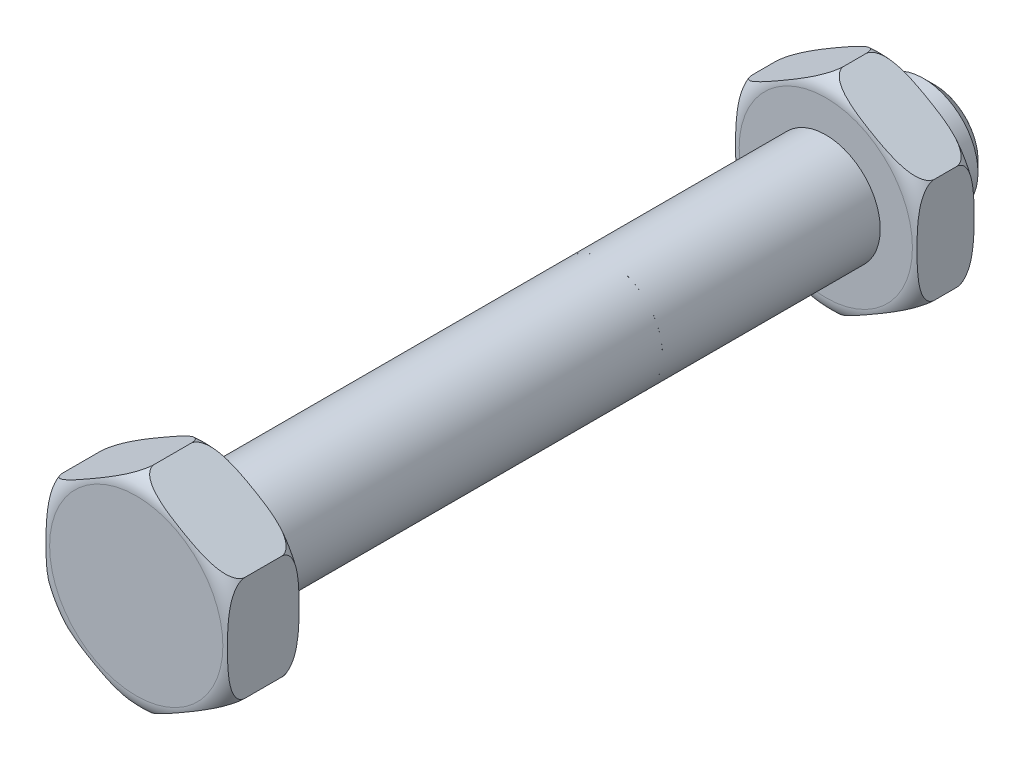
ISO-10303-21;
HEADER;
FILE_DESCRIPTION(('STEP AP214'),'2;1');
FILE_NAME('part.step','',(''),(''),'','','');
FILE_SCHEMA(('AUTOMOTIVE_DESIGN { 1 0 10303 214 1 1 1 1 }'));
ENDSEC;
DATA;
#1=APPLICATION_CONTEXT('core data for automotive mechanical design processes');
#2=APPLICATION_PROTOCOL_DEFINITION('international standard','automotive_design',2000,#1);
#3=PRODUCT_CONTEXT('',#1,'mechanical');
#4=PRODUCT('Part','Part','',(#3));
#5=PRODUCT_RELATED_PRODUCT_CATEGORY('part','',(#4));
#6=PRODUCT_DEFINITION_FORMATION('','',#4);
#7=PRODUCT_DEFINITION_CONTEXT('part definition',#1,'design');
#8=PRODUCT_DEFINITION('design','',#6,#7);
#9=PRODUCT_DEFINITION_SHAPE('','',#8);
#10=(LENGTH_UNIT() NAMED_UNIT(*) SI_UNIT(.MILLI.,.METRE.));
#11=(NAMED_UNIT(*) PLANE_ANGLE_UNIT() SI_UNIT($,.RADIAN.));
#12=(NAMED_UNIT(*) SI_UNIT($,.STERADIAN.) SOLID_ANGLE_UNIT());
#13=UNCERTAINTY_MEASURE_WITH_UNIT(LENGTH_MEASURE(1.E-05),#10,'distance_accuracy_value','');
#14=(GEOMETRIC_REPRESENTATION_CONTEXT(3) GLOBAL_UNCERTAINTY_ASSIGNED_CONTEXT((#13)) GLOBAL_UNIT_ASSIGNED_CONTEXT((#10,
#11,#12)) REPRESENTATION_CONTEXT('',''));
#15=CARTESIAN_POINT('',(0.,0.,0.));
#16=DIRECTION('',(0.,0.,1.));
#17=DIRECTION('',(1.,0.,0.));
#18=AXIS2_PLACEMENT_3D('',#15,#16,#17);
#19=CARTESIAN_POINT('',(0.,-57.,-23.));
#20=DIRECTION('',(0.,0.,1.));
#21=DIRECTION('',(1.,0.,0.));
#22=AXIS2_PLACEMENT_3D('',#19,#20,#21);
#23=PLANE('',#22);
#24=CARTESIAN_POINT('',(0.,-57.,-22.9999999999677));
#25=DIRECTION('',(0.,0.,1.));
#26=DIRECTION('',(1.,0.,0.));
#27=AXIS2_PLACEMENT_3D('',#24,#25,#26);
#28=CIRCLE('',#27,2.3864999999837);
#29=CARTESIAN_POINT('',(2.3864999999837,-57.,-22.9999999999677));
#30=VERTEX_POINT('',#29);
#31=EDGE_CURVE('P0_E346',#30,#30,#28,.T.);
#32=ORIENTED_EDGE('',*,*,#31,.F.);
#33=EDGE_LOOP('',(#32));
#34=FACE_BOUND('',#33,.T.);
#35=ADVANCED_FACE('P0_F16',(#34),#23,.F.);
#36=CARTESIAN_POINT('',(0.,-57.,-22.3864999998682));
#37=DIRECTION('',(0.,0.,1.));
#38=DIRECTION('',(1.,0.,0.));
#39=AXIS2_PLACEMENT_3D('',#36,#37,#38);
#40=CONICAL_SURFACE('',#39,3.00000000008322,0.785398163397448);
#41=CARTESIAN_POINT('',(0.,-57.,-22.3865));
#42=DIRECTION('',(0.,0.,1.));
#43=DIRECTION('',(1.,0.,0.));
#44=AXIS2_PLACEMENT_3D('',#41,#42,#43);
#45=CIRCLE('',#44,3.);
#46=CARTESIAN_POINT('',(3.,-57.,-22.3865));
#47=VERTEX_POINT('',#46);
#48=EDGE_CURVE('P0_E156',#47,#47,#45,.T.);
#49=ORIENTED_EDGE('',*,*,#48,.F.);
#50=EDGE_LOOP('',(#49));
#51=FACE_BOUND('',#50,.T.);
#52=ORIENTED_EDGE('',*,*,#31,.T.);
#53=EDGE_LOOP('',(#52));
#54=FACE_BOUND('',#53,.T.);
#55=ADVANCED_FACE('P0_F863',(#51,#54),#40,.T.);
#56=CARTESIAN_POINT('',(0.,-57.,-25.2));
#57=DIRECTION('',(0.,0.,1.));
#58=DIRECTION('',(1.,0.,0.));
#59=AXIS2_PLACEMENT_3D('',#56,#57,#58);
#60=CYLINDRICAL_SURFACE('',#59,3.);
#61=CARTESIAN_POINT('',(0.,-57.,-20.2));
#62=DIRECTION('',(0.,0.,1.));
#63=DIRECTION('',(1.,0.,0.));
#64=AXIS2_PLACEMENT_3D('',#61,#62,#63);
#65=CIRCLE('',#64,3.);
#66=CARTESIAN_POINT('',(3.,-57.,-20.2));
#67=VERTEX_POINT('',#66);
#68=EDGE_CURVE('P0_E141',#67,#67,#65,.F.);
#69=ORIENTED_EDGE('',*,*,#68,.T.);
#70=EDGE_LOOP('',(#69));
#71=FACE_BOUND('',#70,.T.);
#72=ORIENTED_EDGE('',*,*,#48,.T.);
#73=EDGE_LOOP('',(#72));
#74=FACE_BOUND('',#73,.T.);
#75=ADVANCED_FACE('P0_F855',(#71,#74),#60,.T.);
#76=CARTESIAN_POINT('',(0.,-57.,21.));
#77=DIRECTION('',(0.,0.,1.));
#78=DIRECTION('',(1.,0.,0.));
#79=AXIS2_PLACEMENT_3D('',#76,#77,#78);
#80=PLANE('',#79);
#81=CARTESIAN_POINT('',(0.,-57.,20.9999999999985));
#82=DIRECTION('',(0.,0.,-1.));
#83=DIRECTION('',(1.24943986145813E-07,-0.999999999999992,0.));
#84=AXIS2_PLACEMENT_3D('',#81,#82,#83);
#85=CIRCLE('',#84,4.773500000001);
#86=CARTESIAN_POINT('',(1.78926034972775E-07,-61.7735000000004,20.9999999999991));
#87=VERTEX_POINT('',#86);
#88=CARTESIAN_POINT('',(0.,-52.2264999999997,20.999999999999));
#89=VERTEX_POINT('',#88);
#90=EDGE_CURVE('P0_E134',#87,#89,#85,.T.);
#91=ORIENTED_EDGE('',*,*,#90,.F.);
#92=CARTESIAN_POINT('',(0.,-57.,20.9999999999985));
#93=DIRECTION('',(0.,0.,-1.));
#94=DIRECTION('',(0.,1.,0.));
#95=AXIS2_PLACEMENT_3D('',#92,#93,#94);
#96=CIRCLE('',#95,4.7735);
#97=EDGE_CURVE('P0_E139',#89,#87,#96,.T.);
#98=ORIENTED_EDGE('',*,*,#97,.F.);
#99=EDGE_LOOP('',(#91,#98));
#100=FACE_BOUND('',#99,.T.);
#101=ADVANCED_FACE('P0_F138',(#100),#80,.T.);
#102=CARTESIAN_POINT('',(0.,-57.,-20.2));
#103=DIRECTION('',(0.,0.,1.));
#104=DIRECTION('',(1.,0.,0.));
#105=AXIS2_PLACEMENT_3D('',#102,#103,#104);
#106=PLANE('',#105);
#107=ORIENTED_EDGE('',*,*,#68,.F.);
#108=EDGE_LOOP('',(#107));
#109=FACE_BOUND('',#108,.T.);
#110=CARTESIAN_POINT('',(0.,-57.,-20.1999999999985));
#111=DIRECTION('',(0.,0.,1.));
#112=DIRECTION('',(0.,1.,0.));
#113=AXIS2_PLACEMENT_3D('',#110,#111,#112);
#114=CIRCLE('',#113,4.7735);
#115=CARTESIAN_POINT('',(0.,-52.2264999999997,-20.199999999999));
#116=VERTEX_POINT('',#115);
#117=CARTESIAN_POINT('',(-7.58716326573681E-08,-61.7735000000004,-20.1999999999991));
#118=VERTEX_POINT('',#117);
#119=EDGE_CURVE('P0_E147',#116,#118,#114,.T.);
#120=ORIENTED_EDGE('',*,*,#119,.F.);
#121=CARTESIAN_POINT('',(0.,-57.,-20.1999999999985));
#122=DIRECTION('',(0.,0.,1.));
#123=DIRECTION('',(-3.97358502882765E-08,-0.999999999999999,0.));
#124=AXIS2_PLACEMENT_3D('',#121,#122,#123);
#125=CIRCLE('',#124,4.773500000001);
#126=EDGE_CURVE('P0_E212',#118,#116,#125,.T.);
#127=ORIENTED_EDGE('',*,*,#126,.F.);
#128=EDGE_LOOP('',(#120,#127));
#129=FACE_BOUND('',#128,.T.);
#130=ADVANCED_FACE('P0_F169',(#109,#129),#106,.F.);
#131=CARTESIAN_POINT('',(0.,-57.,20.));
#132=DIRECTION('',(0.,0.,1.));
#133=DIRECTION('',(0.,1.,0.));
#134=AXIS2_PLACEMENT_3D('',#131,#132,#133);
#135=TOROIDAL_SURFACE('',#134,4.773500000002,0.9999999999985);
#136=ORIENTED_EDGE('',*,*,#90,.T.);
#137=ORIENTED_EDGE('',*,*,#97,.T.);
#138=EDGE_LOOP('',(#136,#137));
#139=FACE_BOUND('',#138,.T.);
#140=CARTESIAN_POINT('',(5.,-59.8867459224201,19.9998006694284));
#141=CARTESIAN_POINT('',(5.,-59.886754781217,20.0147158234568));
#142=CARTESIAN_POINT('',(5.,-59.8860898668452,20.0296230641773));
#143=CARTESIAN_POINT('',(5.,-59.8834445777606,20.0593094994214));
#144=CARTESIAN_POINT('',(5.,-59.8814651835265,20.0740887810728));
#145=CARTESIAN_POINT('',(5.,-59.8736487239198,20.1178374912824));
#146=CARTESIAN_POINT('',(4.99999999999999,-59.8659322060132,20.1464880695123));
#147=CARTESIAN_POINT('',(4.99999999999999,-59.8460919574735,20.2020893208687));
#148=CARTESIAN_POINT('',(5.,-59.8339800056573,20.2290443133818));
#149=CARTESIAN_POINT('',(5.,-59.8060773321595,20.2810229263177));
#150=CARTESIAN_POINT('',(4.99999999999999,-59.7902785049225,20.3060421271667));
#151=CARTESIAN_POINT('',(4.99999999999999,-59.7448891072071,20.3690166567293));
#152=CARTESIAN_POINT('',(5.,-59.7128711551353,20.4052194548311));
#153=CARTESIAN_POINT('',(5.,-59.6436175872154,20.4722190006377));
#154=CARTESIAN_POINT('',(5.,-59.6063687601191,20.503001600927));
#155=CARTESIAN_POINT('',(5.,-59.5342202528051,20.555537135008));
#156=CARTESIAN_POINT('',(5.,-59.4997934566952,20.5779521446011));
#157=CARTESIAN_POINT('',(5.,-59.429124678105,20.6197345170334));
#158=CARTESIAN_POINT('',(5.,-59.3928813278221,20.6390995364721));
#159=CARTESIAN_POINT('',(4.99999999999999,-59.2819292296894,20.6933596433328));
#160=CARTESIAN_POINT('',(4.99999999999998,-59.2052573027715,20.7242435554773));
#161=CARTESIAN_POINT('',(4.99999999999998,-59.0712620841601,20.7703446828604));
#162=CARTESIAN_POINT('',(4.99999999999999,-59.0145698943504,20.787524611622));
#163=CARTESIAN_POINT('',(5.00000000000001,-58.9002360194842,20.8184586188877));
#164=CARTESIAN_POINT('',(5.,-58.8425940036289,20.8322114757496));
#165=CARTESIAN_POINT('',(5.,-58.6689498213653,20.8692332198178));
#166=CARTESIAN_POINT('',(5.,-58.5520671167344,20.8883166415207));
#167=CARTESIAN_POINT('',(5.,-58.3166873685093,20.919073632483));
#168=CARTESIAN_POINT('',(5.,-58.1981848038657,20.9307002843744));
#169=CARTESIAN_POINT('',(5.,-57.9608289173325,20.9489133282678));
#170=CARTESIAN_POINT('',(5.00000000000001,-57.8419756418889,20.9555003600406));
#171=CARTESIAN_POINT('',(5.00000000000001,-57.6244158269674,20.9645248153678));
#172=CARTESIAN_POINT('',(5.,-57.525728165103,20.9674781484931));
#173=CARTESIAN_POINT('',(5.,-57.3283220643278,20.9717185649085));
#174=CARTESIAN_POINT('',(5.,-57.2296036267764,20.9730057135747));
#175=CARTESIAN_POINT('',(5.,-57.0325233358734,20.9742146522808));
#176=CARTESIAN_POINT('',(5.00000000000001,-56.9341615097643,20.9741414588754));
#177=CARTESIAN_POINT('',(4.99999999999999,-56.7374492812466,20.9726194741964));
#178=CARTESIAN_POINT('',(4.99999999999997,-56.6390988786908,20.9711707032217));
#179=CARTESIAN_POINT('',(4.99999999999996,-56.4056955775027,20.9657247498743));
#180=CARTESIAN_POINT('',(4.99999999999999,-56.2706586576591,20.9609776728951));
#181=CARTESIAN_POINT('',(5.00000000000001,-56.0004745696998,20.9464760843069));
#182=CARTESIAN_POINT('',(4.99999999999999,-55.8653279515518,20.9367092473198));
#183=CARTESIAN_POINT('',(4.99999999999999,-55.6568118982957,20.9152840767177));
#184=CARTESIAN_POINT('',(5.,-55.583155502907,20.9064805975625));
#185=CARTESIAN_POINT('',(5.,-55.4362975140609,20.8857050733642));
#186=CARTESIAN_POINT('',(5.,-55.3630958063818,20.8737338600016));
#187=CARTESIAN_POINT('',(5.,-55.2176792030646,20.8457835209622));
#188=CARTESIAN_POINT('',(5.,-55.1454619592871,20.8298168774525));
#189=CARTESIAN_POINT('',(5.,-55.0023780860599,20.7927526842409));
#190=CARTESIAN_POINT('',(5.,-54.9315103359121,20.7716596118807));
#191=CARTESIAN_POINT('',(5.,-54.8089667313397,20.7288093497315));
#192=CARTESIAN_POINT('',(5.,-54.7568056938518,20.7084546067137));
#193=CARTESIAN_POINT('',(5.,-54.6544030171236,20.6631339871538));
#194=CARTESIAN_POINT('',(5.,-54.6041639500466,20.6381621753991));
#195=CARTESIAN_POINT('',(5.00000000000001,-54.5063700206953,20.582430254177));
#196=CARTESIAN_POINT('',(5.00000000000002,-54.4588421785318,20.5516218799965));
#197=CARTESIAN_POINT('',(4.99999999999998,-54.3688894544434,20.4832646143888));
#198=CARTESIAN_POINT('',(4.99999999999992,-54.3264514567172,20.4457336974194));
#199=CARTESIAN_POINT('',(4.99999999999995,-54.2642274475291,20.3786316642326));
#200=CARTESIAN_POINT('',(4.99999999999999,-54.2419349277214,20.3513974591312));
#201=CARTESIAN_POINT('',(5.00000000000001,-54.2015797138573,20.2938909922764));
#202=CARTESIAN_POINT('',(5.,-54.1835176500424,20.2636182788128));
#203=CARTESIAN_POINT('',(4.99999999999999,-54.1527057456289,20.1999471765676));
#204=CARTESIAN_POINT('',(5.,-54.1400271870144,20.1665136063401));
#205=CARTESIAN_POINT('',(5.,-54.1216551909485,20.0978341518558));
#206=CARTESIAN_POINT('',(5.00000000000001,-54.1159346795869,20.0625958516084));
#207=CARTESIAN_POINT('',(4.99999999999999,-54.1135065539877,20.0183076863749));
#208=CARTESIAN_POINT('',(4.99999999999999,-54.1132578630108,20.0093894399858));
#209=CARTESIAN_POINT('',(4.99999999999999,-54.1132542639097,20.0004754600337));
#210=B_SPLINE_CURVE_WITH_KNOTS('',3,(#140,#141,#142,#143,#144,#145,#146,#147,#148,#149,#150,
#151,#152,#153,#154,#155,#156,#157,#158,#159,#160,#161,#162,#163,#164,#165,#166,#167,#168,#169,
#170,#171,#172,#173,#174,#175,#176,#177,#178,#179,#180,#181,#182,#183,#184,#185,#186,#187,#188,
#189,#190,#191,#192,#193,#194,#195,#196,#197,#198,#199,#200,#201,#202,#203,#204,#205,#206,#207,
#208,#209),.UNSPECIFIED.,.F.,.F.,(4,2,2,2,2,2,2,2,2,2,2,2,2,2,2,2,2,2,2,2,2,2,2,2,2,2,2,2,2,2,2,
2,2,2,4),(0.,0.0447149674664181,0.089396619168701,0.17796034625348,0.266288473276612,
0.354812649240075,0.498974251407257,0.643506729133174,0.766570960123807,0.889729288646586,
1.13697558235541,1.31460038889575,1.49228842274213,1.84715607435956,2.20423516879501,
2.56126892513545,2.85744942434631,3.15361830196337,3.44869521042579,3.74376776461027,
4.14908408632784,4.55540039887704,4.77789147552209,5.00032419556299,5.22207050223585,
5.44362383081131,5.61143026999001,5.77945394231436,5.94893303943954,6.11796557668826,
6.22324356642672,6.32853723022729,6.43518460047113,6.54141566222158,6.56816748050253),.UNSPECIFIED.);
#211=CARTESIAN_POINT('',(4.99999875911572,-59.8867509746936,19.9998006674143));
#212=VERTEX_POINT('',#211);
#213=CARTESIAN_POINT('',(4.9999982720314,-54.1132483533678,20.0004754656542));
#214=VERTEX_POINT('',#213);
#215=EDGE_CURVE('P0_E241',#212,#214,#210,.T.);
#216=ORIENTED_EDGE('',*,*,#215,.T.);
#217=CARTESIAN_POINT('',(4.99999514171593,-54.1132458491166,20.0004754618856));
#218=CARTESIAN_POINT('',(4.99998537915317,-54.1132402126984,20.0153991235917));
#219=CARTESIAN_POINT('',(4.99939145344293,-54.1128973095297,20.0303139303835));
#220=CARTESIAN_POINT('',(4.99706350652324,-54.111553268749,20.0600134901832));
#221=CARTESIAN_POINT('',(4.99533034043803,-54.1105526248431,20.0747983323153));
#222=CARTESIAN_POINT('',(4.9885039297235,-54.1066113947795,20.1185602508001));
#223=CARTESIAN_POINT('',(4.98178242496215,-54.1027307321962,20.1472155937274));
#224=CARTESIAN_POINT('',(4.96452419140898,-54.0927666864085,20.2028192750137));
#225=CARTESIAN_POINT('',(4.9539977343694,-54.0866892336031,20.2297719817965));
#226=CARTESIAN_POINT('',(4.92976157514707,-54.072696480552,20.2817417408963));
#227=CARTESIAN_POINT('',(4.91604483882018,-54.0647771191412,20.3067543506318));
#228=CARTESIAN_POINT('',(4.87662239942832,-54.0420165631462,20.3697518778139));
#229=CARTESIAN_POINT('',(4.84880957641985,-54.0259588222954,20.4059756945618));
#230=CARTESIAN_POINT('',(4.78866467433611,-53.9912341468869,20.473003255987));
#231=CARTESIAN_POINT('',(4.75632114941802,-53.9725606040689,20.5037928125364));
#232=CARTESIAN_POINT('',(4.69366146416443,-53.9363840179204,20.5563501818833));
#233=CARTESIAN_POINT('',(4.66375306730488,-53.9191163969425,20.5787788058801));
#234=CARTESIAN_POINT('',(4.60236372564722,-53.8836732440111,20.6205793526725));
#235=CARTESIAN_POINT('',(4.57088159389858,-53.8654970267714,20.6399489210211));
#236=CARTESIAN_POINT('',(4.47451047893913,-53.8098571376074,20.6942125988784));
#237=CARTESIAN_POINT('',(4.40792192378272,-53.7714122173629,20.7250851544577));
#238=CARTESIAN_POINT('',(4.2914373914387,-53.7041598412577,20.7712012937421));
#239=CARTESIAN_POINT('',(4.24208414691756,-53.675665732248,20.7884008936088));
#240=CARTESIAN_POINT('',(4.14255410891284,-53.6182020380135,20.819353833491));
#241=CARTESIAN_POINT('',(4.09237702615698,-53.5892322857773,20.8331059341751));
#242=CARTESIAN_POINT('',(3.94122483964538,-53.5019645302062,20.8701046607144));
#243=CARTESIAN_POINT('',(3.83948792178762,-53.4432266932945,20.8891449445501));
#244=CARTESIAN_POINT('',(3.63461795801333,-53.3249449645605,20.9197938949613));
#245=CARTESIAN_POINT('',(3.53148016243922,-53.2653983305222,20.9313554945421));
#246=CARTESIAN_POINT('',(3.32490523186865,-53.1461322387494,20.9494359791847));
#247=CARTESIAN_POINT('',(3.22146813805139,-53.0864128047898,20.9559555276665));
#248=CARTESIAN_POINT('',(3.03277495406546,-52.9774707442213,20.9648302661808));
#249=CARTESIAN_POINT('',(2.94753538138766,-52.9282576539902,20.9677176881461));
#250=CARTESIAN_POINT('',(2.77703054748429,-52.8298166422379,20.9718482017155));
#251=CARTESIAN_POINT('',(2.69176528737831,-52.7805887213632,20.9730913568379));
#252=CARTESIAN_POINT('',(2.52154310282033,-52.6823108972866,20.9742232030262));
#253=CARTESIAN_POINT('',(2.43658620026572,-52.6332610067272,20.9741168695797));
#254=CARTESIAN_POINT('',(2.26668265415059,-52.5351671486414,20.9725315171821));
#255=CARTESIAN_POINT('',(2.18173601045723,-52.4861231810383,20.97105251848));
#256=CARTESIAN_POINT('',(1.98010043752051,-52.3697088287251,20.9655316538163));
#257=CARTESIAN_POINT('',(1.86342560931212,-52.3023465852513,20.9607379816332));
#258=CARTESIAN_POINT('',(1.62998230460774,-52.1675680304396,20.9461332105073));
#259=CARTESIAN_POINT('',(1.51321431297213,-52.1001519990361,20.9363097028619));
#260=CARTESIAN_POINT('',(1.33298551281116,-51.9960968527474,20.9147840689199));
#261=CARTESIAN_POINT('',(1.26927461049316,-51.9593133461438,20.9059357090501));
#262=CARTESIAN_POINT('',(1.1422499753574,-51.8859756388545,20.8850626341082));
#263=CARTESIAN_POINT('',(1.07893614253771,-51.8494213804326,20.87303875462));
#264=CARTESIAN_POINT('',(0.953168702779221,-51.7768095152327,20.8449745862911));
#265=CARTESIAN_POINT('',(0.890713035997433,-51.7407507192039,20.8289468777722));
#266=CARTESIAN_POINT('',(0.766979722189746,-51.6693132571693,20.7917518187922));
#267=CARTESIAN_POINT('',(0.705701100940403,-51.6339340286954,20.7705889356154));
#268=CARTESIAN_POINT('',(0.599754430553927,-51.572765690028,20.7276058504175));
#269=CARTESIAN_POINT('',(0.554664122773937,-51.5467327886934,20.707191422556));
#270=CARTESIAN_POINT('',(0.466166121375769,-51.4956384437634,20.6617538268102));
#271=CARTESIAN_POINT('',(0.422760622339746,-51.4705782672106,20.6367248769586));
#272=CARTESIAN_POINT('',(0.338259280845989,-51.4217913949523,20.5808461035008));
#273=CARTESIAN_POINT('',(0.297186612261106,-51.3980780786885,20.5499478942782));
#274=CARTESIAN_POINT('',(0.23896341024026,-51.3644628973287,20.4985904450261));
#275=CARTESIAN_POINT('',(0.220137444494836,-51.3535937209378,20.4806570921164));
#276=CARTESIAN_POINT('',(0.183870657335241,-51.3326550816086,20.4429540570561));
#277=CARTESIAN_POINT('',(0.166431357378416,-51.3225864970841,20.4231824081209));
#278=CARTESIAN_POINT('',(0.129295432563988,-51.3011460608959,20.3766545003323));
#279=CARTESIAN_POINT('',(0.110085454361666,-51.2900551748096,20.3493707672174));
#280=CARTESIAN_POINT('',(0.0753911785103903,-51.2700244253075,20.2918454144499));
#281=CARTESIAN_POINT('',(0.0598981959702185,-51.2610795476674,20.261610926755));
#282=CARTESIAN_POINT('',(0.0355451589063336,-51.247019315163,20.2029743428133));
#283=CARTESIAN_POINT('',(0.0260549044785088,-51.2415401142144,20.1749238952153));
#284=CARTESIAN_POINT('',(0.0112624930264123,-51.2329997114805,20.1174052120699));
#285=CARTESIAN_POINT('',(0.00595068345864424,-51.2299329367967,20.0879404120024));
#286=CARTESIAN_POINT('',(0.00202487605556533,-51.2276663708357,20.0491358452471));
#287=CARTESIAN_POINT('',(0.001321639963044,-51.2272603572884,20.0400415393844));
#288=CARTESIAN_POINT('',(0.000345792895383,-51.2266969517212,20.0218279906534));
#289=CARTESIAN_POINT('',(7.29082095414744E-05,-51.2265394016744,20.0127087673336));
#290=CARTESIAN_POINT('',(1.57866408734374E-05,-51.2265064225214,20.0035839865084));
#291=B_SPLINE_CURVE_WITH_KNOTS('',3,(#217,#218,#219,#220,#221,#222,#223,#224,#225,#226,#227,
#228,#229,#230,#231,#232,#233,#234,#235,#236,#237,#238,#239,#240,#241,#242,#243,#244,#245,#246,
#247,#248,#249,#250,#251,#252,#253,#254,#255,#256,#257,#258,#259,#260,#261,#262,#263,#264,#265,
#266,#267,#268,#269,#270,#271,#272,#273,#274,#275,#276,#277,#278,#279,#280,#281,#282,#283,#284,
#285,#286,#287,#288,#289,#290),.UNSPECIFIED.,.F.,.F.,(4,2,2,2,2,2,2,2,2,2,2,2,2,2,2,2,2,2,2,2,2,
2,2,2,2,2,2,2,2,2,2,2,2,2,2,2,4),(0.,0.0447404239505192,0.0894473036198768,0.178059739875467,
0.266434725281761,0.355006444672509,0.49940770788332,0.644180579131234,0.767539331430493,
0.890992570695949,1.13883192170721,1.31732306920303,1.49587829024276,1.85247967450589,
2.21130403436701,2.57008117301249,2.86547223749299,3.16085189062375,3.45514281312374,
3.74942939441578,4.1538135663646,4.55920020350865,4.78144068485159,5.00362274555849,
5.22511528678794,5.44641582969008,5.61401322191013,5.78182205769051,5.95107956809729,
6.03553635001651,6.12008455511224,6.22525126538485,6.33016980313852,6.42015578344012,
6.509933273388,6.53731487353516,6.56467905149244),.UNSPECIFIED.);
#292=CARTESIAN_POINT('',(8.72722038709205E-08,-51.2265021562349,20.0035840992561));
#293=VERTEX_POINT('',#292);
#294=EDGE_CURVE('P0_E252',#214,#293,#291,.T.);
#295=ORIENTED_EDGE('',*,*,#294,.T.);
#296=CARTESIAN_POINT('',(-1.57866311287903E-05,-51.2265064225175,20.0035839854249));
#297=CARTESIAN_POINT('',(-0.000106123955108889,-51.2265585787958,20.018547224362));
#298=CARTESIAN_POINT('',(-0.000783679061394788,-51.2269497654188,20.0334972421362));
#299=CARTESIAN_POINT('',(-0.00328293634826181,-51.2283927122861,20.0632579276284));
#300=CARTESIAN_POINT('',(-0.00510375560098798,-51.2294439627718,20.0780686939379));
#301=CARTESIAN_POINT('',(-0.0121944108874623,-51.2335377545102,20.1218923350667));
#302=CARTESIAN_POINT('',(-0.0190953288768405,-51.2375220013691,20.1505701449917));
#303=CARTESIAN_POINT('',(-0.0367053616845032,-51.247689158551,20.2061859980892));
#304=CARTESIAN_POINT('',(-0.0474038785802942,-51.2538659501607,20.2331286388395));
#305=CARTESIAN_POINT('',(-0.0719719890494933,-51.2680503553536,20.2850585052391));
#306=CARTESIAN_POINT('',(-0.0858486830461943,-51.276062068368,20.3100411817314));
#307=CARTESIAN_POINT('',(-0.125800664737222,-51.299128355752,20.3731457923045));
#308=CARTESIAN_POINT('',(-0.154005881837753,-51.3154126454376,20.409466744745));
#309=CARTESIAN_POINT('',(-0.214938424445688,-51.3505920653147,20.4766234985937));
#310=CARTESIAN_POINT('',(-0.247677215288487,-51.3694938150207,20.5074449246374));
#311=CARTESIAN_POINT('',(-0.311161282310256,-51.406146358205,20.5601027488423));
#312=CARTESIAN_POINT('',(-0.341506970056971,-51.4236664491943,20.5825939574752));
#313=CARTESIAN_POINT('',(-0.403773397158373,-51.4596159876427,20.6244775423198));
#314=CARTESIAN_POINT('',(-0.435695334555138,-51.4780461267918,20.6438675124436));
#315=CARTESIAN_POINT('',(-0.533387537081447,-51.5344487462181,20.6981455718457));
#316=CARTESIAN_POINT('',(-0.600854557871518,-51.5734008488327,20.7289638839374));
#317=CARTESIAN_POINT('',(-0.71940960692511,-51.6418486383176,20.7751500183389));
#318=CARTESIAN_POINT('',(-0.7699728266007,-51.6710413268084,20.7924410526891));
#319=CARTESIAN_POINT('',(-0.871928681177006,-51.7299055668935,20.8234802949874));
#320=CARTESIAN_POINT('',(-0.923321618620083,-51.7595772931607,20.8372271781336));
#321=CARTESIAN_POINT('',(-1.07811667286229,-51.8489482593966,20.8741127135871));
#322=CARTESIAN_POINT('',(-1.18227688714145,-51.9090851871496,20.892946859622));
#323=CARTESIAN_POINT('',(-1.39198430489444,-52.0301598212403,20.9230836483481));
#324=CARTESIAN_POINT('',(-1.49753610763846,-52.091100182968,20.9343385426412));
#325=CARTESIAN_POINT('',(-1.70891849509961,-52.2131418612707,20.951796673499));
#326=CARTESIAN_POINT('',(-1.81474903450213,-52.2742431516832,20.9580006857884));
#327=CARTESIAN_POINT('',(-2.00486715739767,-52.3840079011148,20.9661930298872));
#328=CARTESIAN_POINT('',(-2.08913783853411,-52.4326616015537,20.9687837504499));
#329=CARTESIAN_POINT('',(-2.25770079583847,-52.5299814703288,20.9724151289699));
#330=CARTESIAN_POINT('',(-2.34199307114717,-52.5786476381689,20.9734558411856));
#331=CARTESIAN_POINT('',(-2.51027156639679,-52.6758032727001,20.9742275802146));
#332=CARTESIAN_POINT('',(-2.59425777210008,-52.7242927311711,20.9739634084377));
#333=CARTESIAN_POINT('',(-2.76221805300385,-52.821264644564,20.9720703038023));
#334=CARTESIAN_POINT('',(-2.84619212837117,-52.8697470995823,20.970441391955));
#335=CARTESIAN_POINT('',(-3.04543081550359,-52.9847776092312,20.9645494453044));
#336=CARTESIAN_POINT('',(-3.16068009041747,-53.0513168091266,20.9595303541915));
#337=CARTESIAN_POINT('',(-3.39126179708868,-53.1844432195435,20.9444364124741));
#338=CARTESIAN_POINT('',(-3.50659370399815,-53.2510301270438,20.9343488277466));
#339=CARTESIAN_POINT('',(-3.68494160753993,-53.3539993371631,20.9123675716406));
#340=CARTESIAN_POINT('',(-3.74821471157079,-53.3905300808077,20.9033146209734));
#341=CARTESIAN_POINT('',(-3.87434885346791,-53.4633536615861,20.8820027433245));
#342=CARTESIAN_POINT('',(-3.9372099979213,-53.4996465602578,20.8697446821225));
#343=CARTESIAN_POINT('',(-4.06204708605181,-53.5717212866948,20.8411833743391));
#344=CARTESIAN_POINT('',(-4.1240252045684,-53.6075043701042,20.8248930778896));
#345=CARTESIAN_POINT('',(-4.24676940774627,-53.6783707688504,20.7871432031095));
#346=CARTESIAN_POINT('',(-4.30753652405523,-53.7134546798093,20.7656882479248));
#347=CARTESIAN_POINT('',(-4.41228724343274,-53.7739325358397,20.7222700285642));
#348=CARTESIAN_POINT('',(-4.45671077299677,-53.7995804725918,20.7017398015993));
#349=CARTESIAN_POINT('',(-4.54385478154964,-53.8498930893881,20.6561105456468));
#350=CARTESIAN_POINT('',(-4.58657305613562,-53.8745564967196,20.6310058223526));
#351=CARTESIAN_POINT('',(-4.66967517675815,-53.9225355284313,20.575036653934));
#352=CARTESIAN_POINT('',(-4.71003559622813,-53.9458376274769,20.5441242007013));
#353=CARTESIAN_POINT('',(-4.76718296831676,-53.9788316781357,20.4928210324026));
#354=CARTESIAN_POINT('',(-4.78564957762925,-53.9894933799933,20.4749181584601));
#355=CARTESIAN_POINT('',(-4.82119751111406,-54.0100169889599,20.4373080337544));
#356=CARTESIAN_POINT('',(-4.83827730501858,-54.0198780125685,20.4175988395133));
#357=CARTESIAN_POINT('',(-4.87473558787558,-54.0409272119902,20.3710990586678));
#358=CARTESIAN_POINT('',(-4.89361222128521,-54.0518256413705,20.3437739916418));
#359=CARTESIAN_POINT('',(-4.92761784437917,-54.0714587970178,20.2862096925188));
#360=CARTESIAN_POINT('',(-4.9427555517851,-54.0801985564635,20.2559774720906));
#361=CARTESIAN_POINT('',(-4.96646209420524,-54.0938855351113,20.1973539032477));
#362=CARTESIAN_POINT('',(-4.9756554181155,-54.0991933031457,20.1693018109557));
#363=CARTESIAN_POINT('',(-4.98985063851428,-54.1073889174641,20.111835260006));
#364=CARTESIAN_POINT('',(-4.99486208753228,-54.1102822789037,20.0824240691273));
#365=CARTESIAN_POINT('',(-4.99838790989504,-54.1123179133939,20.043971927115));
#366=CARTESIAN_POINT('',(-4.99899293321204,-54.1126672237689,20.0351494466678));
#367=CARTESIAN_POINT('',(-4.99979776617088,-54.1131318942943,20.0174860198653));
#368=CARTESIAN_POINT('',(-4.99999785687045,-54.1132474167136,20.0086450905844));
#369=CARTESIAN_POINT('',(-4.9999953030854,-54.1132459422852,19.999800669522));
#370=B_SPLINE_CURVE_WITH_KNOTS('',3,(#296,#297,#298,#299,#300,#301,#302,#303,#304,#305,#306,
#307,#308,#309,#310,#311,#312,#313,#314,#315,#316,#317,#318,#319,#320,#321,#322,#323,#324,#325,
#326,#327,#328,#329,#330,#331,#332,#333,#334,#335,#336,#337,#338,#339,#340,#341,#342,#343,#344,
#345,#346,#347,#348,#349,#350,#351,#352,#353,#354,#355,#356,#357,#358,#359,#360,#361,#362,#363,
#364,#365,#366,#367,#368,#369),.UNSPECIFIED.,.F.,.F.,(4,2,2,2,2,2,2,2,2,2,2,2,2,2,2,2,2,2,2,2,2,
2,2,2,2,2,2,2,2,2,2,2,2,2,2,2,4),(0.,0.0448599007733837,0.0896851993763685,0.178526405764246,
0.267121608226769,0.355916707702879,0.501433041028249,0.64732434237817,0.772055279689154,
0.896882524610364,1.14748498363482,1.33006670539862,1.5127165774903,1.8775045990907,
2.24456976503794,2.61157854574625,2.90359185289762,3.19559493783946,3.486524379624,
3.77744934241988,4.17692157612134,4.5774025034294,4.79821053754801,5.01895898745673,
5.23900746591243,5.45885969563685,5.62443734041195,5.79022252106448,5.95744376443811,
6.04088573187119,6.12441855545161,6.22895513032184,6.33324561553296,6.42286595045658,
6.51228100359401,6.53882247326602,6.56534551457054),.UNSPECIFIED.);
#371=CARTESIAN_POINT('',(-4.99999875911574,-54.1132490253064,19.9998006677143));
#372=VERTEX_POINT('',#371);
#373=EDGE_CURVE('P0_E235',#293,#372,#370,.T.);
#374=ORIENTED_EDGE('',*,*,#373,.T.);
#375=CARTESIAN_POINT('',(-5.,-54.1132540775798,19.9998006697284));
#376=CARTESIAN_POINT('',(-5.,-54.1132452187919,20.0147158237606));
#377=CARTESIAN_POINT('',(-5.,-54.1139101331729,20.0296230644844));
#378=CARTESIAN_POINT('',(-5.,-54.1165554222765,20.0593094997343));
#379=CARTESIAN_POINT('',(-5.,-54.1185348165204,20.0740887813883));
#380=CARTESIAN_POINT('',(-5.,-54.1263512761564,20.1178374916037));
#381=CARTESIAN_POINT('',(-5.,-54.1340677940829,20.1464880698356));
#382=CARTESIAN_POINT('',(-5.,-54.1539080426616,20.2020893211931));
#383=CARTESIAN_POINT('',(-5.,-54.1660199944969,20.2290443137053));
#384=CARTESIAN_POINT('',(-5.,-54.1939226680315,20.2810229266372));
#385=CARTESIAN_POINT('',(-5.,-54.2097214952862,20.3060421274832));
#386=CARTESIAN_POINT('',(-4.99999999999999,-54.2551108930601,20.369016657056));
#387=CARTESIAN_POINT('',(-5.,-54.2871288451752,20.4052194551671));
#388=CARTESIAN_POINT('',(-5.,-54.356382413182,20.4722190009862));
#389=CARTESIAN_POINT('',(-5.,-54.3936312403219,20.5030016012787));
#390=CARTESIAN_POINT('',(-5.,-54.4657797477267,20.5555371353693));
#391=CARTESIAN_POINT('',(-5.,-54.5002065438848,20.5779521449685));
#392=CARTESIAN_POINT('',(-5.,-54.5708753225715,20.6197345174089));
#393=CARTESIAN_POINT('',(-5.,-54.6071186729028,20.6390995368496));
#394=CARTESIAN_POINT('',(-5.,-54.7180707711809,20.6933596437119));
#395=CARTESIAN_POINT('',(-4.99999999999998,-54.7947426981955,20.7242435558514));
#396=CARTESIAN_POINT('',(-4.99999999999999,-54.9287379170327,20.7703446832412));
#397=CARTESIAN_POINT('',(-5.,-54.9854301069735,20.7875246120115));
#398=CARTESIAN_POINT('',(-5.,-55.0997639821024,20.8184586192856));
#399=CARTESIAN_POINT('',(-5.,-55.1574059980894,20.8322114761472));
#400=CARTESIAN_POINT('',(-5.,-55.3310501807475,20.8692332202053));
#401=CARTESIAN_POINT('',(-5.,-55.447932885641,20.8883166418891));
#402=CARTESIAN_POINT('',(-5.,-55.68331263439,20.9190736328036));
#403=CARTESIAN_POINT('',(-5.,-55.8018151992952,20.9307002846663));
#404=CARTESIAN_POINT('',(-5.,-56.039171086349,20.9489133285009));
#405=CARTESIAN_POINT('',(-5.00000000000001,-56.1580243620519,20.9555003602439));
#406=CARTESIAN_POINT('',(-5.00000000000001,-56.3755841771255,20.9645248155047));
#407=CARTESIAN_POINT('',(-5.,-56.4742718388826,20.9674781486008));
#408=CARTESIAN_POINT('',(-5.,-56.6716779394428,20.9717185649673));
#409=CARTESIAN_POINT('',(-5.,-56.7703963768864,20.9730057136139));
#410=CARTESIAN_POINT('',(-5.,-56.9674766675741,20.9742146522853));
#411=CARTESIAN_POINT('',(-5.00000000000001,-57.0658384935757,20.9741414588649));
#412=CARTESIAN_POINT('',(-4.99999999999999,-57.2625507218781,20.9726194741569));
#413=CARTESIAN_POINT('',(-4.99999999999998,-57.3609011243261,20.9711707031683));
#414=CARTESIAN_POINT('',(-4.99999999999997,-57.5943044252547,20.9657247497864));
#415=CARTESIAN_POINT('',(-5.,-57.7293413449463,20.9609776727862));
#416=CARTESIAN_POINT('',(-5.,-57.9995254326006,20.9464760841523));
#417=CARTESIAN_POINT('',(-4.99999999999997,-58.1346720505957,20.9367092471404));
#418=CARTESIAN_POINT('',(-4.99999999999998,-58.3431881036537,20.915284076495));
#419=CARTESIAN_POINT('',(-5.,-58.4168444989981,20.9064805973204));
#420=CARTESIAN_POINT('',(-5.,-58.563702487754,20.88570507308));
#421=CARTESIAN_POINT('',(-5.,-58.6369041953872,20.8737338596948));
#422=CARTESIAN_POINT('',(-5.,-58.7823207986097,20.8457835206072));
#423=CARTESIAN_POINT('',(-5.,-58.8545380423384,20.8298168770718));
#424=CARTESIAN_POINT('',(-5.,-58.9976219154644,20.7927526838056));
#425=CARTESIAN_POINT('',(-5.,-59.0684896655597,20.7716596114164));
#426=CARTESIAN_POINT('',(-5.,-59.19103327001,20.7288093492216));
#427=CARTESIAN_POINT('',(-5.,-59.2431943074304,20.7084546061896));
#428=CARTESIAN_POINT('',(-5.,-59.3455969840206,20.663133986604));
#429=CARTESIAN_POINT('',(-5.,-59.3958360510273,20.6381621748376));
#430=CARTESIAN_POINT('',(-5.00000000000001,-59.4936299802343,20.5824302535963));
#431=CARTESIAN_POINT('',(-5.00000000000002,-59.5411578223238,20.551621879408));
#432=CARTESIAN_POINT('',(-4.99999999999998,-59.6311105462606,20.4832646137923));
#433=CARTESIAN_POINT('',(-4.99999999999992,-59.6735485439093,20.4457336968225));
#434=CARTESIAN_POINT('',(-4.99999999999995,-59.7357725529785,20.3786316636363));
#435=CARTESIAN_POINT('',(-4.99999999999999,-59.7580650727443,20.3513974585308));
#436=CARTESIAN_POINT('',(-5.00000000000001,-59.7984202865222,20.2938909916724));
#437=CARTESIAN_POINT('',(-5.,-59.8164823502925,20.2636182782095));
#438=CARTESIAN_POINT('',(-5.,-59.8472942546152,20.1999471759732));
#439=CARTESIAN_POINT('',(-5.,-59.8599728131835,20.1665136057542));
#440=CARTESIAN_POINT('',(-5.,-59.8783448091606,20.0978341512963));
#441=CARTESIAN_POINT('',(-5.,-59.8840653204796,20.0625958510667));
#442=CARTESIAN_POINT('',(-4.99999999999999,-59.8864934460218,20.0183076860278));
#443=CARTESIAN_POINT('',(-4.99999999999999,-59.8867421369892,20.0093894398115));
#444=CARTESIAN_POINT('',(-4.99999999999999,-59.8867457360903,20.000475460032));
#445=B_SPLINE_CURVE_WITH_KNOTS('',3,(#375,#376,#377,#378,#379,#380,#381,#382,#383,#384,#385,
#386,#387,#388,#389,#390,#391,#392,#393,#394,#395,#396,#397,#398,#399,#400,#401,#402,#403,#404,
#405,#406,#407,#408,#409,#410,#411,#412,#413,#414,#415,#416,#417,#418,#419,#420,#421,#422,#423,
#424,#425,#426,#427,#428,#429,#430,#431,#432,#433,#434,#435,#436,#437,#438,#439,#440,#441,#442,
#443,#444),.UNSPECIFIED.,.F.,.F.,(4,2,2,2,2,2,2,2,2,2,2,2,2,2,2,2,2,2,2,2,2,2,2,2,2,2,2,2,2,2,2,
2,2,2,4),(0.,0.0447149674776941,0.0893966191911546,0.177960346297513,0.266288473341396,
0.354812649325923,0.498974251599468,0.643506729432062,0.766570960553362,0.889729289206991,
1.13697558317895,1.31460039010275,1.49228842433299,1.84715607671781,2.2042351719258,
2.56126892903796,2.85744942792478,3.1536183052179,3.44869521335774,3.74376776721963,
4.14908408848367,4.5554004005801,4.77789147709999,5.00032419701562,5.22207050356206,
5.44362383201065,5.61143027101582,5.77945394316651,5.94893304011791,6.11796557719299,
6.22324356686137,6.32853723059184,6.43518460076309,6.54141566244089,6.56816748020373),.UNSPECIFIED.);
#446=CARTESIAN_POINT('',(-4.9999985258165,-59.886751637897,20.0004754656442));
#447=VERTEX_POINT('',#446);
#448=EDGE_CURVE('P0_E236',#372,#447,#445,.T.);
#449=ORIENTED_EDGE('',*,*,#448,.T.);
#450=CARTESIAN_POINT('',(-4.99999514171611,-59.8867541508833,20.0004754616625));
#451=CARTESIAN_POINT('',(-4.99998537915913,-59.8867597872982,20.0153991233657));
#452=CARTESIAN_POINT('',(-4.99939145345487,-59.8871026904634,20.030313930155));
#453=CARTESIAN_POINT('',(-4.99706350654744,-59.8884467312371,20.0600134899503));
#454=CARTESIAN_POINT('',(-4.99533034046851,-59.8894473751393,20.0747983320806));
#455=CARTESIAN_POINT('',(-4.9885039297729,-59.893388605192,20.1185602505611));
#456=CARTESIAN_POINT('',(-4.98178242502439,-59.8972692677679,20.1472155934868));
#457=CARTESIAN_POINT('',(-4.96452419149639,-59.907233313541,20.2028192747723));
#458=CARTESIAN_POINT('',(-4.95399773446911,-59.9133107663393,20.2297719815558));
#459=CARTESIAN_POINT('',(-4.92976157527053,-59.9273035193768,20.2817417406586));
#460=CARTESIAN_POINT('',(-4.91604483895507,-59.9352228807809,20.3067543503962));
#461=CARTESIAN_POINT('',(-4.87662239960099,-59.9579834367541,20.3697518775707));
#462=CARTESIAN_POINT('',(-4.84880957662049,-59.9740411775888,20.4059756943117));
#463=CARTESIAN_POINT('',(-4.78866467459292,-60.0087658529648,20.4730032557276));
#464=CARTESIAN_POINT('',(-4.756321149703,-60.0274393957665,20.5037928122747));
#465=CARTESIAN_POINT('',(-4.69366146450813,-60.0636159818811,20.5563501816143));
#466=CARTESIAN_POINT('',(-4.66375306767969,-60.0808836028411,20.5787788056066));
#467=CARTESIAN_POINT('',(-4.60236372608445,-60.1163267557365,20.620579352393));
#468=CARTESIAN_POINT('',(-4.57088159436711,-60.1345029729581,20.6399489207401));
#469=CARTESIAN_POINT('',(-4.47451047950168,-60.1901428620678,20.6942125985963));
#470=CARTESIAN_POINT('',(-4.4079219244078,-60.2285877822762,20.7250851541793));
#471=CARTESIAN_POINT('',(-4.29143739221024,-60.2958401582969,20.7712012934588));
#472=CARTESIAN_POINT('',(-4.24208414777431,-60.3243342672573,20.7884008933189));
#473=CARTESIAN_POINT('',(-4.14255410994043,-60.3817979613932,20.8193538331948));
#474=CARTESIAN_POINT('',(-4.09237702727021,-60.41076771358,20.8331059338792));
#475=CARTESIAN_POINT('',(-3.94122484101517,-60.4980354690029,20.8701046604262));
#476=CARTESIAN_POINT('',(-3.83948792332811,-60.5567733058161,20.8891449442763));
#477=CARTESIAN_POINT('',(-3.63461795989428,-60.6750550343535,20.9197938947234));
#478=CARTESIAN_POINT('',(-3.53148016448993,-60.7346016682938,20.9313554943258));
#479=CARTESIAN_POINT('',(-3.3249052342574,-60.8538677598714,20.9494359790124));
#480=CARTESIAN_POINT('',(-3.22146814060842,-60.9135871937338,20.9559555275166));
#481=CARTESIAN_POINT('',(-3.03277495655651,-61.0225292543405,20.9648302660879));
#482=CARTESIAN_POINT('',(-2.94753538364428,-61.071742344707,20.9677176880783));
#483=CARTESIAN_POINT('',(-2.77703054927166,-61.1701833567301,20.9718482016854));
#484=CARTESIAN_POINT('',(-2.69176528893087,-61.2194112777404,20.9730913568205));
#485=CARTESIAN_POINT('',(-2.52154310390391,-61.3176891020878,20.9742232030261));
#486=CARTESIAN_POINT('',(-2.43658620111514,-61.3667389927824,20.9741168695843));
#487=CARTESIAN_POINT('',(-2.26668265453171,-61.4648328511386,20.972531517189));
#488=CARTESIAN_POINT('',(-2.1817360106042,-61.5138768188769,20.9710525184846));
#489=CARTESIAN_POINT('',(-1.98010043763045,-61.6302911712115,20.9655316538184));
#490=CARTESIAN_POINT('',(-1.86342560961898,-61.6976534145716,20.9607379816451));
#491=CARTESIAN_POINT('',(-1.62998230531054,-61.8324319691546,20.9461332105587));
#492=CARTESIAN_POINT('',(-1.51321431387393,-61.8998480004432,20.9363097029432));
#493=CARTESIAN_POINT('',(-1.33298551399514,-62.003903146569,20.9147840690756));
#494=CARTESIAN_POINT('',(-1.26927461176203,-62.0406866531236,20.9059357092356));
#495=CARTESIAN_POINT('',(-1.1422499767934,-62.1140243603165,20.8850626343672));
#496=CARTESIAN_POINT('',(-1.07893614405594,-62.1505786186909,20.8730387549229));
#497=CARTESIAN_POINT('',(-0.953168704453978,-62.2231904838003,20.8449745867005));
#498=CARTESIAN_POINT('',(-0.890713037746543,-62.2592492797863,20.8289468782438));
#499=CARTESIAN_POINT('',(-0.766979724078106,-62.3306867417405,20.791751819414));
#500=CARTESIAN_POINT('',(-0.705701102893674,-62.3660659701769,20.7705889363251));
#501=CARTESIAN_POINT('',(-0.599754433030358,-62.4272343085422,20.7276058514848));
#502=CARTESIAN_POINT('',(-0.554664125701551,-62.4532672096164,20.7071914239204));
#503=CARTESIAN_POINT('',(-0.466166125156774,-62.5043615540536,20.6617538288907));
#504=CARTESIAN_POINT('',(-0.422760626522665,-62.5294217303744,20.6367248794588));
#505=CARTESIAN_POINT('',(-0.33825928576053,-62.5782086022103,20.5808461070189));
#506=CARTESIAN_POINT('',(-0.297186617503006,-62.6019219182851,20.5499478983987));
#507=CARTESIAN_POINT('',(-0.238963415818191,-62.6355370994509,20.4985904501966));
#508=CARTESIAN_POINT('',(-0.220137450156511,-62.6464062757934,20.4806570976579));
#509=CARTESIAN_POINT('',(-0.183870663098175,-62.6673449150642,20.4429540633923));
#510=CARTESIAN_POINT('',(-0.166431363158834,-62.6774134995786,20.4231824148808));
#511=CARTESIAN_POINT('',(-0.129295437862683,-62.6988539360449,20.3766545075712));
#512=CARTESIAN_POINT('',(-0.110085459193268,-62.7099448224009,20.3493707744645));
#513=CARTESIAN_POINT('',(-0.0753911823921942,-62.7299755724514,20.2918454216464));
#514=CARTESIAN_POINT('',(-0.0598981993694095,-62.7389204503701,20.2616109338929));
#515=CARTESIAN_POINT('',(-0.0355451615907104,-62.7529806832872,20.2029743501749));
#516=CARTESIAN_POINT('',(-0.0260549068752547,-62.7584598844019,20.1749239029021));
#517=CARTESIAN_POINT('',(-0.0112624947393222,-62.7670002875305,20.1174052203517));
#518=CARTESIAN_POINT('',(-0.00595068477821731,-62.7700670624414,20.0879404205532));
#519=CARTESIAN_POINT('',(-0.00202487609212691,-62.7723336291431,20.0491358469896));
#520=CARTESIAN_POINT('',(-0.00132163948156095,-62.7727396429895,20.0400415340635));
#521=CARTESIAN_POINT('',(-0.000345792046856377,-62.7733030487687,20.0218279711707));
#522=CARTESIAN_POINT('',(-7.29075117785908E-05,-62.7734605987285,20.0127087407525));
#523=CARTESIAN_POINT('',(-1.57864318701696E-05,-62.7734935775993,20.0035839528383));
#524=B_SPLINE_CURVE_WITH_KNOTS('',3,(#450,#451,#452,#453,#454,#455,#456,#457,#458,#459,#460,
#461,#462,#463,#464,#465,#466,#467,#468,#469,#470,#471,#472,#473,#474,#475,#476,#477,#478,#479,
#480,#481,#482,#483,#484,#485,#486,#487,#488,#489,#490,#491,#492,#493,#494,#495,#496,#497,#498,
#499,#500,#501,#502,#503,#504,#505,#506,#507,#508,#509,#510,#511,#512,#513,#514,#515,#516,#517,
#518,#519,#520,#521,#522,#523),.UNSPECIFIED.,.F.,.F.,(4,2,2,2,2,2,2,2,2,2,2,2,2,2,2,2,2,2,2,2,2,
2,2,2,2,2,2,2,2,2,2,2,2,2,2,2,4),(0.,0.0447404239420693,0.0894473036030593,0.178059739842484,
0.266434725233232,0.3550064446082,0.499407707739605,0.644180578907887,0.767539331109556,
0.890992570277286,1.13883192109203,1.31732306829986,1.49587828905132,1.8524796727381,
2.21130403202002,2.57008117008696,2.86547223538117,3.16085188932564,3.45514281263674,
3.74942939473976,4.15381356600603,4.55920020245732,4.78144068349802,5.00362274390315,
5.22511528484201,5.44641582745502,5.61401321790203,5.78182205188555,5.95107956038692,
6.03553634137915,6.12008454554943,6.2252512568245,6.33016979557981,6.42015577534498,
6.50993326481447,6.53731488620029,6.56467908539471),.UNSPECIFIED.);
#525=CARTESIAN_POINT('',(1.86355589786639E-07,-62.7734979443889,20.0035840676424));
#526=VERTEX_POINT('',#525);
#527=EDGE_CURVE('P0_E332',#447,#526,#524,.T.);
#528=ORIENTED_EDGE('',*,*,#527,.T.);
#529=CARTESIAN_POINT('',(1.57864432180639E-05,-62.773493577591,20.0035839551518));
#530=CARTESIAN_POINT('',(0.000106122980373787,-62.773441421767,20.0185471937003));
#531=CARTESIAN_POINT('',(0.00078367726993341,-62.7730502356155,20.0334972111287));
#532=CARTESIAN_POINT('',(0.00328293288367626,-62.7716072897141,20.0632578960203));
#533=CARTESIAN_POINT('',(0.00510375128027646,-62.7705560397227,20.0780686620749));
#534=CARTESIAN_POINT('',(0.0121944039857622,-62.7664622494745,20.1218923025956));
#535=CARTESIAN_POINT('',(0.0190953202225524,-62.7624780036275,20.1505701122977));
#536=CARTESIAN_POINT('',(0.0367053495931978,-62.7523108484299,20.2061859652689));
#537=CARTESIAN_POINT('',(0.047403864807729,-62.7461340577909,20.2331286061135));
#538=CARTESIAN_POINT('',(0.0719719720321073,-62.7319496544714,20.2850584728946));
#539=CARTESIAN_POINT('',(0.085848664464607,-62.72393794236,20.3100411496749));
#540=CARTESIAN_POINT('',(0.125800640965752,-62.7008716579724,20.3731457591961));
#541=CARTESIAN_POINT('',(0.15400585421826,-62.6845873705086,20.4094667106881));
#542=CARTESIAN_POINT('',(0.214938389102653,-62.6494079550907,20.4766234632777));
#543=CARTESIAN_POINT('',(0.247677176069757,-62.6305062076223,20.5074448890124));
#544=CARTESIAN_POINT('',(0.311161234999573,-62.5938536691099,20.5601027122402));
#545=CARTESIAN_POINT('',(0.3415069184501,-62.576333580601,20.5825939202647));
#546=CARTESIAN_POINT('',(0.403773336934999,-62.5403840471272,20.6244775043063));
#547=CARTESIAN_POINT('',(0.43569527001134,-62.5219539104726,20.6438674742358));
#548=CARTESIAN_POINT('',(0.533387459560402,-62.4655512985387,20.6981455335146));
#549=CARTESIAN_POINT('',(0.600854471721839,-62.4265992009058,20.7289638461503));
#550=CARTESIAN_POINT('',(0.719409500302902,-62.3581514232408,20.7751499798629));
#551=CARTESIAN_POINT('',(0.769972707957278,-62.3289587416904,20.792441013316));
#552=CARTESIAN_POINT('',(0.871928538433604,-62.2700945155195,20.8234802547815));
#553=CARTESIAN_POINT('',(0.923321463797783,-62.240422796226,20.8372271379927));
#554=CARTESIAN_POINT('',(1.07811648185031,-62.1510518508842,20.8741126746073));
#555=CARTESIAN_POINT('',(1.18227667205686,-62.0909149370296,20.8929468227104));
#556=CARTESIAN_POINT('',(1.39198404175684,-61.9698403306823,20.9230836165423));
#557=CARTESIAN_POINT('',(1.49753582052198,-61.9088999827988,20.9343385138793));
#558=CARTESIAN_POINT('',(1.7089181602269,-61.7868583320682,20.9517966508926));
#559=CARTESIAN_POINT('',(1.81474867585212,-61.7257570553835,20.9580006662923));
#560=CARTESIAN_POINT('',(2.00486678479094,-61.6159923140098,20.966193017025));
#561=CARTESIAN_POINT('',(2.08913747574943,-61.5673386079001,20.9687837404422));
#562=CARTESIAN_POINT('',(2.25770045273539,-61.4700187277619,20.9724151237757));
#563=CARTESIAN_POINT('',(2.34199273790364,-61.4213525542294,20.9734558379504));
#564=CARTESIAN_POINT('',(2.51027125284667,-61.3241969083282,20.9742275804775));
#565=CARTESIAN_POINT('',(2.59425746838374,-61.2757074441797,20.9739634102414));
#566=CARTESIAN_POINT('',(2.76221776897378,-61.1787355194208,20.9720703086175));
#567=CARTESIAN_POINT('',(2.84619185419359,-61.1302530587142,20.9704413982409));
#568=CARTESIAN_POINT('',(3.04543056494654,-61.015222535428,20.9645494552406));
#569=CARTESIAN_POINT('',(3.16067985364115,-60.9486833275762,20.9595303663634));
#570=CARTESIAN_POINT('',(3.39126158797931,-60.8155569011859,20.9444364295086));
#571=CARTESIAN_POINT('',(3.5065935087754,-60.7489699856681,20.9343488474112));
#572=CARTESIAN_POINT('',(3.684941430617,-60.6460007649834,20.9123675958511));
#573=CARTESIAN_POINT('',(3.74821453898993,-60.6094700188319,20.9033146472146));
#574=CARTESIAN_POINT('',(3.87434868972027,-60.5366464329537,20.8820027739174));
#575=CARTESIAN_POINT('',(3.93720983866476,-60.500353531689,20.8697447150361));
#576=CARTESIAN_POINT('',(4.062046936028,-60.4282787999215,20.8411834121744));
#577=CARTESIAN_POINT('',(4.12402505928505,-60.3924957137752,20.8248931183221));
#578=CARTESIAN_POINT('',(4.24676927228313,-60.3216293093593,20.7871432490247));
#579=CARTESIAN_POINT('',(4.30753639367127,-60.286545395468,20.7656882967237));
#580=CARTESIAN_POINT('',(4.41228712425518,-60.2260675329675,20.7222700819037));
#581=CARTESIAN_POINT('',(4.45671065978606,-60.2004195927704,20.7017398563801));
#582=CARTESIAN_POINT('',(4.54385468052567,-60.1501069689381,20.6561106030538));
#583=CARTESIAN_POINT('',(4.58657296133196,-60.1254435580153,20.6310058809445));
#584=CARTESIAN_POINT('',(4.66967509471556,-60.077464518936,20.5750367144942));
#585=CARTESIAN_POINT('',(4.71003552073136,-60.0541624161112,20.5441242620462));
#586=CARTESIAN_POINT('',(4.76718290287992,-60.0211683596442,20.4928210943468));
#587=CARTESIAN_POINT('',(4.78564951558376,-60.0105066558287,20.4749182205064));
#588=CARTESIAN_POINT('',(4.82119745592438,-59.9899830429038,20.4373080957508));
#589=CARTESIAN_POINT('',(4.83827725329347,-59.980122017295,20.4175989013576));
#590=CARTESIAN_POINT('',(4.87473554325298,-59.9590728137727,20.3710991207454));
#591=CARTESIAN_POINT('',(4.89361218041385,-59.9481743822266,20.3437740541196));
#592=CARTESIAN_POINT('',(4.92761781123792,-59.9285412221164,20.2862097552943));
#593=CARTESIAN_POINT('',(4.94275552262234,-59.9198014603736,20.255977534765));
#594=CARTESIAN_POINT('',(4.96646207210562,-59.9061144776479,20.1973539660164));
#595=CARTESIAN_POINT('',(4.97565539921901,-59.9008067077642,20.1693018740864));
#596=CARTESIAN_POINT('',(4.98985062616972,-59.892611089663,20.1118353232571));
#597=CARTESIAN_POINT('',(4.9948620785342,-59.8897177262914,20.0824241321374));
#598=CARTESIAN_POINT('',(4.99838790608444,-59.8876820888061,20.0439719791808));
#599=CARTESIAN_POINT('',(4.99899293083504,-59.8873327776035,20.0351494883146));
#600=CARTESIAN_POINT('',(4.99979776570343,-59.8868681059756,20.017486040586));
#601=CARTESIAN_POINT('',(4.99999785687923,-59.8867525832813,20.0086451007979));
#602=CARTESIAN_POINT('',(4.9999953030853,-59.8867540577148,19.999800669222));
#603=B_SPLINE_CURVE_WITH_KNOTS('',3,(#529,#530,#531,#532,#533,#534,#535,#536,#537,#538,#539,
#540,#541,#542,#543,#544,#545,#546,#547,#548,#549,#550,#551,#552,#553,#554,#555,#556,#557,#558,
#559,#560,#561,#562,#563,#564,#565,#566,#567,#568,#569,#570,#571,#572,#573,#574,#575,#576,#577,
#578,#579,#580,#581,#582,#583,#584,#585,#586,#587,#588,#589,#590,#591,#592,#593,#594,#595,#596,
#597,#598,#599,#600,#601,#602),.UNSPECIFIED.,.F.,.F.,(4,2,2,2,2,2,2,2,2,2,2,2,2,2,2,2,2,2,2,2,2,
2,2,2,2,2,2,2,2,2,2,2,2,2,2,2,4),(0.,0.044859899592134,0.0896851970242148,0.178526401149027,
0.267121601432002,0.355916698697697,0.501433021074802,0.647324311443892,0.772055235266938,
0.896882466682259,1.14748489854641,1.33006657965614,1.51271641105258,1.87750435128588,
2.24456943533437,2.61157813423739,2.90359147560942,3.19559459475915,3.48652407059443,
3.77744906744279,4.1769213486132,4.5774023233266,4.79821037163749,5.01895883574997,
5.23900732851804,5.45885957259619,5.6244372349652,5.79022243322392,5.95744369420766,
6.04088567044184,6.12441850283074,6.22895508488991,6.33324557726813,6.42286591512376,
6.5122809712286,6.53882247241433,6.56534554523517),.UNSPECIFIED.);
#604=EDGE_CURVE('P0_E247',#526,#212,#603,.T.);
#605=ORIENTED_EDGE('',*,*,#604,.T.);
#606=EDGE_LOOP('',(#216,#295,#374,#449,#528,#605));
#607=FACE_BOUND('',#606,.T.);
#608=ADVANCED_FACE('P0_F145',(#139,#607),#135,.T.);
#609=CARTESIAN_POINT('',(0.,-57.,-19.2));
#610=DIRECTION('',(0.,0.,1.));
#611=DIRECTION('',(0.,1.,0.));
#612=AXIS2_PLACEMENT_3D('',#609,#610,#611);
#613=TOROIDAL_SURFACE('',#612,4.773500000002,0.9999999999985);
#614=ORIENTED_EDGE('',*,*,#119,.T.);
#615=ORIENTED_EDGE('',*,*,#126,.T.);
#616=EDGE_LOOP('',(#614,#615));
#617=FACE_BOUND('',#616,.T.);
#618=CARTESIAN_POINT('',(4.99999501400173,-59.8867542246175,-19.2006111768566));
#619=CARTESIAN_POINT('',(4.99998174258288,-59.8867618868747,-19.2155365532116));
#620=CARTESIAN_POINT('',(4.99938417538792,-59.8871068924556,-19.2304528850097));
#621=CARTESIAN_POINT('',(4.9970487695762,-59.8884552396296,-19.2601550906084));
#622=CARTESIAN_POINT('',(4.99531178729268,-59.8894580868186,-19.2749410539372));
#623=CARTESIAN_POINT('',(4.98847387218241,-59.8934059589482,-19.3187056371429));
#624=CARTESIAN_POINT('',(4.98174455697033,-59.8972911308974,-19.3473619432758));
#625=CARTESIAN_POINT('',(4.96447101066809,-59.9072640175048,-19.4029661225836));
#626=CARTESIAN_POINT('',(4.9539370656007,-59.9133457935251,-19.4299183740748));
#627=CARTESIAN_POINT('',(4.92968646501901,-59.927346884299,-19.4818863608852));
#628=CARTESIAN_POINT('',(4.91596277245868,-59.9352702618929,-19.5068976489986));
#629=CARTESIAN_POINT('',(4.87651735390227,-59.9580440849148,-19.5698998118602));
#630=CARTESIAN_POINT('',(4.84868751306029,-59.9741116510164,-19.6061278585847));
#631=CARTESIAN_POINT('',(4.78850844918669,-60.0088560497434,-19.6731610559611));
#632=CARTESIAN_POINT('',(4.7561477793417,-60.0275394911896,-19.7039520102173));
#633=CARTESIAN_POINT('',(4.6934523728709,-60.0637367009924,-19.7565137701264));
#634=CARTESIAN_POINT('',(4.66352504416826,-60.081015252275,-19.7789451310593));
#635=CARTESIAN_POINT('',(4.6020977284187,-60.1164803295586,-19.8207493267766));
#636=CARTESIAN_POINT('',(4.57059655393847,-60.1346675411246,-19.8401198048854));
#637=CARTESIAN_POINT('',(4.47416823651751,-60.1903404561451,-19.8943841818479));
#638=CARTESIAN_POINT('',(4.40754164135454,-60.2288073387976,-19.9252544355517));
#639=CARTESIAN_POINT('',(4.29096802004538,-60.2961111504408,-19.9713735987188));
#640=CARTESIAN_POINT('',(4.24156295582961,-60.3246351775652,-19.9885771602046));
#641=CARTESIAN_POINT('',(4.14192902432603,-60.3821588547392,-20.0195338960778));
#642=CARTESIAN_POINT('',(4.09169986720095,-60.4111586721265,-20.0332858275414));
#643=CARTESIAN_POINT('',(3.94039165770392,-60.4985165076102,-20.0702798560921));
#644=CARTESIAN_POINT('',(3.83855094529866,-60.5573142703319,-20.0893113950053));
#645=CARTESIAN_POINT('',(3.63347375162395,-60.6757156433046,-20.1199384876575));
#646=CARTESIAN_POINT('',(3.53023252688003,-60.735321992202,-20.1314869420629));
#647=CARTESIAN_POINT('',(3.32345162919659,-60.8547069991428,-20.1495406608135));
#648=CARTESIAN_POINT('',(3.21991199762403,-60.9144856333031,-20.1560465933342));
#649=CARTESIAN_POINT('',(3.03114266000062,-61.0234716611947,-20.1648921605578));
#650=CARTESIAN_POINT('',(2.94592948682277,-61.0726695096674,-20.1677667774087));
#651=CARTESIAN_POINT('',(2.77547763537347,-61.1710799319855,-20.1718754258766));
#652=CARTESIAN_POINT('',(2.69023895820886,-61.2202925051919,-20.1731095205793));
#653=CARTESIAN_POINT('',(2.52006990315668,-61.318539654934,-20.1742248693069));
#654=CARTESIAN_POINT('',(2.43513954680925,-61.3675742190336,-20.1741110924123));
#655=CARTESIAN_POINT('',(2.26528918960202,-61.4656373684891,-20.172510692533));
#656=CARTESIAN_POINT('',(2.18036918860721,-61.514665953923,-20.171024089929));
#657=CARTESIAN_POINT('',(1.97884566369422,-61.6310156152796,-20.1654846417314));
#658=CARTESIAN_POINT('',(1.86225628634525,-61.6983285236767,-20.1606806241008));
#659=CARTESIAN_POINT('',(1.62898453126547,-61.8330080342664,-20.1460547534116));
#660=CARTESIAN_POINT('',(1.51230263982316,-61.9003743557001,-20.136220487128));
#661=CARTESIAN_POINT('',(1.33218759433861,-62.0043638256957,-20.1146779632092));
#662=CARTESIAN_POINT('',(1.26850411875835,-62.0411314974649,-20.1058217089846));
#663=CARTESIAN_POINT('',(1.14153487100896,-62.1144372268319,-20.0849323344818));
#664=CARTESIAN_POINT('',(1.07824899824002,-62.1509753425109,-20.0729000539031));
#665=CARTESIAN_POINT('',(0.952538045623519,-62.2235545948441,-20.0448191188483));
#666=CARTESIAN_POINT('',(0.890110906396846,-62.2595969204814,-20.0287830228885));
#667=CARTESIAN_POINT('',(0.766435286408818,-62.3310010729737,-19.9915708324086));
#668=CARTESIAN_POINT('',(0.70518582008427,-62.3663634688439,-19.97039925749));
#669=CARTESIAN_POINT('',(0.599343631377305,-62.4274714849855,-19.9274244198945));
#670=CARTESIAN_POINT('',(0.554326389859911,-62.4534622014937,-19.9070301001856));
#671=CARTESIAN_POINT('',(0.465963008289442,-62.5044788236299,-19.8616373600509));
#672=CARTESIAN_POINT('',(0.422619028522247,-62.5295034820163,-19.8366332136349));
#673=CARTESIAN_POINT('',(0.338268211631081,-62.5782034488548,-19.7808500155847));
#674=CARTESIAN_POINT('',(0.297284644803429,-62.6018653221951,-19.7500232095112));
#675=CARTESIAN_POINT('',(0.21973525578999,-62.6466384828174,-19.6816407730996));
#676=CARTESIAN_POINT('',(0.18315905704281,-62.66775576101,-19.644101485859));
#677=CARTESIAN_POINT('',(0.129537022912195,-62.6987144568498,-19.5769813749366));
#678=CARTESIAN_POINT('',(0.110321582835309,-62.7098084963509,-19.5497224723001));
#679=CARTESIAN_POINT('',(0.0755808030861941,-62.7298660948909,-19.4921989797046));
#680=CARTESIAN_POINT('',(0.0600521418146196,-62.7388315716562,-19.4619371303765));
#681=CARTESIAN_POINT('',(0.0356629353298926,-62.7529126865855,-19.4032956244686));
#682=CARTESIAN_POINT('',(0.0261642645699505,-62.7583967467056,-19.3752721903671));
#683=CARTESIAN_POINT('',(0.0113460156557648,-62.7669520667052,-19.3178053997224));
#684=CARTESIAN_POINT('',(0.00601702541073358,-62.7700287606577,-19.2883654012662));
#685=CARTESIAN_POINT('',(0.00200495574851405,-62.7723451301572,-19.2490120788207));
#686=CARTESIAN_POINT('',(0.00126423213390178,-62.7727727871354,-19.2393437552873));
#687=CARTESIAN_POINT('',(0.000269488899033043,-62.7733471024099,-19.2199795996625));
#688=CARTESIAN_POINT('',(1.51783308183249E-05,-62.7734939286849,-19.2102837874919));
#689=CARTESIAN_POINT('',(4.9573522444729E-06,-62.7734998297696,-19.2005834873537));
#690=B_SPLINE_CURVE_WITH_KNOTS('',3,(#618,#619,#620,#621,#622,#623,#624,#625,#626,#627,#628,
#629,#630,#631,#632,#633,#634,#635,#636,#637,#638,#639,#640,#641,#642,#643,#644,#645,#646,#647,
#648,#649,#650,#651,#652,#653,#654,#655,#656,#657,#658,#659,#660,#661,#662,#663,#664,#665,#666,
#667,#668,#669,#670,#671,#672,#673,#674,#675,#676,#677,#678,#679,#680,#681,#682,#683,#684,#685,
#686,#687,#688,#689),.UNSPECIFIED.,.F.,.F.,(4,2,2,2,2,2,2,2,2,2,2,2,2,2,2,2,2,2,2,2,2,2,2,2,2,2,
2,2,2,2,2,2,2,2,2,4),(0.,0.0447455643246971,0.0894575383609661,0.178079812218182,
0.266464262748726,0.355045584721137,0.499495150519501,0.644316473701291,0.767734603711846,
0.891247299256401,1.13920621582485,1.3178724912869,1.49660301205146,1.85355486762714,
2.21273213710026,2.57186180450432,2.86716042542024,3.16244769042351,3.45664668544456,
3.75084131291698,4.15493070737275,4.56002212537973,4.78217111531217,5.0042614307,
5.22566369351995,5.44687180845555,5.61421945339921,5.78177638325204,5.95077240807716,
6.1193624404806,6.22450320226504,6.32954887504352,6.41947183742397,6.50919122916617,
6.53829723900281,6.56738583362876),.UNSPECIFIED.);
#691=CARTESIAN_POINT('',(4.99999892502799,-59.8867505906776,-19.2006111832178));
#692=VERTEX_POINT('',#691);
#693=CARTESIAN_POINT('',(-5.83090528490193E-07,-62.77350117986,-19.2005834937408));
#694=VERTEX_POINT('',#693);
#695=EDGE_CURVE('P0_E264',#692,#694,#690,.T.);
#696=ORIENTED_EDGE('',*,*,#695,.T.);
#697=CARTESIAN_POINT('',(-4.95735643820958E-06,-62.7734998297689,-19.2005834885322));
#698=CARTESIAN_POINT('',(-1.75128390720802E-05,-62.7734925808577,-19.2155085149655));
#699=CARTESIAN_POINT('',(-0.000614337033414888,-62.7731480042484,-19.2304245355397));
#700=CARTESIAN_POINT('',(-0.00294822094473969,-62.7718005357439,-19.2601262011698));
#701=CARTESIAN_POINT('',(-0.00468442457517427,-62.7707981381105,-19.2749119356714));
#702=CARTESIAN_POINT('',(-0.0115199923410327,-62.7668516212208,-19.3186759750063));
#703=CARTESIAN_POINT('',(-0.018247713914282,-62.7629673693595,-19.3473320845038));
#704=CARTESIAN_POINT('',(-0.0355181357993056,-62.7529962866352,-19.4029361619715));
#705=CARTESIAN_POINT('',(-0.0460505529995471,-62.7469153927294,-19.4298885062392));
#706=CARTESIAN_POINT('',(-0.0702982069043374,-62.7329160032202,-19.4818568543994));
#707=CARTESIAN_POINT('',(-0.0840204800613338,-62.7249934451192,-19.5068684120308));
#708=CARTESIAN_POINT('',(-0.123461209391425,-62.7022223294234,-19.5698696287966));
#709=CARTESIAN_POINT('',(-0.151287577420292,-62.6861567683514,-19.6060968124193));
#710=CARTESIAN_POINT('',(-0.211459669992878,-62.6514163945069,-19.6731288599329));
#711=CARTESIAN_POINT('',(-0.243816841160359,-62.6327349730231,-19.703919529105));
#712=CARTESIAN_POINT('',(-0.306504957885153,-62.596541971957,-19.756480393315));
#713=CARTESIAN_POINT('',(-0.336428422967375,-62.5792656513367,-19.7789111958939));
#714=CARTESIAN_POINT('',(-0.397847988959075,-62.5438050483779,-19.8207146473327));
#715=CARTESIAN_POINT('',(-0.42934527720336,-62.5256200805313,-19.8400849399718));
#716=CARTESIAN_POINT('',(-0.525761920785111,-62.469953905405,-19.894349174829));
#717=CARTESIAN_POINT('',(-0.592380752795,-62.431491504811,-19.9252198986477));
#718=CARTESIAN_POINT('',(-0.708936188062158,-62.364198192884,-19.9713384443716));
#719=CARTESIAN_POINT('',(-0.758330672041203,-62.3356802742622,-19.9885411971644));
#720=CARTESIAN_POINT('',(-0.857943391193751,-62.2781688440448,-20.0194971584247));
#721=CARTESIAN_POINT('',(-0.908161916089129,-62.2491751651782,-20.0332491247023));
#722=CARTESIAN_POINT('',(-1.05943826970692,-62.1618357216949,-20.0702441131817));
#723=CARTESIAN_POINT('',(-1.16125778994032,-62.1030501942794,-20.0892774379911));
#724=CARTESIAN_POINT('',(-1.36629267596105,-61.984673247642,-20.1199089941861));
#725=CARTESIAN_POINT('',(-1.46951278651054,-61.9250790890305,-20.1314601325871));
#726=CARTESIAN_POINT('',(-1.6762516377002,-61.8057183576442,-20.1495193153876));
#727=CARTESIAN_POINT('',(-1.77977033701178,-61.7459518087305,-20.1560280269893));
#728=CARTESIAN_POINT('',(-1.9685260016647,-61.6369736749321,-20.16487963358));
#729=CARTESIAN_POINT('',(-2.05374643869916,-61.5877716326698,-20.1677569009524));
#730=CARTESIAN_POINT('',(-2.22421285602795,-61.4893528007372,-20.1718700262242));
#731=CARTESIAN_POINT('',(-2.30945883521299,-61.4401360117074,-20.1731059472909));
#732=CARTESIAN_POINT('',(-2.4796424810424,-61.3418804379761,-20.1742245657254));
#733=CARTESIAN_POINT('',(-2.56458012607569,-61.2928416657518,-20.1741122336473));
#734=CARTESIAN_POINT('',(-2.73444507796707,-61.1947700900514,-20.1725146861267));
#735=CARTESIAN_POINT('',(-2.81937238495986,-61.1457372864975,-20.1710294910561));
#736=CARTESIAN_POINT('',(-3.02091745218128,-61.0293751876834,-20.1654935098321));
#737=CARTESIAN_POINT('',(-3.13752107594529,-60.9620540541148,-20.160691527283));
#738=CARTESIAN_POINT('',(-3.37082142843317,-60.8273580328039,-20.146069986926));
#739=CARTESIAN_POINT('',(-3.48751767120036,-60.7599834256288,-20.1362380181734));
#740=CARTESIAN_POINT('',(-3.66765150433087,-60.6559831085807,-20.1146993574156));
#741=CARTESIAN_POINT('',(-3.73133936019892,-60.6192129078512,-20.1058448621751));
#742=CARTESIAN_POINT('',(-3.85831749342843,-60.54590204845,-20.0849592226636));
#743=CARTESIAN_POINT('',(-3.92160787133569,-60.5093613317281,-20.0729289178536));
#744=CARTESIAN_POINT('',(-4.04732802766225,-60.4367767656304,-20.0448521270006));
#745=CARTESIAN_POINT('',(-4.10975986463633,-60.4007317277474,-20.0288181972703));
#746=CARTESIAN_POINT('',(-4.23344515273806,-60.3293219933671,-19.9916105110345));
#747=CARTESIAN_POINT('',(-4.29469958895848,-60.2939567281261,-19.9704412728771));
#748=CARTESIAN_POINT('',(-4.40055606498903,-60.2328404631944,-19.9274685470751));
#749=CARTESIAN_POINT('',(-4.44558240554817,-60.206844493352,-19.9070735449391));
#750=CARTESIAN_POINT('',(-4.53396388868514,-60.1558174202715,-19.8616783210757));
#751=CARTESIAN_POINT('',(-4.57731686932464,-60.1307875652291,-19.8366723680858));
#752=CARTESIAN_POINT('',(-4.66168546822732,-60.0820773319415,-19.7808839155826));
#753=CARTESIAN_POINT('',(-4.70267780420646,-60.0584103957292,-19.7500536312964));
#754=CARTESIAN_POINT('',(-4.78024360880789,-60.0136277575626,-19.6816620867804));
#755=CARTESIAN_POINT('',(-4.8168274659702,-59.9925060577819,-19.6441171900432));
#756=CARTESIAN_POINT('',(-4.87045627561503,-59.9615434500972,-19.5769904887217));
#757=CARTESIAN_POINT('',(-4.88967205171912,-59.9504492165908,-19.5497319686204));
#758=CARTESIAN_POINT('',(-4.92441366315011,-59.9303911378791,-19.4922091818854));
#759=CARTESIAN_POINT('',(-4.93994281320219,-59.9214253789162,-19.4619476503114));
#760=CARTESIAN_POINT('',(-4.9643338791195,-59.9073431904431,-19.4033046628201));
#761=CARTESIAN_POINT('',(-4.97383364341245,-59.9018584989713,-19.3752792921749));
#762=CARTESIAN_POINT('',(-4.98865346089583,-59.8933022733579,-19.3178084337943));
#763=CARTESIAN_POINT('',(-4.99398294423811,-59.8902252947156,-19.2883663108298));
#764=CARTESIAN_POINT('',(-4.99799100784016,-59.887911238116,-19.2490514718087));
#765=CARTESIAN_POINT('',(-4.99872960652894,-59.8874848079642,-19.2394239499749));
#766=CARTESIAN_POINT('',(-4.99972419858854,-59.8869105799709,-19.220141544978));
#767=CARTESIAN_POINT('',(-4.99998048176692,-59.8867626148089,-19.2104866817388));
#768=CARTESIAN_POINT('',(-4.99999474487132,-59.8867543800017,-19.2008272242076));
#769=B_SPLINE_CURVE_WITH_KNOTS('',3,(#697,#698,#699,#700,#701,#702,#703,#704,#705,#706,#707,
#708,#709,#710,#711,#712,#713,#714,#715,#716,#717,#718,#719,#720,#721,#722,#723,#724,#725,#726,
#727,#728,#729,#730,#731,#732,#733,#734,#735,#736,#737,#738,#739,#740,#741,#742,#743,#744,#745,
#746,#747,#748,#749,#750,#751,#752,#753,#754,#755,#756,#757,#758,#759,#760,#761,#762,#763,#764,
#765,#766,#767,#768),.UNSPECIFIED.,.F.,.F.,(4,2,2,2,2,2,2,2,2,2,2,2,2,2,2,2,2,2,2,2,2,2,2,2,2,2,
2,2,2,2,2,2,2,2,2,4),(0.,0.0447445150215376,0.0894554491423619,0.178075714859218,
0.266458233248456,0.35503759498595,0.499477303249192,0.644288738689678,0.767694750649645,
0.891195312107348,1.13912982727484,1.31776034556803,1.49645507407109,1.85333537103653,
2.21244059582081,2.57149829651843,2.86682228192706,3.16213490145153,3.45635913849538,
3.75057900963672,4.15471752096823,4.55985804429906,4.78202147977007,5.00412624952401,
5.22554300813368,5.44676565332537,5.61414335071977,5.78173051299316,5.95075754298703,
6.11937813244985,6.22451875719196,6.32956448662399,6.41949419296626,6.50921995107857,
6.53820356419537,6.56716975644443),.UNSPECIFIED.);
#770=CARTESIAN_POINT('',(-4.99999883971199,-59.8867507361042,-19.200827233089));
#771=VERTEX_POINT('',#770);
#772=EDGE_CURVE('P0_E258',#694,#771,#769,.T.);
#773=ORIENTED_EDGE('',*,*,#772,.T.);
#774=CARTESIAN_POINT('',(-5.,-59.8867452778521,-19.2008272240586));
#775=CARTESIAN_POINT('',(-5.,-59.8867235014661,-19.2157553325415));
#776=CARTESIAN_POINT('',(-5.,-59.8860267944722,-19.2306740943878));
#777=CARTESIAN_POINT('',(-5.,-59.8833163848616,-19.2603805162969));
#778=CARTESIAN_POINT('',(-5.,-59.881303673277,-19.2751682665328));
#779=CARTESIAN_POINT('',(-5.,-59.87338677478,-19.3189370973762));
#780=CARTESIAN_POINT('',(-5.,-59.8656020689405,-19.3475949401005));
#781=CARTESIAN_POINT('',(-5.,-59.8456281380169,-19.4031999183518));
#782=CARTESIAN_POINT('',(-5.,-59.8334508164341,-19.4301514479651));
#783=CARTESIAN_POINT('',(-5.,-59.8054220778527,-19.4821166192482));
#784=CARTESIAN_POINT('',(-5.,-59.7895625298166,-19.5071258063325));
#785=CARTESIAN_POINT('',(-5.00000000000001,-59.743972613,-19.5701353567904));
#786=CARTESIAN_POINT('',(-5.,-59.7118061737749,-19.6063701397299));
#787=CARTESIAN_POINT('',(-5.,-59.6422545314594,-19.6734123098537));
#788=CARTESIAN_POINT('',(-5.,-59.6048561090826,-19.7042054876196));
#789=CARTESIAN_POINT('',(-5.,-59.532395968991,-19.7567742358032));
#790=CARTESIAN_POINT('',(-5.,-59.4978040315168,-19.7792099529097));
#791=CARTESIAN_POINT('',(-5.,-59.4268040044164,-19.8210199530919));
#792=CARTESIAN_POINT('',(-5.,-59.3903945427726,-19.8403918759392));
#793=CARTESIAN_POINT('',(-5.,-59.2789434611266,-19.8946573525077));
#794=CARTESIAN_POINT('',(-4.99999999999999,-59.2019397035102,-19.9255239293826));
#795=CARTESIAN_POINT('',(-4.99999999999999,-59.0671680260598,-19.9716479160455));
#796=CARTESIAN_POINT('',(-5.,-59.0100244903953,-19.9888577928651));
#797=CARTESIAN_POINT('',(-5.,-58.8947857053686,-20.0198205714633));
#798=CARTESIAN_POINT('',(-5.,-58.8366901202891,-20.0335722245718));
#799=CARTESIAN_POINT('',(-5.,-58.6616869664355,-20.0705587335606));
#800=CARTESIAN_POINT('',(-5.,-58.5439001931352,-20.0895763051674));
#801=CARTESIAN_POINT('',(-5.,-58.3067156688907,-20.1201685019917));
#802=CARTESIAN_POINT('',(-5.,-58.1873124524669,-20.1316959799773));
#803=CARTESIAN_POINT('',(-5.,-57.9481630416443,-20.149707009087));
#804=CARTESIAN_POINT('',(-5.,-57.8284168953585,-20.1561912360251));
#805=CARTESIAN_POINT('',(-5.,-57.610334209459,-20.1649891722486));
#806=CARTESIAN_POINT('',(-5.,-57.5120168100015,-20.1678428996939));
#807=CARTESIAN_POINT('',(-5.,-57.3153529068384,-20.1719165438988));
#808=CARTESIAN_POINT('',(-5.,-57.2170064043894,-20.1731365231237));
#809=CARTESIAN_POINT('',(-5.,-57.0206692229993,-20.1742269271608));
#810=CARTESIAN_POINT('',(-5.00000000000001,-56.922678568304,-20.1741023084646));
#811=CARTESIAN_POINT('',(-4.99999999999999,-56.7267093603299,-20.1724809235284));
#812=CARTESIAN_POINT('',(-4.99999999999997,-56.6287308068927,-20.170984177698));
#813=CARTESIAN_POINT('',(-4.99999999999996,-56.3962201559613,-20.1654196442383));
#814=CARTESIAN_POINT('',(-4.99999999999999,-56.2617044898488,-20.1606003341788));
#815=CARTESIAN_POINT('',(-5.00000000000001,-55.9925665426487,-20.1459411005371));
#816=CARTESIAN_POINT('',(-5.,-55.857944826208,-20.1360887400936));
#817=CARTESIAN_POINT('',(-5.,-55.6501100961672,-20.1145147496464));
#818=CARTESIAN_POINT('',(-5.,-55.576607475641,-20.1056443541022));
#819=CARTESIAN_POINT('',(-5.,-55.4300626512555,-20.0847244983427));
#820=CARTESIAN_POINT('',(-5.,-55.3570203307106,-20.0726758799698));
#821=CARTESIAN_POINT('',(-5.,-55.2119316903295,-20.0445600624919));
#822=CARTESIAN_POINT('',(-5.,-55.1398829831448,-20.0285054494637));
#823=CARTESIAN_POINT('',(-5.,-54.9971493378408,-19.9912538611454));
#824=CARTESIAN_POINT('',(-4.99999999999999,-54.9264632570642,-19.9700614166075));
#825=CARTESIAN_POINT('',(-5.,-54.8043355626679,-19.9270535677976));
#826=CARTESIAN_POINT('',(-5.,-54.7524024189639,-19.9066488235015));
#827=CARTESIAN_POINT('',(-5.,-54.650467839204,-19.8612369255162));
#828=CARTESIAN_POINT('',(-4.99999999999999,-54.6004689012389,-19.8362240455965));
#829=CARTESIAN_POINT('',(-5.00000000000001,-54.5031723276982,-19.7804260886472));
#830=CARTESIAN_POINT('',(-5.00000000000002,-54.4559016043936,-19.7495932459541));
#831=CARTESIAN_POINT('',(-4.99999999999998,-54.3664642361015,-19.6812039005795));
#832=CARTESIAN_POINT('',(-4.99999999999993,-54.3242855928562,-19.6436637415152));
#833=CARTESIAN_POINT('',(-4.99999999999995,-54.2624545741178,-19.5765433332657));
#834=CARTESIAN_POINT('',(-4.99999999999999,-54.2402972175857,-19.5492815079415));
#835=CARTESIAN_POINT('',(-5.00000000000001,-54.2002453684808,-19.4917556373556));
#836=CARTESIAN_POINT('',(-5.,-54.1823470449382,-19.4614943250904));
#837=CARTESIAN_POINT('',(-4.99999999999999,-54.1542426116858,-19.402851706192));
#838=CARTESIAN_POINT('',(-5.,-54.1433006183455,-19.3748254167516));
#839=CARTESIAN_POINT('',(-5.,-54.1262435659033,-19.3173571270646));
#840=CARTESIAN_POINT('',(-5.00000000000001,-54.1201176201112,-19.2879184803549));
#841=CARTESIAN_POINT('',(-5.,-54.1155295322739,-19.2486465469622));
#842=CARTESIAN_POINT('',(-5.,-54.1146874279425,-19.2390563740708));
#843=CARTESIAN_POINT('',(-5.,-54.1135561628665,-19.2198493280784));
#844=CARTESIAN_POINT('',(-5.,-54.1132666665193,-19.2102324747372));
#845=CARTESIAN_POINT('',(-5.,-54.113254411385,-19.2006111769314));
#846=B_SPLINE_CURVE_WITH_KNOTS('',3,(#774,#775,#776,#777,#778,#779,#780,#781,#782,#783,#784,
#785,#786,#787,#788,#789,#790,#791,#792,#793,#794,#795,#796,#797,#798,#799,#800,#801,#802,#803,
#804,#805,#806,#807,#808,#809,#810,#811,#812,#813,#814,#815,#816,#817,#818,#819,#820,#821,#822,
#823,#824,#825,#826,#827,#828,#829,#830,#831,#832,#833,#834,#835,#836,#837,#838,#839,#840,#841,
#842,#843,#844,#845),.UNSPECIFIED.,.F.,.F.,(4,2,2,2,2,2,2,2,2,2,2,2,2,2,2,2,2,2,2,2,2,2,2,2,2,2,
2,2,2,2,2,2,2,2,2,4),(0.,0.0447537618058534,0.0894738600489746,0.178111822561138,
0.266511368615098,0.355108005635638,0.499634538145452,0.64453306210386,0.768045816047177,
0.891653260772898,1.13980271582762,1.31874845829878,1.49775872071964,1.85526985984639,
2.21501013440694,2.57470219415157,2.86976435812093,3.16481524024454,3.4587788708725,
3.75273812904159,4.15649880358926,4.56126204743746,4.78331855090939,5.00531629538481,
5.22662515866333,5.44773956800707,5.61496371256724,5.78239707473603,5.95126957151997,
6.11973605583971,6.22482530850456,6.32981967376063,6.41972192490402,6.50942036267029,
6.53828969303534,6.56714148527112),.UNSPECIFIED.);
#847=CARTESIAN_POINT('',(-4.99999884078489,-54.1132492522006,-19.2006111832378));
#848=VERTEX_POINT('',#847);
#849=EDGE_CURVE('P0_E508',#771,#848,#846,.T.);
#850=ORIENTED_EDGE('',*,*,#849,.T.);
#851=CARTESIAN_POINT('',(-4.99999501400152,-54.1132457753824,-19.2006111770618));
#852=CARTESIAN_POINT('',(-4.99998174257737,-54.1132381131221,-19.2155365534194));
#853=CARTESIAN_POINT('',(-4.9993841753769,-54.1128931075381,-19.2304528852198));
#854=CARTESIAN_POINT('',(-4.9970487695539,-54.1115447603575,-19.2601550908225));
#855=CARTESIAN_POINT('',(-4.99531178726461,-54.1105419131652,-19.274941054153));
#856=CARTESIAN_POINT('',(-4.98847387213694,-54.1065940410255,-19.3187056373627));
#857=CARTESIAN_POINT('',(-4.98174455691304,-54.1027088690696,-19.3473619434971));
#858=CARTESIAN_POINT('',(-4.96447101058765,-54.0927359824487,-19.4029661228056));
#859=CARTESIAN_POINT('',(-4.95393706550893,-54.0866542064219,-19.4299183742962));
#860=CARTESIAN_POINT('',(-4.92968646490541,-54.0726531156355,-19.4818863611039));
#861=CARTESIAN_POINT('',(-4.91596277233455,-54.0647297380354,-19.5068976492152));
#862=CARTESIAN_POINT('',(-4.87651735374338,-54.0419559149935,-19.5698998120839));
#863=CARTESIAN_POINT('',(-4.84868751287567,-54.025888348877,-19.6061278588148));
#864=CARTESIAN_POINT('',(-4.78850844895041,-53.9911439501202,-19.6731610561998));
#865=CARTESIAN_POINT('',(-4.75614777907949,-53.972460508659,-19.703952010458));
#866=CARTESIAN_POINT('',(-4.69345237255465,-53.936263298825,-19.7565137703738));
#867=CARTESIAN_POINT('',(-4.66352504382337,-53.9189847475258,-19.7789451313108));
#868=CARTESIAN_POINT('',(-4.60209772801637,-53.8835196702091,-19.8207493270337));
#869=CARTESIAN_POINT('',(-4.57059655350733,-53.8653324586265,-19.8401198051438));
#870=CARTESIAN_POINT('',(-4.47416823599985,-53.8096595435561,-19.8943841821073));
#871=CARTESIAN_POINT('',(-4.40754164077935,-53.7711926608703,-19.9252544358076));
#872=CARTESIAN_POINT('',(-4.29096801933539,-53.7038888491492,-19.9713735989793));
#873=CARTESIAN_POINT('',(-4.24156295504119,-53.6753648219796,-19.9885771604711));
#874=CARTESIAN_POINT('',(-4.14192902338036,-53.6178411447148,-20.0195338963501));
#875=CARTESIAN_POINT('',(-4.09169986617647,-53.588841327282,-20.0332858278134));
#876=CARTESIAN_POINT('',(-3.94039165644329,-53.5014834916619,-20.070279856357));
#877=CARTESIAN_POINT('',(-3.83855094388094,-53.4426857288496,-20.0893113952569));
#878=CARTESIAN_POINT('',(-3.63347374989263,-53.3242843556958,-20.1199384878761));
#879=CARTESIAN_POINT('',(-3.53023252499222,-53.2646780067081,-20.1314869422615));
#880=CARTESIAN_POINT('',(-3.32345162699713,-53.1452929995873,-20.1495406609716));
#881=CARTESIAN_POINT('',(-3.21991199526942,-53.0855143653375,-20.1560465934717));
#882=CARTESIAN_POINT('',(-3.03114265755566,-52.9765283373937,-20.1648921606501));
#883=CARTESIAN_POINT('',(-2.94592948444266,-52.9273304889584,-20.1677667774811));
#884=CARTESIAN_POINT('',(-2.77547763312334,-52.8289200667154,-20.1718754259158));
#885=CARTESIAN_POINT('',(-2.69023895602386,-52.7797074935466,-20.1731095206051));
#886=CARTESIAN_POINT('',(-2.5200699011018,-52.6814603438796,-20.1742248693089));
#887=CARTESIAN_POINT('',(-2.43513954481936,-52.6324257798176,-20.1741110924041));
#888=CARTESIAN_POINT('',(-2.26528918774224,-52.5343626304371,-20.172510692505));
#889=CARTESIAN_POINT('',(-2.18036918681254,-52.4853340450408,-20.1710240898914));
#890=CARTESIAN_POINT('',(-1.97884566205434,-52.3689843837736,-20.1654846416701));
#891=CARTESIAN_POINT('',(-1.86225628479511,-52.3016714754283,-20.160680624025));
#892=CARTESIAN_POINT('',(-1.62898452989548,-52.1669919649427,-20.1460547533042));
#893=CARTESIAN_POINT('',(-1.51230263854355,-52.0996256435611,-20.1362204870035));
#894=CARTESIAN_POINT('',(-1.3321875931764,-51.9956361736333,-20.1146779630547));
#895=CARTESIAN_POINT('',(-1.26850411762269,-51.9588685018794,-20.1058217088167));
#896=CARTESIAN_POINT('',(-1.14153486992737,-51.8855627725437,-20.0849323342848));
#897=CARTESIAN_POINT('',(-1.07824899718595,-51.8490246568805,-20.0729000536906));
#898=CARTESIAN_POINT('',(-0.952538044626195,-51.7764454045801,-20.0448191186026));
#899=CARTESIAN_POINT('',(-0.890110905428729,-51.7404030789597,-20.0287830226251));
#900=CARTESIAN_POINT('',(-0.766435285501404,-51.6689989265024,-19.9915708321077));
#901=CARTESIAN_POINT('',(-0.705185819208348,-51.6336365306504,-19.970399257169));
#902=CARTESIAN_POINT('',(-0.599343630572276,-51.5725285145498,-19.9274244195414));
#903=CARTESIAN_POINT('',(-0.554326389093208,-51.5465377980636,-19.9070300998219));
#904=CARTESIAN_POINT('',(-0.465963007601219,-51.4955211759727,-19.8616373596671));
#905=CARTESIAN_POINT('',(-0.422619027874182,-51.4704965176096,-19.8366332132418));
#906=CARTESIAN_POINT('',(-0.338268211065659,-51.4217965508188,-19.7808500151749));
#907=CARTESIAN_POINT('',(-0.297284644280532,-51.398134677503,-19.7500232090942));
#908=CARTESIAN_POINT('',(-0.219735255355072,-51.3533615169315,-19.6816407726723));
#909=CARTESIAN_POINT('',(-0.183159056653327,-51.3322442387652,-19.6441014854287));
#910=CARTESIAN_POINT('',(-0.129537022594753,-51.3012855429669,-19.5769813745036));
#911=CARTESIAN_POINT('',(-0.110321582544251,-51.2901915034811,-19.5497224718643));
#912=CARTESIAN_POINT('',(-0.0755808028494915,-51.2701339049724,-19.4921989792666));
#913=CARTESIAN_POINT('',(-0.0600521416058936,-51.2611684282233,-19.4619371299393));
#914=CARTESIAN_POINT('',(-0.0356629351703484,-51.2470873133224,-19.4032956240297));
#915=CARTESIAN_POINT('',(-0.0261642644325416,-51.241603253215,-19.3752721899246));
#916=CARTESIAN_POINT('',(-0.0113460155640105,-51.2330479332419,-19.3178053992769));
#917=CARTESIAN_POINT('',(-0.00601702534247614,-51.229971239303,-19.2883654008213));
#918=CARTESIAN_POINT('',(-0.00200495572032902,-51.2276548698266,-19.2490120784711));
#919=CARTESIAN_POINT('',(-0.00126423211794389,-51.2272272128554,-19.2393437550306));
#920=CARTESIAN_POINT('',(-0.000269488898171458,-51.2266528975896,-19.2199795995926));
#921=CARTESIAN_POINT('',(-1.51783328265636E-05,-51.2265060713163,-19.2102837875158));
#922=CARTESIAN_POINT('',(-4.95735236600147E-06,-51.2265001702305,-19.2005834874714));
#923=B_SPLINE_CURVE_WITH_KNOTS('',3,(#851,#852,#853,#854,#855,#856,#857,#858,#859,#860,#861,
#862,#863,#864,#865,#866,#867,#868,#869,#870,#871,#872,#873,#874,#875,#876,#877,#878,#879,#880,
#881,#882,#883,#884,#885,#886,#887,#888,#889,#890,#891,#892,#893,#894,#895,#896,#897,#898,#899,
#900,#901,#902,#903,#904,#905,#906,#907,#908,#909,#910,#911,#912,#913,#914,#915,#916,#917,#918,
#919,#920,#921,#922),.UNSPECIFIED.,.F.,.F.,(4,2,2,2,2,2,2,2,2,2,2,2,2,2,2,2,2,2,2,2,2,2,2,2,2,2,
2,2,2,2,2,2,2,2,2,4),(0.,0.0447455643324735,0.089457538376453,0.178079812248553,
0.266464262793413,0.355045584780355,0.499495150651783,0.644316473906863,0.76773460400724,
0.891247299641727,1.13920621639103,1.31787249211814,1.49660301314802,1.85355486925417,
2.21273213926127,2.57186180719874,2.86716042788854,3.16244769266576,3.45664668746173,
3.75084131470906,4.15493070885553,4.56002212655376,4.78217111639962,5.00426143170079,
5.22566369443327,5.44687180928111,5.61421945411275,5.78177638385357,5.950772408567,
6.11936244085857,6.22450320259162,6.329548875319,6.41947183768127,6.50919122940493,
6.53829723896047,6.56738583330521),.UNSPECIFIED.);
#924=CARTESIAN_POINT('',(4.87246035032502E-07,-51.2264988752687,-19.2005834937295));
#925=VERTEX_POINT('',#924);
#926=EDGE_CURVE('P0_E257',#848,#925,#923,.T.);
#927=ORIENTED_EDGE('',*,*,#926,.T.);
#928=CARTESIAN_POINT('',(4.95735637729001E-06,-51.226500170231,-19.2005834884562));
#929=CARTESIAN_POINT('',(1.75128370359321E-05,-51.2265074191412,-19.2155085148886));
#930=CARTESIAN_POINT('',(0.000614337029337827,-51.2268519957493,-19.2304245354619));
#931=CARTESIAN_POINT('',(0.00294822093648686,-51.2281994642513,-19.2601262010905));
#932=CARTESIAN_POINT('',(0.00468442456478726,-51.2292018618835,-19.2749119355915));
#933=CARTESIAN_POINT('',(0.0115199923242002,-51.2331483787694,-19.3186759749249));
#934=CARTESIAN_POINT('',(0.0182477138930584,-51.2370326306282,-19.3473320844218));
#935=CARTESIAN_POINT('',(0.0355181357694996,-51.2470037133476,-19.4029361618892));
#936=CARTESIAN_POINT('',(0.046050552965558,-51.253084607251,-19.4298885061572));
#937=CARTESIAN_POINT('',(0.0702982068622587,-51.2670839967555,-19.4818568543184));
#938=CARTESIAN_POINT('',(0.0840204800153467,-51.2750065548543,-19.5068684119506));
#939=CARTESIAN_POINT('',(0.123461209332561,-51.2977776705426,-19.5698696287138));
#940=CARTESIAN_POINT('',(0.151287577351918,-51.3138432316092,-19.606096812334));
#941=CARTESIAN_POINT('',(0.211459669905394,-51.3485836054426,-19.6731288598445));
#942=CARTESIAN_POINT('',(0.243816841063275,-51.3672650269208,-19.7039195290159));
#943=CARTESIAN_POINT('',(0.306504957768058,-51.4034580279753,-19.7564803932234));
#944=CARTESIAN_POINT('',(0.336428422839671,-51.4207343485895,-19.7789111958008));
#945=CARTESIAN_POINT('',(0.397847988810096,-51.4561949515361,-19.8207146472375));
#946=CARTESIAN_POINT('',(0.429345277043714,-51.4743799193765,-19.8400849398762));
#947=CARTESIAN_POINT('',(0.525761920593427,-51.5300460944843,-19.8943491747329));
#948=CARTESIAN_POINT('',(0.59238075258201,-51.568508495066,-19.9252198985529));
#949=CARTESIAN_POINT('',(0.708936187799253,-51.6358018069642,-19.9713384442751));
#950=CARTESIAN_POINT('',(0.758330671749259,-51.6643197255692,-19.9885411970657));
#951=CARTESIAN_POINT('',(0.85794339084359,-51.721831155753,-20.0194971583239));
#952=CARTESIAN_POINT('',(0.908161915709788,-51.7508248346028,-20.0332491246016));
#953=CARTESIAN_POINT('',(1.05943826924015,-51.8381642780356,-20.0702441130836));
#954=CARTESIAN_POINT('',(1.16125778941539,-51.8969498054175,-20.0892774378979));
#955=CARTESIAN_POINT('',(1.36629267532,-52.0153267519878,-20.1199089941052));
#956=CARTESIAN_POINT('',(1.46951278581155,-52.0749209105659,-20.1314601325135));
#957=CARTESIAN_POINT('',(1.67625163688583,-52.1942816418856,-20.149519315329));
#958=CARTESIAN_POINT('',(1.77977033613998,-52.2540481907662,-20.1560280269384));
#959=CARTESIAN_POINT('',(1.96852600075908,-52.3630263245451,-20.1648796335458));
#960=CARTESIAN_POINT('',(2.05374643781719,-52.412228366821,-20.1677569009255));
#961=CARTESIAN_POINT('',(2.22421285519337,-52.510647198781,-20.1718700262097));
#962=CARTESIAN_POINT('',(2.30945883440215,-52.5598639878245,-20.1731059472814));
#963=CARTESIAN_POINT('',(2.47964248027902,-52.6581195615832,-20.1742245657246));
#964=CARTESIAN_POINT('',(2.564580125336,-52.7071583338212,-20.1741122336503));
#965=CARTESIAN_POINT('',(2.73444507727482,-52.8052299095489,-20.1725146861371));
#966=CARTESIAN_POINT('',(2.81937238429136,-52.8542627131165,-20.1710294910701));
#967=CARTESIAN_POINT('',(3.02091745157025,-52.9706248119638,-20.165493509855));
#968=CARTESIAN_POINT('',(3.13752107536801,-53.0379459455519,-20.1606915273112));
#969=CARTESIAN_POINT('',(3.37082142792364,-53.1726419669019,-20.1460699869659));
#970=CARTESIAN_POINT('',(3.48751767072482,-53.2400165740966,-20.1362380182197));
#971=CARTESIAN_POINT('',(3.66765150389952,-53.3440168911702,-20.1146993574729));
#972=CARTESIAN_POINT('',(3.73133935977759,-53.3807870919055,-20.1058448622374));
#973=CARTESIAN_POINT('',(3.8583174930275,-53.4540979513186,-20.0849592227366));
#974=CARTESIAN_POINT('',(3.92160787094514,-53.4906386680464,-20.0729289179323));
#975=CARTESIAN_POINT('',(4.04732802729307,-53.5632232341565,-20.0448521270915));
#976=CARTESIAN_POINT('',(4.10975986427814,-53.5992682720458,-20.0288181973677));
#977=CARTESIAN_POINT('',(4.23344515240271,-53.6706780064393,-19.9916105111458));
#978=CARTESIAN_POINT('',(4.29469958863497,-53.7060432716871,-19.9704412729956));
#979=CARTESIAN_POINT('',(4.40055606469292,-53.7671595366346,-19.927468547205));
#980=CARTESIAN_POINT('',(4.44558240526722,-53.7931555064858,-19.9070735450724));
#981=CARTESIAN_POINT('',(4.53396388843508,-53.8441825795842,-19.8616783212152));
#982=CARTESIAN_POINT('',(4.57731686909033,-53.8692124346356,-19.836672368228));
#983=CARTESIAN_POINT('',(4.66168546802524,-53.9179226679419,-19.7808839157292));
#984=CARTESIAN_POINT('',(4.70267780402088,-53.9415896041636,-19.7500536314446));
#985=CARTESIAN_POINT('',(4.78024360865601,-53.9863722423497,-19.6816620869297));
#986=CARTESIAN_POINT('',(4.81682746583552,-54.0074939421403,-19.6441171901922));
#987=CARTESIAN_POINT('',(4.87045627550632,-54.0384565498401,-19.57699048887));
#988=CARTESIAN_POINT('',(4.88967205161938,-54.0495507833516,-19.5497319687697));
#989=CARTESIAN_POINT('',(4.92441366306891,-54.069608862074,-19.4922091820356));
#990=CARTESIAN_POINT('',(4.93994281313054,-54.0785746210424,-19.4619476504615));
#991=CARTESIAN_POINT('',(4.96433387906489,-54.0926568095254,-19.4033046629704));
#992=CARTESIAN_POINT('',(4.97383364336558,-54.0981415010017,-19.3752792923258));
#993=CARTESIAN_POINT('',(4.98865346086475,-54.1066977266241,-19.3178084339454));
#994=CARTESIAN_POINT('',(4.9939829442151,-54.1097747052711,-19.2883663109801));
#995=CARTESIAN_POINT('',(4.99799100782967,-54.1120887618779,-19.2490514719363));
#996=CARTESIAN_POINT('',(4.99872960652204,-54.1125151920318,-19.2394239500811));
#997=CARTESIAN_POINT('',(4.99972419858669,-54.113089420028,-19.2201415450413));
#998=CARTESIAN_POINT('',(4.99998048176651,-54.1132373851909,-19.2104866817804));
#999=CARTESIAN_POINT('',(4.99999474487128,-54.1132456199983,-19.2008272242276));
#1000=B_SPLINE_CURVE_WITH_KNOTS('',3,(#928,#929,#930,#931,#932,#933,#934,#935,#936,#937,#938,
#939,#940,#941,#942,#943,#944,#945,#946,#947,#948,#949,#950,#951,#952,#953,#954,#955,#956,#957,
#958,#959,#960,#961,#962,#963,#964,#965,#966,#967,#968,#969,#970,#971,#972,#973,#974,#975,#976,
#977,#978,#979,#980,#981,#982,#983,#984,#985,#986,#987,#988,#989,#990,#991,#992,#993,#994,#995,
#996,#997,#998,#999),.UNSPECIFIED.,.F.,.F.,(4,2,2,2,2,2,2,2,2,2,2,2,2,2,2,2,2,2,2,2,2,2,2,2,2,2,
2,2,2,2,2,2,2,2,2,4),(0.,0.0447445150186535,0.08945544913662,0.178075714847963,
0.266458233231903,0.355037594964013,0.499477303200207,0.644288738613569,0.767694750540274,
0.891195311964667,1.13912982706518,1.31776034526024,1.49645507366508,1.85333537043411,
2.21244059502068,2.57149829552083,2.86682228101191,3.16213490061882,3.45635913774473,
3.75057900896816,4.15471752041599,4.55985804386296,4.78202147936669,5.00412624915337,
5.22554300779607,5.4467656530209,5.61414335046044,5.78173051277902,5.95075754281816,
6.11937813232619,6.2245187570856,6.32956448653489,6.41949419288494,6.50921995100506,
6.5382035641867,6.56716975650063),.UNSPECIFIED.);
#1001=CARTESIAN_POINT('',(4.99999883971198,-54.1132492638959,-19.200827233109));
#1002=VERTEX_POINT('',#1001);
#1003=EDGE_CURVE('P0_E269',#925,#1002,#1000,.T.);
#1004=ORIENTED_EDGE('',*,*,#1003,.T.);
#1005=CARTESIAN_POINT('',(5.,-54.113254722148,-19.2008272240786));
#1006=CARTESIAN_POINT('',(5.,-54.1132764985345,-19.2157553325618));
#1007=CARTESIAN_POINT('',(5.,-54.1139732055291,-19.2306740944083));
#1008=CARTESIAN_POINT('',(5.,-54.1166836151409,-19.2603805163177));
#1009=CARTESIAN_POINT('',(5.,-54.1186963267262,-19.2751682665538));
#1010=CARTESIAN_POINT('',(5.,-54.1266132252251,-19.3189370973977));
#1011=CARTESIAN_POINT('',(5.,-54.1343979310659,-19.347594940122));
#1012=CARTESIAN_POINT('',(5.,-54.1543718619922,-19.4031999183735));
#1013=CARTESIAN_POINT('',(5.,-54.1665491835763,-19.4301514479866));
#1014=CARTESIAN_POINT('',(5.,-54.1945779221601,-19.4821166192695));
#1015=CARTESIAN_POINT('',(4.99999999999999,-54.2104374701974,-19.5071258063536));
#1016=CARTESIAN_POINT('',(4.99999999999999,-54.2560273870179,-19.5701353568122));
#1017=CARTESIAN_POINT('',(5.,-54.2881938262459,-19.6063701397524));
#1018=CARTESIAN_POINT('',(5.,-54.3577454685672,-19.673412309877));
#1019=CARTESIAN_POINT('',(4.99999999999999,-54.395143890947,-19.704205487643));
#1020=CARTESIAN_POINT('',(4.99999999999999,-54.4676040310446,-19.7567742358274));
#1021=CARTESIAN_POINT('',(5.,-54.5021959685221,-19.7792099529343));
#1022=CARTESIAN_POINT('',(5.,-54.5731959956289,-19.8210199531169));
#1023=CARTESIAN_POINT('',(5.,-54.6096054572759,-19.8403918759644));
#1024=CARTESIAN_POINT('',(4.99999999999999,-54.7210565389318,-19.894657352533));
#1025=CARTESIAN_POINT('',(4.99999999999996,-54.7980602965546,-19.9255239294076));
#1026=CARTESIAN_POINT('',(4.99999999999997,-54.9328319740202,-19.9716479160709));
#1027=CARTESIAN_POINT('',(4.99999999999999,-54.9899755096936,-19.9888577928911));
#1028=CARTESIAN_POINT('',(5.00000000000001,-55.105214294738,-20.0198205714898));
#1029=CARTESIAN_POINT('',(5.,-55.1633098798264,-20.0335722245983));
#1030=CARTESIAN_POINT('',(4.99999999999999,-55.3383130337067,-20.0705587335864));
#1031=CARTESIAN_POINT('',(5.,-55.4560998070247,-20.0895763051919));
#1032=CARTESIAN_POINT('',(5.,-55.6932843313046,-20.120168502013));
#1033=CARTESIAN_POINT('',(5.,-55.812687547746,-20.1316959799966));
#1034=CARTESIAN_POINT('',(5.,-56.0518369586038,-20.1497070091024));
#1035=CARTESIAN_POINT('',(5.00000000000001,-56.1715831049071,-20.1561912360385));
#1036=CARTESIAN_POINT('',(5.00000000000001,-56.3896657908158,-20.1649891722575));
#1037=CARTESIAN_POINT('',(5.,-56.4879831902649,-20.1678428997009));
#1038=CARTESIAN_POINT('',(5.,-56.6846470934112,-20.1719165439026));
#1039=CARTESIAN_POINT('',(5.,-56.7829935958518,-20.1731365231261));
#1040=CARTESIAN_POINT('',(5.,-56.9793307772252,-20.1742269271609));
#1041=CARTESIAN_POINT('',(5.00000000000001,-57.0773214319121,-20.1741023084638));
#1042=CARTESIAN_POINT('',(4.99999999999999,-57.2732906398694,-20.1724809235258));
#1043=CARTESIAN_POINT('',(4.99999999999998,-57.3712691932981,-20.1709841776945));
#1044=CARTESIAN_POINT('',(4.99999999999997,-57.6037798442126,-20.1654196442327));
#1045=CARTESIAN_POINT('',(5.,-57.7382955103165,-20.1606003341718));
#1046=CARTESIAN_POINT('',(5.,-58.0074334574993,-20.1459411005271));
#1047=CARTESIAN_POINT('',(4.99999999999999,-58.1420551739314,-20.1360887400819));
#1048=CARTESIAN_POINT('',(4.99999999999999,-58.349889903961,-20.1145147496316));
#1049=CARTESIAN_POINT('',(5.,-58.4233925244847,-20.1056443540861));
#1050=CARTESIAN_POINT('',(5.,-58.5699373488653,-20.0847244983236));
#1051=CARTESIAN_POINT('',(5.,-58.6429796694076,-20.0726758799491));
#1052=CARTESIAN_POINT('',(5.,-58.7880683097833,-20.0445600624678));
#1053=CARTESIAN_POINT('',(5.,-58.8601170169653,-20.0285054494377));
#1054=CARTESIAN_POINT('',(5.,-59.0028506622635,-19.9912538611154));
#1055=CARTESIAN_POINT('',(4.99999999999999,-59.0735367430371,-19.9700614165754));
#1056=CARTESIAN_POINT('',(4.99999999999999,-59.1956644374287,-19.9270535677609));
#1057=CARTESIAN_POINT('',(5.,-59.2475975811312,-19.9066488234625));
#1058=CARTESIAN_POINT('',(5.,-59.3495321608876,-19.8612369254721));
#1059=CARTESIAN_POINT('',(5.,-59.3995310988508,-19.8362240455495));
#1060=CARTESIAN_POINT('',(5.00000000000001,-59.4968276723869,-19.780426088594));
#1061=CARTESIAN_POINT('',(5.00000000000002,-59.5440983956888,-19.7495932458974));
#1062=CARTESIAN_POINT('',(4.99999999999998,-59.6335357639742,-19.6812039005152));
#1063=CARTESIAN_POINT('',(4.99999999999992,-59.6757144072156,-19.643663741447));
#1064=CARTESIAN_POINT('',(4.99999999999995,-59.7375454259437,-19.5765433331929));
#1065=CARTESIAN_POINT('',(4.99999999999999,-59.7597027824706,-19.5492815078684));
#1066=CARTESIAN_POINT('',(5.00000000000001,-59.7997546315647,-19.4917556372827));
#1067=CARTESIAN_POINT('',(4.99999999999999,-59.8176529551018,-19.4614943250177));
#1068=CARTESIAN_POINT('',(4.99999999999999,-59.8457573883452,-19.4028517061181));
#1069=CARTESIAN_POINT('',(4.99999999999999,-59.8566993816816,-19.3748254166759));
#1070=CARTESIAN_POINT('',(5.00000000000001,-59.8737564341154,-19.3173571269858));
#1071=CARTESIAN_POINT('',(5.00000000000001,-59.879882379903,-19.287918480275));
#1072=CARTESIAN_POINT('',(5.,-59.884470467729,-19.2486465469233));
#1073=CARTESIAN_POINT('',(5.,-59.8853125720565,-19.2390563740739));
#1074=CARTESIAN_POINT('',(5.,-59.8864438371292,-19.2198493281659));
#1075=CARTESIAN_POINT('',(5.,-59.8867333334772,-19.210232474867));
#1076=CARTESIAN_POINT('',(5.,-59.8867455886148,-19.2006111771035));
#1077=B_SPLINE_CURVE_WITH_KNOTS('',3,(#1005,#1006,#1007,#1008,#1009,#1010,#1011,#1012,#1013,
#1014,#1015,#1016,#1017,#1018,#1019,#1020,#1021,#1022,#1023,#1024,#1025,#1026,#1027,#1028,#1029,
#1030,#1031,#1032,#1033,#1034,#1035,#1036,#1037,#1038,#1039,#1040,#1041,#1042,#1043,#1044,#1045,
#1046,#1047,#1048,#1049,#1050,#1051,#1052,#1053,#1054,#1055,#1056,#1057,#1058,#1059,#1060,#1061,
#1062,#1063,#1064,#1065,#1066,#1067,#1068,#1069,#1070,#1071,#1072,#1073,#1074,#1075,#1076),
.UNSPECIFIED.,.F.,.F.,(4,2,2,2,2,2,2,2,2,2,2,2,2,2,2,2,2,2,2,2,2,2,2,2,2,2,2,2,2,2,2,2,2,2,2,4),
(0.,0.0447537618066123,0.0894738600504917,0.178111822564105,0.266511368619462,0.355108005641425,
0.499634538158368,0.644533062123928,0.768045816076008,0.891653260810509,1.13980271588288,
1.31874845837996,1.49775872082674,1.85526986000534,2.21501013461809,2.57470219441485,
2.86976435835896,3.16481524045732,3.45877887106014,3.75273812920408,4.1564988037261,
4.56126204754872,4.78331855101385,5.00531629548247,5.22662515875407,5.44773956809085,
5.61496371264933,5.78239707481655,5.95126957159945,6.11973605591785,6.22482530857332,
6.32981967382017,6.41972192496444,6.50942036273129,6.53828969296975,6.56714148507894),.UNSPECIFIED.);
#1078=EDGE_CURVE('P0_E270',#1002,#692,#1077,.T.);
#1079=ORIENTED_EDGE('',*,*,#1078,.T.);
#1080=EDGE_LOOP('',(#696,#773,#850,#927,#1004,#1079));
#1081=FACE_BOUND('',#1080,.T.);
#1082=ADVANCED_FACE('P0_F168',(#617,#1081),#613,.T.);
#1083=CARTESIAN_POINT('',(0.,-62.7735026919,0.));
#1084=DIRECTION('',(0.500000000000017,0.866025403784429,0.));
#1085=DIRECTION('',(-0.866025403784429,0.500000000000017,0.));
#1086=AXIS2_PLACEMENT_3D('',#1083,#1084,#1085);
#1087=PLANE('',#1086);
#1088=ORIENTED_EDGE('',*,*,#527,.F.);
#1089=DIRECTION('',(0.,0.,-1.));
#1090=VECTOR('',#1089,1.);
#1091=CARTESIAN_POINT('',(-5.,-59.88675203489,0.));
#1092=LINE('',#1091,#1090);
#1093=CARTESIAN_POINT('',(-4.99999889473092,-59.8867506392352,17.999172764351));
#1094=VERTEX_POINT('',#1093);
#1095=EDGE_CURVE('P0_E233',#447,#1094,#1092,.T.);
#1096=ORIENTED_EDGE('',*,*,#1095,.T.);
#1097=CARTESIAN_POINT('',(-4.95735696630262E-06,-62.7734998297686,17.9994165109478));
#1098=CARTESIAN_POINT('',(-1.75128530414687E-05,-62.7734925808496,17.9844914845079));
#1099=CARTESIAN_POINT('',(-0.000614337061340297,-62.7731480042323,17.9695754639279));
#1100=CARTESIAN_POINT('',(-0.00294822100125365,-62.7718005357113,17.9398737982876));
#1101=CARTESIAN_POINT('',(-0.00468442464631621,-62.7707981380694,17.9250880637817));
#1102=CARTESIAN_POINT('',(-0.0115199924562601,-62.7668516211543,17.8813240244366));
#1103=CARTESIAN_POINT('',(-0.0182477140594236,-62.7629673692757,17.8526679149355));
#1104=CARTESIAN_POINT('',(-0.0355181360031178,-62.7529962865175,17.7970638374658));
#1105=CARTESIAN_POINT('',(-0.0460505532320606,-62.7469153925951,17.7701114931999));
#1106=CARTESIAN_POINT('',(-0.0702982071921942,-62.7329160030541,17.7181431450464));
#1107=CARTESIAN_POINT('',(-0.0840204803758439,-62.7249934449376,17.6931315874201));
#1108=CARTESIAN_POINT('',(-0.123461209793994,-62.702222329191,17.6301303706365));
#1109=CARTESIAN_POINT('',(-0.151287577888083,-62.6861567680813,17.5939031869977));
#1110=CARTESIAN_POINT('',(-0.211459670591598,-62.6514163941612,17.5268711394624));
#1111=CARTESIAN_POINT('',(-0.24381684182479,-62.6327349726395,17.496080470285));
#1112=CARTESIAN_POINT('',(-0.306504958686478,-62.5965419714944,17.4435196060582));
#1113=CARTESIAN_POINT('',(-0.336428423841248,-62.5792656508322,17.4210888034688));
#1114=CARTESIAN_POINT('',(-0.397847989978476,-62.5438050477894,17.379285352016));
#1115=CARTESIAN_POINT('',(-0.429345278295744,-62.5256200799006,17.3599150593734));
#1116=CARTESIAN_POINT('',(-0.525761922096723,-62.4699539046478,17.3056508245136));
#1117=CARTESIAN_POINT('',(-0.592380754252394,-62.4314915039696,17.2747801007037));
#1118=CARTESIAN_POINT('',(-0.708936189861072,-62.3641981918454,17.2286615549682));
#1119=CARTESIAN_POINT('',(-0.758330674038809,-62.3356802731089,17.2114588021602));
#1120=CARTESIAN_POINT('',(-0.857943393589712,-62.2781688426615,17.1805028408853));
#1121=CARTESIAN_POINT('',(-0.908161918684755,-62.2491751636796,17.1667508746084));
#1122=CARTESIAN_POINT('',(-1.05943827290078,-62.1618357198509,17.1297558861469));
#1123=CARTESIAN_POINT('',(-1.16125779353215,-62.1030501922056,17.1107225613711));
#1124=CARTESIAN_POINT('',(-1.36629268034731,-61.9846732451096,17.0800910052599));
#1125=CARTESIAN_POINT('',(-1.46951279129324,-61.9250790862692,17.0685398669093));
#1126=CARTESIAN_POINT('',(-1.67625164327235,-61.8057183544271,17.0504806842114));
#1127=CARTESIAN_POINT('',(-1.77977034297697,-61.7459518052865,17.0439719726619));
#1128=CARTESIAN_POINT('',(-1.96852600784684,-61.6369736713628,17.0351203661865));
#1129=CARTESIAN_POINT('',(-2.05374644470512,-61.5877716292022,17.0322430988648));
#1130=CARTESIAN_POINT('',(-2.22421286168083,-61.4893527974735,17.0281299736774));
#1131=CARTESIAN_POINT('',(-2.30945884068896,-61.4401360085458,17.0268940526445));
#1132=CARTESIAN_POINT('',(-2.47964248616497,-61.3418804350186,17.0257754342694));
#1133=CARTESIAN_POINT('',(-2.56458013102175,-61.2928416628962,17.0258877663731));
#1134=CARTESIAN_POINT('',(-2.73444508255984,-61.1947700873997,17.0274853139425));
#1135=CARTESIAN_POINT('',(-2.81937238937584,-61.1457372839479,17.0289705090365));
#1136=CARTESIAN_POINT('',(-3.02091745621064,-61.029375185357,17.0345064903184));
#1137=CARTESIAN_POINT('',(-3.13752107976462,-60.9620540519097,17.0393084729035));
#1138=CARTESIAN_POINT('',(-3.37082143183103,-60.8273580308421,17.0539300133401));
#1139=CARTESIAN_POINT('',(-3.48751767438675,-60.7599834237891,17.0637619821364));
#1140=CARTESIAN_POINT('',(-3.6676515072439,-60.6559831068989,17.0853006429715));
#1141=CARTESIAN_POINT('',(-3.73133936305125,-60.6192129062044,17.0941551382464));
#1142=CARTESIAN_POINT('',(-3.85831749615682,-60.5459020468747,17.1150407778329));
#1143=CARTESIAN_POINT('',(-3.92160787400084,-60.5093613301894,17.1270710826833));
#1144=CARTESIAN_POINT('',(-4.04732803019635,-60.4367767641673,17.1551478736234));
#1145=CARTESIAN_POINT('',(-4.10975986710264,-60.4007317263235,17.1711818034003));
#1146=CARTESIAN_POINT('',(-4.23344515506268,-60.3293219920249,17.2083894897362));
#1147=CARTESIAN_POINT('',(-4.29469959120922,-60.2939567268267,17.2295587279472));
#1148=CARTESIAN_POINT('',(-4.40055606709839,-60.2328404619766,17.2725314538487));
#1149=CARTESIAN_POINT('',(-4.44558240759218,-60.2068444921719,17.2929264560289));
#1150=CARTESIAN_POINT('',(-4.533963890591,-60.1558174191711,17.3383216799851));
#1151=CARTESIAN_POINT('',(-4.57731687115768,-60.1307875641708,17.3633276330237));
#1152=CARTESIAN_POINT('',(-4.66168546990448,-60.0820773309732,17.41911608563));
#1153=CARTESIAN_POINT('',(-4.70267780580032,-60.058410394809,17.4499463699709));
#1154=CARTESIAN_POINT('',(-4.78024361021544,-60.01362775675,17.5183379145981));
#1155=CARTESIAN_POINT('',(-4.81682746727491,-59.9925060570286,17.5558828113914));
#1156=CARTESIAN_POINT('',(-4.87045627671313,-59.9615434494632,17.6230095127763));
#1157=CARTESIAN_POINT('',(-4.88967205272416,-59.9504492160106,17.6502680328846));
#1158=CARTESIAN_POINT('',(-4.92441366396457,-59.9303911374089,17.7077908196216));
#1159=CARTESIAN_POINT('',(-4.93994281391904,-59.9214253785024,17.7380523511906));
#1160=CARTESIAN_POINT('',(-4.96433387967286,-59.9073431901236,17.7966953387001));
#1161=CARTESIAN_POINT('',(-4.97383364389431,-59.9018584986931,17.8247207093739));
#1162=CARTESIAN_POINT('',(-4.98865346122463,-59.8933022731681,17.8821915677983));
#1163=CARTESIAN_POINT('',(-4.99398294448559,-59.8902252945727,17.911633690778));
#1164=CARTESIAN_POINT('',(-4.99799100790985,-59.8879112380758,17.9509485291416));
#1165=CARTESIAN_POINT('',(-4.99872960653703,-59.8874848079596,17.9605760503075));
#1166=CARTESIAN_POINT('',(-4.99972419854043,-59.8869105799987,17.9798584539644));
#1167=CARTESIAN_POINT('',(-4.99998048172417,-59.8867626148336,17.9895133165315));
#1168=CARTESIAN_POINT('',(-4.99999474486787,-59.8867543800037,17.9991727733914));
#1169=B_SPLINE_CURVE_WITH_KNOTS('',3,(#1097,#1098,#1099,#1100,#1101,#1102,#1103,#1104,#1105,
#1106,#1107,#1108,#1109,#1110,#1111,#1112,#1113,#1114,#1115,#1116,#1117,#1118,#1119,#1120,#1121,
#1122,#1123,#1124,#1125,#1126,#1127,#1128,#1129,#1130,#1131,#1132,#1133,#1134,#1135,#1136,#1137,
#1138,#1139,#1140,#1141,#1142,#1143,#1144,#1145,#1146,#1147,#1148,#1149,#1150,#1151,#1152,#1153,
#1154,#1155,#1156,#1157,#1158,#1159,#1160,#1161,#1162,#1163,#1164,#1165,#1166,#1167,#1168),
.UNSPECIFIED.,.F.,.F.,(4,2,2,2,2,2,2,2,2,2,2,2,2,2,2,2,2,2,2,2,2,2,2,2,2,2,2,2,2,2,2,2,2,2,2,4),
(0.,0.0447445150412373,0.0894554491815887,0.178075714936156,0.266458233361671,0.355037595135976,
0.499477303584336,0.644288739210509,0.767694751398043,0.891195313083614,1.13912982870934,
1.31776034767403,1.49645507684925,1.8533353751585,2.21244060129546,2.5714983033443,
2.86682228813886,3.16213490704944,3.45635914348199,3.75057901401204,4.15471752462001,
4.55985804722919,4.78202148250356,5.00412625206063,5.22554301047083,5.44676565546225,
5.61414335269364,5.78173051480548,5.95075754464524,6.11937813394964,6.22451875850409,
6.32956448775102,6.41949419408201,6.50921995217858,6.53820356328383,6.56716975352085),.UNSPECIFIED.);
#1170=CARTESIAN_POINT('',(-5.8309008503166E-07,-62.7735011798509,17.9994165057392));
#1171=VERTEX_POINT('',#1170);
#1172=EDGE_CURVE('P0_E599',#1171,#1094,#1169,.T.);
#1173=ORIENTED_EDGE('',*,*,#1172,.F.);
#1174=DIRECTION('',(0.,0.,1.));
#1175=VECTOR('',#1174,1.);
#1176=CARTESIAN_POINT('',(-1.5070410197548E-12,-62.7735026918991,0.));
#1177=LINE('',#1176,#1175);
#1178=EDGE_CURVE('P0_E566',#1171,#526,#1177,.T.);
#1179=ORIENTED_EDGE('',*,*,#1178,.T.);
#1180=EDGE_LOOP('',(#1088,#1096,#1173,#1179));
#1181=FACE_BOUND('',#1180,.T.);
#1182=ADVANCED_FACE('P0_F223',(#1181),#1087,.F.);
#1183=CARTESIAN_POINT('',(-5.,-59.88675134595,0.));
#1184=DIRECTION('',(1.,0.,0.));
#1185=DIRECTION('',(0.,0.,-1.));
#1186=AXIS2_PLACEMENT_3D('',#1183,#1184,#1185);
#1187=PLANE('',#1186);
#1188=ORIENTED_EDGE('',*,*,#448,.F.);
#1189=DIRECTION('',(0.,0.,1.));
#1190=VECTOR('',#1189,1.);
#1191=CARTESIAN_POINT('',(-4.99999936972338,-54.1132482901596,0.));
#1192=LINE('',#1191,#1190);
#1193=CARTESIAN_POINT('',(-4.99999884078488,-54.1132492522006,17.9993888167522));
#1194=VERTEX_POINT('',#1193);
#1195=EDGE_CURVE('P0_E239',#372,#1194,#1192,.F.);
#1196=ORIENTED_EDGE('',*,*,#1195,.T.);
#1197=CARTESIAN_POINT('',(-5.,-59.8867452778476,17.9991727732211));
#1198=CARTESIAN_POINT('',(-5.,-59.8867235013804,17.9842446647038));
#1199=CARTESIAN_POINT('',(-5.,-59.8860267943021,17.9693259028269));
#1200=CARTESIAN_POINT('',(-5.,-59.8833163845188,17.9396194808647));
#1201=CARTESIAN_POINT('',(-5.,-59.8813036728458,17.9248317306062));
#1202=CARTESIAN_POINT('',(-5.,-59.8733867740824,17.8810628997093));
#1203=CARTESIAN_POINT('',(-5.,-59.8656020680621,17.8524050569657));
#1204=CARTESIAN_POINT('',(-5.,-59.8456281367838,17.7968000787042));
#1205=CARTESIAN_POINT('',(-5.,-59.8334508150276,17.7698485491));
#1206=CARTESIAN_POINT('',(-5.,-59.8054220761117,17.7178833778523));
#1207=CARTESIAN_POINT('',(-5.,-59.7895625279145,17.6928741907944));
#1208=CARTESIAN_POINT('',(-5.,-59.7439726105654,17.6298646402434));
#1209=CARTESIAN_POINT('',(-5.,-59.711806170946,17.5936298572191));
#1210=CARTESIAN_POINT('',(-5.,-59.6422545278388,17.5265876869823));
#1211=CARTESIAN_POINT('',(-5.00000000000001,-59.6048561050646,17.4957945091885));
#1212=CARTESIAN_POINT('',(-5.00000000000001,-59.5323959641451,17.4432257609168));
#1213=CARTESIAN_POINT('',(-5.,-59.497804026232,17.4207900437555));
#1214=CARTESIAN_POINT('',(-5.,-59.4268039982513,17.3789800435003));
#1215=CARTESIAN_POINT('',(-5.,-59.3903945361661,17.3596081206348));
#1216=CARTESIAN_POINT('',(-5.,-59.278943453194,17.3053426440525));
#1217=CARTESIAN_POINT('',(-4.99999999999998,-59.2019396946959,17.2744760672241));
#1218=CARTESIAN_POINT('',(-4.99999999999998,-59.0671680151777,17.2283520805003));
#1219=CARTESIAN_POINT('',(-4.99999999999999,-59.0100244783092,17.2111422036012));
#1220=CARTESIAN_POINT('',(-5.00000000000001,-58.8947856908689,17.180179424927));
#1221=CARTESIAN_POINT('',(-5.,-58.8366901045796,17.1664277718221));
#1222=CARTESIAN_POINT('',(-5.,-58.6616869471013,17.1294412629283));
#1223=CARTESIAN_POINT('',(-5.,-58.5439001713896,17.1104236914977));
#1224=CARTESIAN_POINT('',(-5.,-58.3067156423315,17.0798314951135));
#1225=CARTESIAN_POINT('',(-5.,-58.1873124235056,17.0683040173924));
#1226=CARTESIAN_POINT('',(-5.,-57.9481630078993,17.0502929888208));
#1227=CARTESIAN_POINT('',(-5.00000000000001,-57.8284168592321,17.0438087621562));
#1228=CARTESIAN_POINT('',(-5.00000000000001,-57.6103341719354,17.0350108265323));
#1229=CARTESIAN_POINT('',(-5.,-57.5120167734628,17.0321570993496));
#1230=CARTESIAN_POINT('',(-5.,-57.3153528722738,17.0280834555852));
#1231=CARTESIAN_POINT('',(-5.,-57.2170063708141,17.026863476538));
#1232=CARTESIAN_POINT('',(-5.,-57.0206691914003,17.0257730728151));
#1233=CARTESIAN_POINT('',(-5.00000000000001,-56.9226785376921,17.0258976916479));
#1234=CARTESIAN_POINT('',(-4.99999999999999,-56.726709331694,17.0275190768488));
#1235=CARTESIAN_POINT('',(-4.99999999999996,-56.6287307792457,17.0290158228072));
#1236=CARTESIAN_POINT('',(-4.99999999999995,-56.3962201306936,17.0345803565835));
#1237=CARTESIAN_POINT('',(-4.99999999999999,-56.2617044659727,17.039399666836));
#1238=CARTESIAN_POINT('',(-5.00000000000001,-55.9925665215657,17.0540589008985));
#1239=CARTESIAN_POINT('',(-5.,-55.8579448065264,17.0639112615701));
#1240=CARTESIAN_POINT('',(-5.,-55.6501100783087,17.0854852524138));
#1241=CARTESIAN_POINT('',(-5.,-55.5766074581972,17.0943556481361));
#1242=CARTESIAN_POINT('',(-5.,-55.4300626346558,17.1152755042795));
#1243=CARTESIAN_POINT('',(-5.,-55.3570203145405,17.1273241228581));
#1244=CARTESIAN_POINT('',(-5.,-55.2119316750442,17.1554399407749));
#1245=CARTESIAN_POINT('',(-5.,-55.1398829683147,17.171494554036));
#1246=CARTESIAN_POINT('',(-5.,-54.9971493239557,17.2087461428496));
#1247=CARTESIAN_POINT('',(-5.,-54.926463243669,17.2299385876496));
#1248=CARTESIAN_POINT('',(-5.,-54.8043355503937,17.2729464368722));
#1249=CARTESIAN_POINT('',(-5.,-54.7524024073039,17.2933511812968));
#1250=CARTESIAN_POINT('',(-5.,-54.6504678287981,17.3387630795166));
#1251=CARTESIAN_POINT('',(-4.99999999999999,-54.6004688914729,17.3637759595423));
#1252=CARTESIAN_POINT('',(-5.00000000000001,-54.5031723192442,17.4195739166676));
#1253=CARTESIAN_POINT('',(-5.00000000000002,-54.4559015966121,17.4504067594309));
#1254=CARTESIAN_POINT('',(-4.99999999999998,-54.3664642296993,17.5187961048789));
#1255=CARTESIAN_POINT('',(-4.99999999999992,-54.3242855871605,17.5563362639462));
#1256=CARTESIAN_POINT('',(-4.99999999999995,-54.2624545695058,17.6234566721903));
#1257=CARTESIAN_POINT('',(-4.99999999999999,-54.2402972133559,17.6507184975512));
#1258=CARTESIAN_POINT('',(-5.00000000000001,-54.2002453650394,17.7082443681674));
#1259=CARTESIAN_POINT('',(-5.,-54.182347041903,17.7385056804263));
#1260=CARTESIAN_POINT('',(-4.99999999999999,-54.1542426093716,17.7971482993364));
#1261=CARTESIAN_POINT('',(-5.,-54.1433006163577,17.8251745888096));
#1262=CARTESIAN_POINT('',(-5.,-54.1262435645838,17.8826428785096));
#1263=CARTESIAN_POINT('',(-5.,-54.1201176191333,17.9120815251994));
#1264=CARTESIAN_POINT('',(-5.,-54.1155295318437,17.9513534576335));
#1265=CARTESIAN_POINT('',(-5.,-54.1146874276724,17.9609436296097));
#1266=CARTESIAN_POINT('',(-5.,-54.1135561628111,17.9801506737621));
#1267=CARTESIAN_POINT('',(-5.,-54.1132666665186,17.9897675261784));
#1268=CARTESIAN_POINT('',(-5.,-54.113254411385,17.9993888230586));
#1269=B_SPLINE_CURVE_WITH_KNOTS('',3,(#1197,#1198,#1199,#1200,#1201,#1202,#1203,#1204,#1205,
#1206,#1207,#1208,#1209,#1210,#1211,#1212,#1213,#1214,#1215,#1216,#1217,#1218,#1219,#1220,#1221,
#1222,#1223,#1224,#1225,#1226,#1227,#1228,#1229,#1230,#1231,#1232,#1233,#1234,#1235,#1236,#1237,
#1238,#1239,#1240,#1241,#1242,#1243,#1244,#1245,#1246,#1247,#1248,#1249,#1250,#1251,#1252,#1253,
#1254,#1255,#1256,#1257,#1258,#1259,#1260,#1261,#1262,#1263,#1264,#1265,#1266,#1267,#1268),
.UNSPECIFIED.,.F.,.F.,(4,2,2,2,2,2,2,2,2,2,2,2,2,2,2,2,2,2,2,2,2,2,2,2,2,2,2,2,2,2,2,2,2,2,2,4),
(0.,0.0447537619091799,0.0894738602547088,0.178111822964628,0.266511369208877,0.355108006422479,
0.499634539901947,0.644533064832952,0.768045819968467,0.891653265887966,1.13980272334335,
1.31874846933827,1.49775873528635,1.85526988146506,2.21501016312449,2.57470222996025,
2.86976439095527,3.1648152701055,3.45877889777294,3.75273815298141,4.15649882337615,
4.56126206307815,4.783318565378,5.00531630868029,5.22662517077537,5.4477395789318,
5.61496372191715,5.78239708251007,5.95126957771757,6.11973606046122,6.22482531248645,
6.32981967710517,6.41972192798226,6.50942036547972,6.53828969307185,6.56714148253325),.UNSPECIFIED.);
#1270=EDGE_CURVE('P0_E312',#1094,#1194,#1269,.T.);
#1271=ORIENTED_EDGE('',*,*,#1270,.F.);
#1272=ORIENTED_EDGE('',*,*,#1095,.F.);
#1273=EDGE_LOOP('',(#1188,#1196,#1271,#1272));
#1274=FACE_BOUND('',#1273,.T.);
#1275=ADVANCED_FACE('P0_F318',(#1274),#1187,.F.);
#1276=CARTESIAN_POINT('',(-5.,-54.11324865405,0.));
#1277=DIRECTION('',(0.500000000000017,-0.866025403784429,0.));
#1278=DIRECTION('',(0.866025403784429,0.500000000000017,0.));
#1279=AXIS2_PLACEMENT_3D('',#1276,#1277,#1278);
#1280=PLANE('',#1279);
#1281=ORIENTED_EDGE('',*,*,#373,.F.);
#1282=DIRECTION('',(0.,0.,1.));
#1283=VECTOR('',#1282,1.);
#1284=CARTESIAN_POINT('',(-4.34390448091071E-07,-51.2264975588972,0.));
#1285=LINE('',#1284,#1283);
#1286=CARTESIAN_POINT('',(4.87251513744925E-07,-51.2264988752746,17.9994165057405));
#1287=VERTEX_POINT('',#1286);
#1288=EDGE_CURVE('P0_E515',#293,#1287,#1285,.F.);
#1289=ORIENTED_EDGE('',*,*,#1288,.T.);
#1290=CARTESIAN_POINT('',(-4.9999950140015,-54.1132457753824,17.9993888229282));
#1291=CARTESIAN_POINT('',(-4.99998174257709,-54.113238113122,17.9844634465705));
#1292=CARTESIAN_POINT('',(-4.99938417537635,-54.1128931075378,17.96954711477));
#1293=CARTESIAN_POINT('',(-4.9970487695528,-54.1115447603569,17.9398449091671));
#1294=CARTESIAN_POINT('',(-4.99531178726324,-54.1105419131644,17.9250589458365));
#1295=CARTESIAN_POINT('',(-4.98847387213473,-54.1065940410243,17.8812943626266));
#1296=CARTESIAN_POINT('',(-4.98174455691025,-54.102708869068,17.8526380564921));
#1297=CARTESIAN_POINT('',(-4.96447101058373,-54.0927359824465,17.7970338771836));
#1298=CARTESIAN_POINT('',(-4.95393706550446,-54.0866542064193,17.770081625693));
#1299=CARTESIAN_POINT('',(-4.92968646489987,-54.0726531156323,17.7181136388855));
#1300=CARTESIAN_POINT('',(-4.91596277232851,-54.0647297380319,17.6931023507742));
#1301=CARTESIAN_POINT('',(-4.87651735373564,-54.041955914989,17.6301001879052));
#1302=CARTESIAN_POINT('',(-4.84868751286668,-54.0258883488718,17.593872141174));
#1303=CARTESIAN_POINT('',(-4.78850844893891,-53.9911439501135,17.5268389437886));
#1304=CARTESIAN_POINT('',(-4.75614777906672,-53.9724605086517,17.4960479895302));
#1305=CARTESIAN_POINT('',(-4.69345237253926,-53.9362632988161,17.4434862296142));
#1306=CARTESIAN_POINT('',(-4.66352504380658,-53.9189847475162,17.4210548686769));
#1307=CARTESIAN_POINT('',(-4.60209772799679,-53.8835196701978,17.3792506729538));
#1308=CARTESIAN_POINT('',(-4.57059655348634,-53.8653324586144,17.3598801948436));
#1309=CARTESIAN_POINT('',(-4.47416823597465,-53.8096595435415,17.3056158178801));
#1310=CARTESIAN_POINT('',(-4.40754164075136,-53.7711926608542,17.2747455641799));
#1311=CARTESIAN_POINT('',(-4.29096801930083,-53.7038888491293,17.228626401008));
#1312=CARTESIAN_POINT('',(-4.2415629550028,-53.6753648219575,17.2114228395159));
#1313=CARTESIAN_POINT('',(-4.14192902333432,-53.6178411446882,17.1804661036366));
#1314=CARTESIAN_POINT('',(-4.09169986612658,-53.5888413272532,17.1667141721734));
#1315=CARTESIAN_POINT('',(-3.94039165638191,-53.5014834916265,17.1297201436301));
#1316=CARTESIAN_POINT('',(-3.8385509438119,-53.4426857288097,17.1106886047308));
#1317=CARTESIAN_POINT('',(-3.63347374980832,-53.3242843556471,17.0800615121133));
#1318=CARTESIAN_POINT('',(-3.5302325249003,-53.264678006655,17.0685130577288));
#1319=CARTESIAN_POINT('',(-3.32345162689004,-53.1452929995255,17.0504593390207));
#1320=CARTESIAN_POINT('',(-3.21991199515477,-53.0855143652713,17.0439534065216));
#1321=CARTESIAN_POINT('',(-3.03114265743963,-52.9765283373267,17.0351078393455));
#1322=CARTESIAN_POINT('',(-2.9459294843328,-52.927330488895,17.0322332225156));
#1323=CARTESIAN_POINT('',(-2.77547763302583,-52.8289200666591,17.0281245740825));
#1324=CARTESIAN_POINT('',(-2.69023895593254,-52.7797074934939,17.0268904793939));
#1325=CARTESIAN_POINT('',(-2.52006990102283,-52.681460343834,17.025775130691));
#1326=CARTESIAN_POINT('',(-2.43513954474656,-52.6324257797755,17.0258889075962));
#1327=CARTESIAN_POINT('',(-2.26528918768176,-52.5343626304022,17.0274893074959));
#1328=CARTESIAN_POINT('',(-2.18036918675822,-52.4853340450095,17.0289759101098));
#1329=CARTESIAN_POINT('',(-1.97884566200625,-52.3689843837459,17.0345153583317));
#1330=CARTESIAN_POINT('',(-1.8622562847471,-52.3016714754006,17.0393193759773));
#1331=CARTESIAN_POINT('',(-1.62898452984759,-52.166991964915,17.0539452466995));
#1332=CARTESIAN_POINT('',(-1.51230263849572,-52.0996256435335,17.0637795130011));
#1333=CARTESIAN_POINT('',(-1.33218759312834,-51.9956361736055,17.0853220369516));
#1334=CARTESIAN_POINT('',(-1.2685041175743,-51.9588685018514,17.0941782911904));
#1335=CARTESIAN_POINT('',(-1.14153486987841,-51.8855627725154,17.1150676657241));
#1336=CARTESIAN_POINT('',(-1.07824899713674,-51.8490246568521,17.1270999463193));
#1337=CARTESIAN_POINT('',(-0.952538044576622,-51.7764454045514,17.1551808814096));
#1338=CARTESIAN_POINT('',(-0.89011090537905,-51.740403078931,17.1712169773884));
#1339=CARTESIAN_POINT('',(-0.766435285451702,-51.6689989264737,17.2084291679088));
#1340=CARTESIAN_POINT('',(-0.705185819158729,-51.6336365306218,17.2296007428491));
#1341=CARTESIAN_POINT('',(-0.599343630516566,-51.5725285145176,17.2725755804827));
#1342=CARTESIAN_POINT('',(-0.554326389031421,-51.546537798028,17.2929699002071));
#1343=CARTESIAN_POINT('',(-0.465963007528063,-51.4955211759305,17.3383626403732));
#1344=CARTESIAN_POINT('',(-0.422619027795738,-51.4704965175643,17.3633667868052));
#1345=CARTESIAN_POINT('',(-0.338268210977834,-51.4217965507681,17.4191499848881));
#1346=CARTESIAN_POINT('',(-0.297284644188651,-51.39813467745,17.4499767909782));
#1347=CARTESIAN_POINT('',(-0.219735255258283,-51.3533615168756,17.5183592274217));
#1348=CARTESIAN_POINT('',(-0.183159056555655,-51.3322442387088,17.5558985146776));
#1349=CARTESIAN_POINT('',(-0.129537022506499,-51.301285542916,17.6230186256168));
#1350=CARTESIAN_POINT('',(-0.110321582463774,-51.2901915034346,17.6502775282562));
#1351=CARTESIAN_POINT('',(-0.075580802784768,-51.2701339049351,17.7078010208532));
#1352=CARTESIAN_POINT('',(-0.0600521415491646,-51.2611684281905,17.7380628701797));
#1353=CARTESIAN_POINT('',(-0.0356629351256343,-51.2470873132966,17.7967043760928));
#1354=CARTESIAN_POINT('',(-0.0261642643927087,-51.241603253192,17.824727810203));
#1355=CARTESIAN_POINT('',(-0.0113460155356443,-51.2330479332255,17.8821946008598));
#1356=CARTESIAN_POINT('',(-0.0060170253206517,-51.2299712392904,17.9116345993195));
#1357=CARTESIAN_POINT('',(-0.00200495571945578,-51.2276548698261,17.9509879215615));
#1358=CARTESIAN_POINT('',(-0.0012642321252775,-51.2272272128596,17.9606562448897));
#1359=CARTESIAN_POINT('',(-0.000269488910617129,-51.2266528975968,17.9800204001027));
#1360=CARTESIAN_POINT('',(-1.51783421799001E-05,-51.2265060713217,17.9897162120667));
#1361=CARTESIAN_POINT('',(-4.95735290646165E-06,-51.2265001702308,17.9994165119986));
#1362=B_SPLINE_CURVE_WITH_KNOTS('',3,(#1290,#1291,#1292,#1293,#1294,#1295,#1296,#1297,#1298,
#1299,#1300,#1301,#1302,#1303,#1304,#1305,#1306,#1307,#1308,#1309,#1310,#1311,#1312,#1313,#1314,
#1315,#1316,#1317,#1318,#1319,#1320,#1321,#1322,#1323,#1324,#1325,#1326,#1327,#1328,#1329,#1330,
#1331,#1332,#1333,#1334,#1335,#1336,#1337,#1338,#1339,#1340,#1341,#1342,#1343,#1344,#1345,#1346,
#1347,#1348,#1349,#1350,#1351,#1352,#1353,#1354,#1355,#1356,#1357,#1358,#1359,#1360,#1361),
.UNSPECIFIED.,.F.,.F.,(4,2,2,2,2,2,2,2,2,2,2,2,2,2,2,2,2,2,2,2,2,2,2,2,2,2,2,2,2,2,2,2,2,2,2,4),
(0.,0.0447455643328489,0.0894575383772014,0.17807981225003,0.266464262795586,0.355045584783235,
0.499495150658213,0.644316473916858,0.767734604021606,0.891247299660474,1.13920621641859,
1.31787249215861,1.49660301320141,1.8535548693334,2.21273213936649,2.57186180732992,
2.86716042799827,3.16244769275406,3.45664668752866,3.75084131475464,4.15493070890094,
4.56002212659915,4.78217111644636,5.00426143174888,5.22566369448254,5.44687180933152,
5.6142194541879,5.78177638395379,5.95077240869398,6.11936244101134,6.22450320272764,
6.32954887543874,6.4194718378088,6.50919122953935,6.53829723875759,6.56738583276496),.UNSPECIFIED.);
#1363=EDGE_CURVE('P0_E310',#1194,#1287,#1362,.T.);
#1364=ORIENTED_EDGE('',*,*,#1363,.F.);
#1365=ORIENTED_EDGE('',*,*,#1195,.F.);
#1366=EDGE_LOOP('',(#1281,#1289,#1364,#1365));
#1367=FACE_BOUND('',#1366,.T.);
#1368=ADVANCED_FACE('P0_F313',(#1367),#1280,.F.);
#1369=CARTESIAN_POINT('',(5.,-54.11324865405,0.));
#1370=DIRECTION('',(-1.,0.,0.));
#1371=DIRECTION('',(0.,0.,1.));
#1372=AXIS2_PLACEMENT_3D('',#1369,#1370,#1371);
#1373=PLANE('',#1372);
#1374=ORIENTED_EDGE('',*,*,#215,.F.);
#1375=DIRECTION('',(0.,0.,1.));
#1376=VECTOR('',#1375,1.);
#1377=CARTESIAN_POINT('',(4.99999936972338,-59.8867517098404,0.));
#1378=LINE('',#1377,#1376);
#1379=CARTESIAN_POINT('',(4.99999884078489,-59.8867507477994,17.9993888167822));
#1380=VERTEX_POINT('',#1379);
#1381=EDGE_CURVE('P0_E244',#212,#1380,#1378,.F.);
#1382=ORIENTED_EDGE('',*,*,#1381,.T.);
#1383=CARTESIAN_POINT('',(5.,-54.1132547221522,17.9991727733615));
#1384=CARTESIAN_POINT('',(5.,-54.1132764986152,17.9842446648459));
#1385=CARTESIAN_POINT('',(5.,-54.1139732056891,17.9693259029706));
#1386=CARTESIAN_POINT('',(5.,-54.1166836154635,17.9396194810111));
#1387=CARTESIAN_POINT('',(5.,-54.118696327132,17.9248317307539));
#1388=CARTESIAN_POINT('',(5.,-54.1266132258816,17.8810628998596));
#1389=CARTESIAN_POINT('',(5.,-54.1343979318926,17.852405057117));
#1390=CARTESIAN_POINT('',(5.,-54.1543718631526,17.7968000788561));
#1391=CARTESIAN_POINT('',(5.,-54.1665491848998,17.7698485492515));
#1392=CARTESIAN_POINT('',(5.,-54.1945779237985,17.7178833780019));
#1393=CARTESIAN_POINT('',(4.99999999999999,-54.2104374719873,17.6928741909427));
#1394=CARTESIAN_POINT('',(4.99999999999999,-54.256027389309,17.6298646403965));
#1395=CARTESIAN_POINT('',(5.,-54.288193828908,17.5936298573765));
#1396=CARTESIAN_POINT('',(5.,-54.3577454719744,17.5265876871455));
#1397=CARTESIAN_POINT('',(5.,-54.3951438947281,17.4957945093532));
#1398=CARTESIAN_POINT('',(5.,-54.4676040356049,17.443225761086));
#1399=CARTESIAN_POINT('',(5.,-54.5021959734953,17.4207900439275));
#1400=CARTESIAN_POINT('',(5.,-54.5731960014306,17.3789800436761));
#1401=CARTESIAN_POINT('',(5.,-54.609605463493,17.3596081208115));
#1402=CARTESIAN_POINT('',(4.99999999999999,-54.7210565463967,17.30534264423));
#1403=CARTESIAN_POINT('',(4.99999999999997,-54.7980603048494,17.2744760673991));
#1404=CARTESIAN_POINT('',(4.99999999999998,-54.9328319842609,17.2283520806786));
#1405=CARTESIAN_POINT('',(4.99999999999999,-54.9899755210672,17.2111422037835));
#1406=CARTESIAN_POINT('',(5.00000000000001,-55.105214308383,17.1801794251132));
#1407=CARTESIAN_POINT('',(5.,-55.1633098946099,17.1664277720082));
#1408=CARTESIAN_POINT('',(5.,-55.3383130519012,17.1294412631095));
#1409=CARTESIAN_POINT('',(5.,-55.4560998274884,17.1104236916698));
#1410=CARTESIAN_POINT('',(5.,-55.6932843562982,17.0798314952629));
#1411=CARTESIAN_POINT('',(5.,-55.8126875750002,17.0683040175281));
#1412=CARTESIAN_POINT('',(5.,-56.0518369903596,17.0502929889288));
#1413=CARTESIAN_POINT('',(5.00000000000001,-56.171583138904,17.0438087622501));
#1414=CARTESIAN_POINT('',(5.00000000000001,-56.3896658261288,17.0350108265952));
#1415=CARTESIAN_POINT('',(5.,-56.4879832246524,17.032157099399));
#1416=CARTESIAN_POINT('',(5.,-56.6846471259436,17.0280834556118));
#1417=CARTESIAN_POINT('',(5.,-56.7829936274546,17.0268634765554));
#1418=CARTESIAN_POINT('',(5.,-56.9793308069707,17.0257730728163));
#1419=CARTESIAN_POINT('',(5.00000000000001,-57.07732146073,17.0258976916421));
#1420=CARTESIAN_POINT('',(4.99999999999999,-57.2732906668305,17.0275190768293));
#1421=CARTESIAN_POINT('',(4.99999999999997,-57.3712692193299,17.0290158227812));
#1422=CARTESIAN_POINT('',(4.99999999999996,-57.6037798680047,17.0345803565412));
#1423=CARTESIAN_POINT('',(4.99999999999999,-57.7382955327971,17.0393996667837));
#1424=CARTESIAN_POINT('',(5.00000000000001,-58.0074334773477,17.0540589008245));
#1425=CARTESIAN_POINT('',(4.99999999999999,-58.142055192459,17.0639112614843));
#1426=CARTESIAN_POINT('',(4.99999999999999,-58.3498899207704,17.0854852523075));
#1427=CARTESIAN_POINT('',(5.,-58.4233925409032,17.0943556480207));
#1428=CARTESIAN_POINT('',(5.,-58.5699373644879,17.1152755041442));
#1429=CARTESIAN_POINT('',(5.,-58.6429796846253,17.1273241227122));
#1430=CARTESIAN_POINT('',(5.,-58.788068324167,17.1554399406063));
#1431=CARTESIAN_POINT('',(5.,-58.86011703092,17.1714945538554));
#1432=CARTESIAN_POINT('',(5.,-59.0028506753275,17.2087461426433));
#1433=CARTESIAN_POINT('',(5.,-59.0735367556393,17.2299385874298));
#1434=CARTESIAN_POINT('',(5.,-59.1956644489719,17.2729464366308));
#1435=CARTESIAN_POINT('',(5.,-59.2475975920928,17.2933511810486));
#1436=CARTESIAN_POINT('',(5.,-59.3495321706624,17.3387630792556));
#1437=CARTESIAN_POINT('',(4.99999999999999,-59.3995311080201,17.3637759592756));
#1438=CARTESIAN_POINT('',(5.,-59.4968276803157,17.419573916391));
#1439=CARTESIAN_POINT('',(5.00000000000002,-59.5440984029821,17.4504067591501));
#1440=CARTESIAN_POINT('',(4.99999999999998,-59.6335357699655,17.5187961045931));
#1441=CARTESIAN_POINT('',(4.99999999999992,-59.6757144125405,17.5563362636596));
#1442=CARTESIAN_POINT('',(4.99999999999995,-59.7375454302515,17.6234566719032));
#1443=CARTESIAN_POINT('',(4.99999999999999,-59.7597027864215,17.6507184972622));
#1444=CARTESIAN_POINT('',(5.00000000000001,-59.7997546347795,17.7082443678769));
#1445=CARTESIAN_POINT('',(5.,-59.8176529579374,17.7385056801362));
#1446=CARTESIAN_POINT('',(5.,-59.8457573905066,17.7971482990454));
#1447=CARTESIAN_POINT('',(5.,-59.8566993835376,17.8251745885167));
#1448=CARTESIAN_POINT('',(5.,-59.8737564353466,17.8826428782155));
#1449=CARTESIAN_POINT('',(4.99999999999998,-59.879882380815,17.9120815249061));
#1450=CARTESIAN_POINT('',(4.99999999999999,-59.8844704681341,17.9513534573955));
#1451=CARTESIAN_POINT('',(5.,-59.8853125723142,17.960943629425));
#1452=CARTESIAN_POINT('',(5.,-59.8864438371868,17.9801506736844));
#1453=CARTESIAN_POINT('',(5.,-59.886733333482,17.9897675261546));
#1454=CARTESIAN_POINT('',(5.,-59.8867455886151,17.9993888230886));
#1455=B_SPLINE_CURVE_WITH_KNOTS('',3,(#1383,#1384,#1385,#1386,#1387,#1388,#1389,#1390,#1391,
#1392,#1393,#1394,#1395,#1396,#1397,#1398,#1399,#1400,#1401,#1402,#1403,#1404,#1405,#1406,#1407,
#1408,#1409,#1410,#1411,#1412,#1413,#1414,#1415,#1416,#1417,#1418,#1419,#1420,#1421,#1422,#1423,
#1424,#1425,#1426,#1427,#1428,#1429,#1430,#1431,#1432,#1433,#1434,#1435,#1436,#1437,#1438,#1439,
#1440,#1441,#1442,#1443,#1444,#1445,#1446,#1447,#1448,#1449,#1450,#1451,#1452,#1453,#1454),
.UNSPECIFIED.,.F.,.F.,(4,2,2,2,2,2,2,2,2,2,2,2,2,2,2,2,2,2,2,2,2,2,2,2,2,2,2,2,2,2,2,2,2,2,2,4),
(0.,0.0447537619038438,0.0894738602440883,0.17811182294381,0.266511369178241,0.35510800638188,
0.499634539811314,0.644533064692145,0.768045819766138,0.891653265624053,1.13980272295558,
1.31874846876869,1.49775873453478,1.85526988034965,2.21501016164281,2.5747022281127,
2.86976438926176,3.16481526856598,3.45877889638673,3.75273815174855,4.15649882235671,
4.56126206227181,4.78331856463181,5.0053163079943,5.22662517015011,5.4477395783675,
5.61496372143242,5.78239708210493,5.95126957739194,6.11973606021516,6.2248253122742,
6.32981967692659,6.41972192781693,6.50942036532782,6.53828969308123,6.56714148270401),.UNSPECIFIED.);
#1456=CARTESIAN_POINT('',(4.99999883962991,-54.1132492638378,17.999172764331));
#1457=VERTEX_POINT('',#1456);
#1458=EDGE_CURVE('P0_E547',#1457,#1380,#1455,.T.);
#1459=ORIENTED_EDGE('',*,*,#1458,.F.);
#1460=DIRECTION('',(0.,0.,1.));
#1461=VECTOR('',#1460,1.);
#1462=CARTESIAN_POINT('',(4.99999972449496,-54.1132484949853,0.));
#1463=LINE('',#1462,#1461);
#1464=EDGE_CURVE('P0_E246',#1457,#214,#1463,.T.);
#1465=ORIENTED_EDGE('',*,*,#1464,.T.);
#1466=EDGE_LOOP('',(#1374,#1382,#1459,#1465));
#1467=FACE_BOUND('',#1466,.T.);
#1468=ADVANCED_FACE('P0_F317',(#1467),#1373,.F.);
#1469=CARTESIAN_POINT('',(5.,-59.88675134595,0.));
#1470=DIRECTION('',(-0.500000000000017,0.866025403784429,0.));
#1471=DIRECTION('',(-0.866025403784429,-0.500000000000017,0.));
#1472=AXIS2_PLACEMENT_3D('',#1469,#1470,#1471);
#1473=PLANE('',#1472);
#1474=ORIENTED_EDGE('',*,*,#604,.F.);
#1475=ORIENTED_EDGE('',*,*,#1178,.F.);
#1476=CARTESIAN_POINT('',(4.99999501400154,-59.8867542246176,17.9993888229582));
#1477=CARTESIAN_POINT('',(4.99998174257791,-59.8867618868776,17.9844634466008));
#1478=CARTESIAN_POINT('',(4.99938417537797,-59.8871068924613,17.9695471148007));
#1479=CARTESIAN_POINT('',(4.99704876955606,-59.8884552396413,17.9398449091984));
#1480=CARTESIAN_POINT('',(4.99531178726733,-59.8894580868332,17.9250589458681));
#1481=CARTESIAN_POINT('',(4.98847387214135,-59.8934059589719,17.8812943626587));
#1482=CARTESIAN_POINT('',(4.98174455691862,-59.8972911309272,17.8526380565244));
#1483=CARTESIAN_POINT('',(4.96447101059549,-59.9072640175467,17.797033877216));
#1484=CARTESIAN_POINT('',(4.95393706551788,-59.9133457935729,17.7700816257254));
#1485=CARTESIAN_POINT('',(4.92968646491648,-59.9273468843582,17.7181136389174));
#1486=CARTESIAN_POINT('',(4.91596277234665,-59.9352702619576,17.6931023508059));
#1487=CARTESIAN_POINT('',(4.87651735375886,-59.9580440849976,17.6301001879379));
#1488=CARTESIAN_POINT('',(4.84868751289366,-59.9741116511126,17.5938721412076));
#1489=CARTESIAN_POINT('',(4.78850844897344,-60.0088560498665,17.5268389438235));
#1490=CARTESIAN_POINT('',(4.75614777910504,-60.0275394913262,17.4960479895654));
#1491=CARTESIAN_POINT('',(4.69345237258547,-60.0637367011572,17.4434862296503));
#1492=CARTESIAN_POINT('',(4.66352504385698,-60.0810152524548,17.4210548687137));
#1493=CARTESIAN_POINT('',(4.60209772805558,-60.1164803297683,17.3792506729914));
#1494=CARTESIAN_POINT('',(4.57059655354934,-60.1346675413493,17.3598801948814));
#1495=CARTESIAN_POINT('',(4.47416823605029,-60.1903404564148,17.305615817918));
#1496=CARTESIAN_POINT('',(4.4075416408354,-60.2288073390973,17.2747455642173));
#1497=CARTESIAN_POINT('',(4.29096801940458,-60.2961111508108,17.228626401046));
#1498=CARTESIAN_POINT('',(4.24156295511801,-60.324635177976,17.2114228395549));
#1499=CARTESIAN_POINT('',(4.1419290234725,-60.382158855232,17.1804661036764));
#1500=CARTESIAN_POINT('',(4.09169986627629,-60.4111586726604,17.1667141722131));
#1501=CARTESIAN_POINT('',(3.94039165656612,-60.4985165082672,17.1297201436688));
#1502=CARTESIAN_POINT('',(3.83855094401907,-60.5573142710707,17.1106886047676));
#1503=CARTESIAN_POINT('',(3.63347375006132,-60.6757156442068,17.0800615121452));
#1504=CARTESIAN_POINT('',(3.53023252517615,-60.7353219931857,17.0685130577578));
#1505=CARTESIAN_POINT('',(3.32345162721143,-60.8547070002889,17.0504593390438));
#1506=CARTESIAN_POINT('',(3.21991199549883,-60.91448563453,17.0439534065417));
#1507=CARTESIAN_POINT('',(3.03114265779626,-61.0234716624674,17.035107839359));
#1508=CARTESIAN_POINT('',(2.94592948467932,-61.0726695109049,17.0322332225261));
#1509=CARTESIAN_POINT('',(2.7754776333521,-61.1710799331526,17.0281245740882));
#1510=CARTESIAN_POINT('',(2.69023895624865,-61.2202925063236,17.0268904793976));
#1511=CARTESIAN_POINT('',(2.52006990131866,-61.3185396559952,17.0257751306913));
#1512=CARTESIAN_POINT('',(2.43513954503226,-61.3675742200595,17.025888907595));
#1513=CARTESIAN_POINT('',(2.2652891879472,-61.4656373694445,17.0274893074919));
#1514=CARTESIAN_POINT('',(2.18036918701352,-61.5146659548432,17.0289759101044));
#1515=CARTESIAN_POINT('',(1.97884566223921,-61.6310156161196,17.0345153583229));
#1516=CARTESIAN_POINT('',(1.86225628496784,-61.698328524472,17.0393193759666));
#1517=CARTESIAN_POINT('',(1.62898453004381,-61.8330080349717,17.0539452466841));
#1518=CARTESIAN_POINT('',(1.51230263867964,-61.9003743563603,17.0637795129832));
#1519=CARTESIAN_POINT('',(1.33218759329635,-62.0043638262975,17.0853220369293));
#1520=CARTESIAN_POINT('',(1.26850411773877,-62.0411314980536,17.0941782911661));
#1521=CARTESIAN_POINT('',(1.14153487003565,-62.1144372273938,17.1150676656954));
#1522=CARTESIAN_POINT('',(1.07824899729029,-62.1509753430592,17.1270999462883));
#1523=CARTESIAN_POINT('',(0.952538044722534,-62.2235545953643,17.1551808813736));
#1524=CARTESIAN_POINT('',(0.890110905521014,-62.2595969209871,17.1712169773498));
#1525=CARTESIAN_POINT('',(0.766435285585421,-62.3310010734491,17.2084291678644));
#1526=CARTESIAN_POINT('',(0.70518581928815,-62.3663634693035,17.2296007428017));
#1527=CARTESIAN_POINT('',(0.599343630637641,-62.4274714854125,17.2725755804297));
#1528=CARTESIAN_POINT('',(0.554326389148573,-62.4534622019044,17.2929699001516));
#1529=CARTESIAN_POINT('',(0.465963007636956,-62.5044788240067,17.3383626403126));
#1530=CARTESIAN_POINT('',(0.422619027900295,-62.5295034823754,17.3633667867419));
#1531=CARTESIAN_POINT('',(0.338268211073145,-62.5782034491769,17.4191499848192));
#1532=CARTESIAN_POINT('',(0.297284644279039,-62.6018653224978,17.4499767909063));
#1533=CARTESIAN_POINT('',(0.219735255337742,-62.6466384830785,17.5183592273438));
#1534=CARTESIAN_POINT('',(0.183159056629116,-62.6677557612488,17.5558985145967));
#1535=CARTESIAN_POINT('',(0.129537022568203,-62.6987144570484,17.6230186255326));
#1536=CARTESIAN_POINT('',(0.110321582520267,-62.7098084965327,17.6502775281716));
#1537=CARTESIAN_POINT('',(0.0755808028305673,-62.7298660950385,17.7078010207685));
#1538=CARTESIAN_POINT('',(0.0600521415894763,-62.7388315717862,17.7380628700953));
#1539=CARTESIAN_POINT('',(0.0356629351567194,-62.7529126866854,17.7967043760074));
#1540=CARTESIAN_POINT('',(0.0261642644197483,-62.7583967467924,17.824727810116));
#1541=CARTESIAN_POINT('',(0.0113460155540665,-62.7669520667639,17.8821946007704));
#1542=CARTESIAN_POINT('',(0.00601702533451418,-62.7700287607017,17.9116345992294));
#1543=CARTESIAN_POINT('',(0.0020049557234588,-62.7723451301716,17.9509879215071));
#1544=CARTESIAN_POINT('',(0.00126423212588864,-62.77277278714,17.9606562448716));
#1545=CARTESIAN_POINT('',(0.000269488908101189,-62.7733471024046,17.9800204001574));
#1546=CARTESIAN_POINT('',(1.51783399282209E-05,-62.7734939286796,17.989716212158));
#1547=CARTESIAN_POINT('',(4.95735277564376E-06,-62.7734998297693,17.9994165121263));
#1548=B_SPLINE_CURVE_WITH_KNOTS('',3,(#1476,#1477,#1478,#1479,#1480,#1481,#1482,#1483,#1484,
#1485,#1486,#1487,#1488,#1489,#1490,#1491,#1492,#1493,#1494,#1495,#1496,#1497,#1498,#1499,#1500,
#1501,#1502,#1503,#1504,#1505,#1506,#1507,#1508,#1509,#1510,#1511,#1512,#1513,#1514,#1515,#1516,
#1517,#1518,#1519,#1520,#1521,#1522,#1523,#1524,#1525,#1526,#1527,#1528,#1529,#1530,#1531,#1532,
#1533,#1534,#1535,#1536,#1537,#1538,#1539,#1540,#1541,#1542,#1543,#1544,#1545,#1546,#1547),
.UNSPECIFIED.,.F.,.F.,(4,2,2,2,2,2,2,2,2,2,2,2,2,2,2,2,2,2,2,2,2,2,2,2,2,2,2,2,2,2,2,2,2,2,2,4),
(0.,0.0447455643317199,0.0894575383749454,0.178079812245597,0.266464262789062,0.35504558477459,
0.499495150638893,0.644316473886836,0.767734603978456,0.891247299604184,1.13920621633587,
1.31787249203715,1.49660301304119,1.85355486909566,2.21273213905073,2.57186180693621,
2.8671604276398,3.16244769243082,3.45664668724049,3.75084131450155,4.15493070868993,
4.5600221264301,4.78217111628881,5.00426143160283,5.22566369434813,5.4468718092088,
5.61421945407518,5.78177638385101,5.95077240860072,6.11936244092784,6.22450320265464,
6.32954887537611,6.419471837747,6.50919122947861,6.53829723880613,6.56738583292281),.UNSPECIFIED.);
#1549=EDGE_CURVE('P0_E539',#1380,#1171,#1548,.T.);
#1550=ORIENTED_EDGE('',*,*,#1549,.F.);
#1551=ORIENTED_EDGE('',*,*,#1381,.F.);
#1552=EDGE_LOOP('',(#1474,#1475,#1550,#1551));
#1553=FACE_BOUND('',#1552,.T.);
#1554=ADVANCED_FACE('P0_F553',(#1553),#1473,.F.);
#1555=CARTESIAN_POINT('',(0.,-51.2264973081,0.));
#1556=DIRECTION('',(-0.500000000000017,-0.866025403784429,0.));
#1557=DIRECTION('',(0.866025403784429,-0.500000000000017,0.));
#1558=AXIS2_PLACEMENT_3D('',#1555,#1556,#1557);
#1559=PLANE('',#1558);
#1560=ORIENTED_EDGE('',*,*,#294,.F.);
#1561=ORIENTED_EDGE('',*,*,#1464,.F.);
#1562=CARTESIAN_POINT('',(4.95735690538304E-06,-51.2265001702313,17.9994165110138));
#1563=CARTESIAN_POINT('',(1.75128512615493E-05,-51.2265074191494,17.9844914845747));
#1564=CARTESIAN_POINT('',(0.000614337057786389,-51.2268519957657,17.9695754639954));
#1565=CARTESIAN_POINT('',(0.0029482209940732,-51.2281994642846,17.9398737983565));
#1566=CARTESIAN_POINT('',(0.00468442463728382,-51.2292018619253,17.9250880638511));
#1567=CARTESIAN_POINT('',(0.0115199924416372,-51.2331483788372,17.8813240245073));
#1568=CARTESIAN_POINT('',(0.0182477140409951,-51.2370326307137,17.8526679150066));
#1569=CARTESIAN_POINT('',(0.0355181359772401,-51.2470037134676,17.7970638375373));
#1570=CARTESIAN_POINT('',(0.0460505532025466,-51.2530846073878,17.7701114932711));
#1571=CARTESIAN_POINT('',(0.0702982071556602,-51.2670839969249,17.7181431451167));
#1572=CARTESIAN_POINT('',(0.0840204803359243,-51.2750065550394,17.6931315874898));
#1573=CARTESIAN_POINT('',(0.123461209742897,-51.2977776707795,17.6301303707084));
#1574=CARTESIAN_POINT('',(0.151287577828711,-51.3138432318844,17.5939031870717));
#1575=CARTESIAN_POINT('',(0.211459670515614,-51.3485836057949,17.5268711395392));
#1576=CARTESIAN_POINT('',(0.243816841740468,-51.3672650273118,17.4960804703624));
#1577=CARTESIAN_POINT('',(0.306504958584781,-51.4034580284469,17.4435196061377));
#1578=CARTESIAN_POINT('',(0.336428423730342,-51.4207343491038,17.4210888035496));
#1579=CARTESIAN_POINT('',(0.397847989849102,-51.4561949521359,17.3792853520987));
#1580=CARTESIAN_POINT('',(0.429345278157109,-51.4743799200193,17.3599150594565));
#1581=CARTESIAN_POINT('',(0.525761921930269,-51.5300460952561,17.305650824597));
#1582=CARTESIAN_POINT('',(0.592380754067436,-51.5685084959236,17.274780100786));
#1583=CARTESIAN_POINT('',(0.708936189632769,-51.6358018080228,17.228661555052));
#1584=CARTESIAN_POINT('',(0.758330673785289,-51.6643197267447,17.2114588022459));
#1585=CARTESIAN_POINT('',(0.857943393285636,-51.7218311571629,17.1805028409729));
#1586=CARTESIAN_POINT('',(0.908161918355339,-51.7508248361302,17.1667508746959));
#1587=CARTESIAN_POINT('',(1.05943827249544,-51.8381642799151,17.1297558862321));
#1588=CARTESIAN_POINT('',(1.16125779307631,-51.8969498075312,17.1107225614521));
#1589=CARTESIAN_POINT('',(1.36629267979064,-52.015326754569,17.0800910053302));
#1590=CARTESIAN_POINT('',(1.46951279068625,-52.0749209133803,17.0685398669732));
#1591=CARTESIAN_POINT('',(1.67625164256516,-52.1942816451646,17.0504806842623));
#1592=CARTESIAN_POINT('',(1.77977034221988,-52.2540481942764,17.0439719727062));
#1593=CARTESIAN_POINT('',(1.96852600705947,-52.3630263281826,17.0351203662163));
#1594=CARTESIAN_POINT('',(2.05374644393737,-52.4122283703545,17.0322430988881));
#1595=CARTESIAN_POINT('',(2.2242128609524,-52.510647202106,17.0281299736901));
#1596=CARTESIAN_POINT('',(2.30945883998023,-52.559863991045,17.0268940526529));
#1597=CARTESIAN_POINT('',(2.4796424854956,-52.658119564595,17.0257754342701));
#1598=CARTESIAN_POINT('',(2.56458013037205,-52.7071583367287,17.0258877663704));
#1599=CARTESIAN_POINT('',(2.7344450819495,-52.8052299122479,17.0274853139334));
#1600=CARTESIAN_POINT('',(2.8193723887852,-52.854262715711,17.0289705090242));
#1601=CARTESIAN_POINT('',(3.02091745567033,-52.970624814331,17.0345064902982));
#1602=CARTESIAN_POINT('',(3.13752107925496,-53.0379459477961,17.0393084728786));
#1603=CARTESIAN_POINT('',(3.37082143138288,-53.1726419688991,17.053930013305));
#1604=CARTESIAN_POINT('',(3.48751767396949,-53.2400165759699,17.0637619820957));
#1605=CARTESIAN_POINT('',(3.66765150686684,-53.3440168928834,17.0853006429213));
#1606=CARTESIAN_POINT('',(3.73133936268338,-53.3807870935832,17.094155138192));
#1607=CARTESIAN_POINT('',(3.85831749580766,-53.4540979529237,17.1150407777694));
#1608=CARTESIAN_POINT('',(3.92160787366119,-53.4906386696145,17.1270710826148));
#1609=CARTESIAN_POINT('',(4.04732802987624,-53.5632232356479,17.1551478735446));
#1610=CARTESIAN_POINT('',(4.10975986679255,-53.5992682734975,17.171181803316));
#1611=CARTESIAN_POINT('',(4.23344515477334,-53.670678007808,17.2083894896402));
#1612=CARTESIAN_POINT('',(4.29469959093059,-53.7060432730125,17.2295587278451));
#1613=CARTESIAN_POINT('',(4.40055606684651,-53.767159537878,17.2725314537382));
#1614=CARTESIAN_POINT('',(4.44558240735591,-53.7931555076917,17.2929264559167));
#1615=CARTESIAN_POINT('',(4.53396389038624,-53.8441825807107,17.3383216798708));
#1616=CARTESIAN_POINT('',(4.57731687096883,-53.8692124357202,17.3633276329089));
#1617=CARTESIAN_POINT('',(4.66168546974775,-53.9179226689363,17.4191160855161));
#1618=CARTESIAN_POINT('',(4.7026778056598,-53.9415896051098,17.4499463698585));
#1619=CARTESIAN_POINT('',(4.78024361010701,-53.9863722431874,17.5183379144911));
#1620=CARTESIAN_POINT('',(4.81682746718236,-54.007493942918,17.5558828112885));
#1621=CARTESIAN_POINT('',(4.87045627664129,-54.0384565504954,17.6230095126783));
#1622=CARTESIAN_POINT('',(4.8896720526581,-54.0495507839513,17.6502680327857));
#1623=CARTESIAN_POINT('',(4.92441366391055,-54.0696088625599,17.7077908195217));
#1624=CARTESIAN_POINT('',(4.93994281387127,-54.0785746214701,17.7380523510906));
#1625=CARTESIAN_POINT('',(4.9643338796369,-54.0926568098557,17.7966953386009));
#1626=CARTESIAN_POINT('',(4.97383364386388,-54.0981415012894,17.8247207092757));
#1627=CARTESIAN_POINT('',(4.98865346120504,-54.1066977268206,17.8821915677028));
#1628=CARTESIAN_POINT('',(4.99398294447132,-54.109774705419,17.9116336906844));
#1629=CARTESIAN_POINT('',(4.99799100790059,-54.1120887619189,17.9509485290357));
#1630=CARTESIAN_POINT('',(4.99872960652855,-54.1125151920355,17.9605760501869));
#1631=CARTESIAN_POINT('',(4.99972419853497,-54.1130894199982,17.9798584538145));
#1632=CARTESIAN_POINT('',(4.99998048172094,-54.1132373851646,17.9895133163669));
#1633=CARTESIAN_POINT('',(4.99999474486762,-54.1132456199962,17.9991727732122));
#1634=B_SPLINE_CURVE_WITH_KNOTS('',3,(#1562,#1563,#1564,#1565,#1566,#1567,#1568,#1569,#1570,
#1571,#1572,#1573,#1574,#1575,#1576,#1577,#1578,#1579,#1580,#1581,#1582,#1583,#1584,#1585,#1586,
#1587,#1588,#1589,#1590,#1591,#1592,#1593,#1594,#1595,#1596,#1597,#1598,#1599,#1600,#1601,#1602,
#1603,#1604,#1605,#1606,#1607,#1608,#1609,#1610,#1611,#1612,#1613,#1614,#1615,#1616,#1617,#1618,
#1619,#1620,#1621,#1622,#1623,#1624,#1625,#1626,#1627,#1628,#1629,#1630,#1631,#1632,#1633),
.UNSPECIFIED.,.F.,.F.,(4,2,2,2,2,2,2,2,2,2,2,2,2,2,2,2,2,2,2,2,2,2,2,2,2,2,2,2,2,2,2,2,2,2,2,4),
(0.,0.044744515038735,0.0894554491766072,0.178075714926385,0.266458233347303,0.355037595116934,
0.499477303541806,0.644288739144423,0.767694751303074,0.891195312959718,1.13912982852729,
1.31776034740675,1.49645507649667,1.85333537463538,2.21244060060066,2.57149830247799,
2.86682228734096,3.16213490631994,3.45635914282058,3.75057901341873,4.15471752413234,
4.55985804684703,4.78202148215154,5.00412625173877,5.22554301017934,5.44676565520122,
5.61414335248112,5.78173051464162,5.95075754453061,6.11937813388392,6.22451875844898,
6.32956448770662,6.41949419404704,6.50921995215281,6.53820356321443,6.56716975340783),.UNSPECIFIED.);
#1635=EDGE_CURVE('P0_E536',#1287,#1457,#1634,.T.);
#1636=ORIENTED_EDGE('',*,*,#1635,.F.);
#1637=ORIENTED_EDGE('',*,*,#1288,.F.);
#1638=EDGE_LOOP('',(#1560,#1561,#1636,#1637));
#1639=FACE_BOUND('',#1638,.T.);
#1640=ADVANCED_FACE('P0_F526',(#1639),#1559,.F.);
#1641=CARTESIAN_POINT('',(-5.,-59.88675134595,0.));
#1642=DIRECTION('',(1.,0.,0.));
#1643=DIRECTION('',(0.,0.,-1.));
#1644=AXIS2_PLACEMENT_3D('',#1641,#1642,#1643);
#1645=PLANE('',#1644);
#1646=CARTESIAN_POINT('',(-5.,-54.1132540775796,-18.0001993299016));
#1647=CARTESIAN_POINT('',(-5.,-54.1132452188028,-17.9852841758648));
#1648=CARTESIAN_POINT('',(-5.,-54.1139101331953,-17.9703769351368));
#1649=CARTESIAN_POINT('',(-5.,-54.1165554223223,-17.9406904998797));
#1650=CARTESIAN_POINT('',(-5.,-54.1185348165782,-17.9259112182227));
#1651=CARTESIAN_POINT('',(-5.,-54.1263512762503,-17.8821625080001));
#1652=CARTESIAN_POINT('',(-5.,-54.1340677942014,-17.8535119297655));
#1653=CARTESIAN_POINT('',(-5.,-54.1539080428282,-17.7979106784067));
#1654=CARTESIAN_POINT('',(-5.,-54.1660199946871,-17.7709556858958));
#1655=CARTESIAN_POINT('',(-5.,-54.193922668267,-17.7189770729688));
#1656=CARTESIAN_POINT('',(-5.,-54.2097214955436,-17.6939578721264));
#1657=CARTESIAN_POINT('',(-5.,-54.2551108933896,-17.630983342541));
#1658=CARTESIAN_POINT('',(-5.,-54.2871288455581,-17.5947805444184));
#1659=CARTESIAN_POINT('',(-5.,-54.356382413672,-17.5277809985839));
#1660=CARTESIAN_POINT('',(-5.,-54.3936312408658,-17.4969983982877));
#1661=CARTESIAN_POINT('',(-5.,-54.4657797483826,-17.4444628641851));
#1662=CARTESIAN_POINT('',(-5.,-54.5002065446,-17.4220478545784));
#1663=CARTESIAN_POINT('',(-5.,-54.5708753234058,-17.380265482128));
#1664=CARTESIAN_POINT('',(-5.,-54.6071186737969,-17.3609004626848));
#1665=CARTESIAN_POINT('',(-5.,-54.7180707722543,-17.3066403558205));
#1666=CARTESIAN_POINT('',(-4.99999999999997,-54.7947426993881,-17.2757564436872));
#1667=CARTESIAN_POINT('',(-4.99999999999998,-54.9287379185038,-17.2296553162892));
#1668=CARTESIAN_POINT('',(-4.99999999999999,-54.9854301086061,-17.2124753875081));
#1669=CARTESIAN_POINT('',(-5.00000000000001,-55.099763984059,-17.1815413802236));
#1670=CARTESIAN_POINT('',(-5.,-55.1574060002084,-17.1677885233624));
#1671=CARTESIAN_POINT('',(-5.,-55.3310501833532,-17.1307667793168));
#1672=CARTESIAN_POINT('',(-5.,-55.4479328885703,-17.1116833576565));
#1673=CARTESIAN_POINT('',(-5.,-55.6833126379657,-17.0809263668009));
#1674=CARTESIAN_POINT('',(-5.,-55.8018152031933,-17.0692997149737));
#1675=CARTESIAN_POINT('',(-5.,-56.0391710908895,-17.0510866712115));
#1676=CARTESIAN_POINT('',(-5.,-56.1580243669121,-17.0444996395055));
#1677=CARTESIAN_POINT('',(-5.,-56.3755841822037,-17.0354751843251));
#1678=CARTESIAN_POINT('',(-5.,-56.474271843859,-17.0325218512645));
#1679=CARTESIAN_POINT('',(-5.,-56.671677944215,-17.028281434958));
#1680=CARTESIAN_POINT('',(-5.,-56.7703963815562,-17.026994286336));
#1681=CARTESIAN_POINT('',(-5.,-56.9674766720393,-17.0257853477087));
#1682=CARTESIAN_POINT('',(-5.00000000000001,-57.0658384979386,-17.0258585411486));
#1683=CARTESIAN_POINT('',(-4.99999999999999,-57.2625507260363,-17.0273805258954));
#1684=CARTESIAN_POINT('',(-4.99999999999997,-57.3609011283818,-17.0288292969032));
#1685=CARTESIAN_POINT('',(-4.99999999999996,-57.5943044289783,-17.0342752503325));
#1686=CARTESIAN_POINT('',(-4.99999999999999,-57.7293413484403,-17.0390223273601));
#1687=CARTESIAN_POINT('',(-5.00000000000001,-57.9995254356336,-17.053523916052));
#1688=CARTESIAN_POINT('',(-4.99999999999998,-58.1346720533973,-17.0632907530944));
#1689=CARTESIAN_POINT('',(-4.99999999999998,-58.3431881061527,-17.0847159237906));
#1690=CARTESIAN_POINT('',(-5.,-58.4168445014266,-17.0935194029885));
#1691=CARTESIAN_POINT('',(-5.,-58.5637024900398,-17.1142949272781));
#1692=CARTESIAN_POINT('',(-5.,-58.6369041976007,-17.1262661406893));
#1693=CARTESIAN_POINT('',(-5.,-58.7823208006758,-17.1542164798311));
#1694=CARTESIAN_POINT('',(-5.,-58.8545380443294,-17.1701831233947));
#1695=CARTESIAN_POINT('',(-5.,-58.9976219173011,-17.2072473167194));
#1696=CARTESIAN_POINT('',(-4.99999999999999,-59.0684896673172,-17.2283403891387));
#1697=CARTESIAN_POINT('',(-4.99999999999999,-59.1910332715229,-17.2711906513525));
#1698=CARTESIAN_POINT('',(-5.,-59.2431943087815,-17.2915453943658));
#1699=CARTESIAN_POINT('',(-5.,-59.3455969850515,-17.336866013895));
#1700=CARTESIAN_POINT('',(-5.00000000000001,-59.3958360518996,-17.3618378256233));
#1701=CARTESIAN_POINT('',(-5.00000000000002,-59.4936299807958,-17.4175697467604));
#1702=CARTESIAN_POINT('',(-5.00000000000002,-59.5411578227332,-17.4483781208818));
#1703=CARTESIAN_POINT('',(-4.99999999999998,-59.6311105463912,-17.5167353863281));
#1704=CARTESIAN_POINT('',(-4.99999999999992,-59.6735485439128,-17.5542663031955));
#1705=CARTESIAN_POINT('',(-4.99999999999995,-59.7357725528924,-17.621368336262));
#1706=CARTESIAN_POINT('',(-4.99999999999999,-59.7580650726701,-17.6486025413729));
#1707=CARTESIAN_POINT('',(-5.00000000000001,-59.7984202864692,-17.7061090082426));
#1708=CARTESIAN_POINT('',(-5.,-59.8164823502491,-17.7363817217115));
#1709=CARTESIAN_POINT('',(-5.,-59.8472942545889,-17.8000528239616));
#1710=CARTESIAN_POINT('',(-5.,-59.859972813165,-17.8334863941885));
#1711=CARTESIAN_POINT('',(-5.,-59.8783448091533,-17.902165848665));
#1712=CARTESIAN_POINT('',(-5.00000000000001,-59.8840653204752,-17.9374041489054));
#1713=CARTESIAN_POINT('',(-5.,-59.8864934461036,-17.9816923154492));
#1714=CARTESIAN_POINT('',(-5.,-59.8867421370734,-17.9906105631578));
#1715=CARTESIAN_POINT('',(-5.,-59.8867457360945,-17.9995245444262));
#1716=B_SPLINE_CURVE_WITH_KNOTS('',3,(#1646,#1647,#1648,#1649,#1650,#1651,#1652,#1653,#1654,
#1655,#1656,#1657,#1658,#1659,#1660,#1661,#1662,#1663,#1664,#1665,#1666,#1667,#1668,#1669,#1670,
#1671,#1672,#1673,#1674,#1675,#1676,#1677,#1678,#1679,#1680,#1681,#1682,#1683,#1684,#1685,#1686,
#1687,#1688,#1689,#1690,#1691,#1692,#1693,#1694,#1695,#1696,#1697,#1698,#1699,#1700,#1701,#1702,
#1703,#1704,#1705,#1706,#1707,#1708,#1709,#1710,#1711,#1712,#1713,#1714,#1715),.UNSPECIFIED.,
.F.,.F.,(4,2,2,2,2,2,2,2,2,2,2,2,2,2,2,2,2,2,2,2,2,2,2,2,2,2,2,2,2,2,2,2,2,2,4),(0.,
0.0447149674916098,0.0893966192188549,0.177960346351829,0.266288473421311,0.354812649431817,
0.498974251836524,0.643506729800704,0.766570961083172,0.889729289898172,1.13697558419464,
1.31460039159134,1.49228842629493,1.84715607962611,2.20423517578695,2.56126893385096,
2.85744943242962,3.15361830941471,3.4486952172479,3.74376777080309,4.14908409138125,
4.55540040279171,4.77789147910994,5.00032419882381,5.2220705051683,5.44362383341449,
5.61143027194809,5.7794539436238,5.94893304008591,6.11796557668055,6.22324356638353,
6.3285372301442,6.43518460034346,6.54141566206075,6.56816748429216),.UNSPECIFIED.);
#1717=CARTESIAN_POINT('',(-4.9999987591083,-54.1132490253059,-18.0001993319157));
#1718=VERTEX_POINT('',#1717);
#1719=CARTESIAN_POINT('',(-4.99999827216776,-59.8867516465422,-17.9995245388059));
#1720=VERTEX_POINT('',#1719);
#1721=EDGE_CURVE('P0_E535',#1718,#1720,#1716,.T.);
#1722=ORIENTED_EDGE('',*,*,#1721,.F.);
#1723=DIRECTION('',(0.,0.,1.));
#1724=VECTOR('',#1723,1.);
#1725=CARTESIAN_POINT('',(-4.99999936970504,-54.113248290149,0.));
#1726=LINE('',#1725,#1724);
#1727=EDGE_CURVE('P0_E261',#1718,#848,#1726,.F.);
#1728=ORIENTED_EDGE('',*,*,#1727,.T.);
#1729=ORIENTED_EDGE('',*,*,#849,.F.);
#1730=DIRECTION('',(0.,0.,1.));
#1731=VECTOR('',#1730,1.);
#1732=CARTESIAN_POINT('',(-4.99999972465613,-59.8867515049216,0.));
#1733=LINE('',#1732,#1731);
#1734=EDGE_CURVE('P0_E255',#771,#1720,#1733,.T.);
#1735=ORIENTED_EDGE('',*,*,#1734,.T.);
#1736=EDGE_LOOP('',(#1722,#1728,#1729,#1735));
#1737=FACE_BOUND('',#1736,.T.);
#1738=ADVANCED_FACE('P0_F522',(#1737),#1645,.F.);
#1739=CARTESIAN_POINT('',(0.,-62.7735026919,0.));
#1740=DIRECTION('',(0.500000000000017,0.866025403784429,0.));
#1741=DIRECTION('',(-0.866025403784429,0.500000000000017,0.));
#1742=AXIS2_PLACEMENT_3D('',#1739,#1740,#1741);
#1743=PLANE('',#1742);
#1744=CARTESIAN_POINT('',(-4.99999514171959,-59.8867541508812,-17.9995245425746));
#1745=CARTESIAN_POINT('',(-4.99998537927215,-59.8867597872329,-17.9846008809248));
#1746=CARTESIAN_POINT('',(-4.99939145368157,-59.8871026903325,-17.9696860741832));
#1747=CARTESIAN_POINT('',(-4.99706350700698,-59.8884467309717,-17.9399865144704));
#1748=CARTESIAN_POINT('',(-4.99533034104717,-59.8894473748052,-17.9252016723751));
#1749=CARTESIAN_POINT('',(-4.98850393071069,-59.8933886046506,-17.8814397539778));
#1750=CARTESIAN_POINT('',(-4.98178242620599,-59.8972692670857,-17.8527844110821));
#1751=CARTESIAN_POINT('',(-4.96452419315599,-59.9072333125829,-17.7971807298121));
#1752=CARTESIAN_POINT('',(-4.95399773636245,-59.9133107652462,-17.7702280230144));
#1753=CARTESIAN_POINT('',(-4.92976157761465,-59.9273035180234,-17.7182582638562));
#1754=CARTESIAN_POINT('',(-4.91604484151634,-59.9352228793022,-17.6932456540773));
#1755=CARTESIAN_POINT('',(-4.87662240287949,-59.9579834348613,-17.6302481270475));
#1756=CARTESIAN_POINT('',(-4.84880958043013,-59.9740411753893,-17.5940243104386));
#1757=CARTESIAN_POINT('',(-4.78866467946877,-60.0087658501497,-17.5269967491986));
#1758=CARTESIAN_POINT('',(-4.75632115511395,-60.0274393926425,-17.4962071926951));
#1759=CARTESIAN_POINT('',(-4.69366147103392,-60.0636159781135,-17.4436498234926));
#1760=CARTESIAN_POINT('',(-4.66375307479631,-60.0808835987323,-17.4212211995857));
#1761=CARTESIAN_POINT('',(-4.60236373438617,-60.1163267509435,-17.3794206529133));
#1762=CARTESIAN_POINT('',(-4.57088160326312,-60.134502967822,-17.3600510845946));
#1763=CARTESIAN_POINT('',(-4.47451049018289,-60.190142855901,-17.3057874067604));
#1764=CARTESIAN_POINT('',(-4.40792193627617,-60.228587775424,-17.2749148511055));
#1765=CARTESIAN_POINT('',(-4.29143740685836,-60.2958401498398,-17.2287987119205));
#1766=CARTESIAN_POINT('',(-4.24208416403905,-60.3243342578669,-17.2115991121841));
#1767=CARTESIAN_POINT('',(-4.14255412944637,-60.3817979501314,-17.1806461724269));
#1768=CARTESIAN_POINT('',(-4.09237704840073,-60.4107677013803,-17.1668940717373));
#1769=CARTESIAN_POINT('',(-3.94122486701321,-60.498035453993,-17.1298953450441));
#1770=CARTESIAN_POINT('',(-3.83948795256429,-60.5567732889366,-17.1108550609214));
#1771=CARTESIAN_POINT('',(-3.63461799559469,-60.6750550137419,-17.0802061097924));
#1772=CARTESIAN_POINT('',(-3.53148020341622,-60.7346016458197,-17.0686445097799));
#1773=CARTESIAN_POINT('',(-3.32490527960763,-60.8538677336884,-17.0505640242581));
#1774=CARTESIAN_POINT('',(-3.22146818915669,-60.9135871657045,-17.0440444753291));
#1775=CARTESIAN_POINT('',(-3.03277500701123,-61.0225292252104,-17.0351697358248));
#1776=CARTESIAN_POINT('',(-2.94753543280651,-61.0717423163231,-17.0322823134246));
#1777=CARTESIAN_POINT('',(-2.777030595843,-61.1701833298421,-17.0281517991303));
#1778=CARTESIAN_POINT('',(-2.6917653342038,-61.2194112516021,-17.0269086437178));
#1779=CARTESIAN_POINT('',(-2.52154314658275,-61.3176890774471,-17.0257767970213));
#1780=CARTESIAN_POINT('',(-2.43658624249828,-61.3667389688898,-17.0258831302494));
#1781=CARTESIAN_POINT('',(-2.26668269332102,-61.4648328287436,-17.02746848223));
#1782=CARTESIAN_POINT('',(-2.18173604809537,-61.5138767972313,-17.0289474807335));
#1783=CARTESIAN_POINT('',(-1.98010047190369,-61.6302911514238,-17.0344683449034));
#1784=CARTESIAN_POINT('',(-1.86342564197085,-61.6976533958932,-17.0392620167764));
#1785=CARTESIAN_POINT('',(-1.62998233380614,-61.8324319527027,-17.0538667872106));
#1786=CARTESIAN_POINT('',(-1.51321434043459,-61.8998479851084,-17.0636902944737));
#1787=CARTESIAN_POINT('',(-1.33298553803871,-62.0039031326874,-17.0852159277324));
#1788=CARTESIAN_POINT('',(-1.26927463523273,-62.0406866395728,-17.094064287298));
#1789=CARTESIAN_POINT('',(-1.1422499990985,-62.1140243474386,-17.1149373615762));
#1790=CARTESIAN_POINT('',(-1.07893616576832,-62.1505786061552,-17.1269612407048));
#1791=CARTESIAN_POINT('',(-0.953168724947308,-62.2231904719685,-17.1550254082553));
#1792=CARTESIAN_POINT('',(-0.890713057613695,-62.259249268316,-17.171053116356));
#1793=CARTESIAN_POINT('',(-0.76697974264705,-62.3306867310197,-17.2082481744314));
#1794=CARTESIAN_POINT('',(-0.705701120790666,-62.3660659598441,-17.2294110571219));
#1795=CARTESIAN_POINT('',(-0.599754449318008,-62.4272342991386,-17.2723941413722));
#1796=CARTESIAN_POINT('',(-0.554664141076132,-62.4532672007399,-17.2928085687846));
#1797=CARTESIAN_POINT('',(-0.466166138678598,-62.5043615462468,-17.3382461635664));
#1798=CARTESIAN_POINT('',(-0.422760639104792,-62.5294217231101,-17.3632751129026));
#1799=CARTESIAN_POINT('',(-0.33825929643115,-62.5782085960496,-17.4191538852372));
#1800=CARTESIAN_POINT('',(-0.297186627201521,-62.6019219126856,-17.4500520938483));
#1801=CARTESIAN_POINT('',(-0.238963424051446,-62.6355370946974,-17.5014095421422));
#1802=CARTESIAN_POINT('',(-0.220137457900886,-62.6464062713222,-17.5193428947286));
#1803=CARTESIAN_POINT('',(-0.183870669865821,-62.6673449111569,-17.5570459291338));
#1804=CARTESIAN_POINT('',(-0.166431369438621,-62.6774134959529,-17.5768175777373));
#1805=CARTESIAN_POINT('',(-0.129295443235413,-62.698853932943,-17.6233454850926));
#1806=CARTESIAN_POINT('',(-0.110085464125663,-62.7099448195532,-17.6506292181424));
#1807=CARTESIAN_POINT('',(-0.075391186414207,-62.7299755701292,-17.7081545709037));
#1808=CARTESIAN_POINT('',(-0.0598982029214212,-62.7389204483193,-17.7383890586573));
#1809=CARTESIAN_POINT('',(-0.0355451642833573,-62.7529806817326,-17.7970256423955));
#1810=CARTESIAN_POINT('',(-0.0260549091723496,-62.7584598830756,-17.8250760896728));
#1811=CARTESIAN_POINT('',(-0.011262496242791,-62.7670002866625,-17.8825947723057));
#1812=CARTESIAN_POINT('',(-0.00595068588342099,-62.7700670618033,-17.912059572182));
#1813=CARTESIAN_POINT('',(-0.00202487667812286,-62.7723336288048,-17.9508641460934));
#1814=CARTESIAN_POINT('',(-0.00132163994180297,-62.7727396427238,-17.9599584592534));
#1815=CARTESIAN_POINT('',(-0.00034579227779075,-62.7733030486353,-17.9781720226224));
#1816=CARTESIAN_POINT('',(-7.29076391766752E-05,-62.7734605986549,-17.987291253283));
#1817=CARTESIAN_POINT('',(-1.57864673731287E-05,-62.7734935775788,-17.9964160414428));
#1818=B_SPLINE_CURVE_WITH_KNOTS('',3,(#1744,#1745,#1746,#1747,#1748,#1749,#1750,#1751,#1752,
#1753,#1754,#1755,#1756,#1757,#1758,#1759,#1760,#1761,#1762,#1763,#1764,#1765,#1766,#1767,#1768,
#1769,#1770,#1771,#1772,#1773,#1774,#1775,#1776,#1777,#1778,#1779,#1780,#1781,#1782,#1783,#1784,
#1785,#1786,#1787,#1788,#1789,#1790,#1791,#1792,#1793,#1794,#1795,#1796,#1797,#1798,#1799,#1800,
#1801,#1802,#1803,#1804,#1805,#1806,#1807,#1808,#1809,#1810,#1811,#1812,#1813,#1814,#1815,#1816,
#1817),.UNSPECIFIED.,.F.,.F.,(4,2,2,2,2,2,2,2,2,2,2,2,2,2,2,2,2,2,2,2,2,2,2,2,2,2,2,2,2,2,2,2,2,
2,2,2,4),(0.,0.0447404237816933,0.089447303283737,0.178059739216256,0.26643472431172,
0.355006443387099,0.499407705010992,0.644180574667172,0.767539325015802,0.890992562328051,
1.13883190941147,1.31732305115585,1.4958782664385,1.85247963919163,2.21130398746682,
2.57008111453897,2.86547218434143,3.16085184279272,3.45514277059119,3.74942935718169,
4.15381353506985,4.55920017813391,4.78144066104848,5.00362272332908,5.22511526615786,
5.44641581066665,5.61401320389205,5.78182204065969,5.95107955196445,6.03553633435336,
6.12008453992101,6.22525125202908,6.33016979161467,6.42015577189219,6.50993326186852,
6.53731488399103,6.56467908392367),.UNSPECIFIED.);
#1819=CARTESIAN_POINT('',(1.86544339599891E-07,-62.7734979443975,-17.9964159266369));
#1820=VERTEX_POINT('',#1819);
#1821=EDGE_CURVE('P0_E487',#1720,#1820,#1818,.T.);
#1822=ORIENTED_EDGE('',*,*,#1821,.F.);
#1823=ORIENTED_EDGE('',*,*,#1734,.F.);
#1824=ORIENTED_EDGE('',*,*,#772,.F.);
#1825=DIRECTION('',(0.,0.,1.));
#1826=VECTOR('',#1825,1.);
#1827=CARTESIAN_POINT('',(-1.5070410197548E-12,-62.7735026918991,0.));
#1828=LINE('',#1827,#1826);
#1829=EDGE_CURVE('P0_E617',#694,#1820,#1828,.T.);
#1830=ORIENTED_EDGE('',*,*,#1829,.T.);
#1831=EDGE_LOOP('',(#1822,#1823,#1824,#1830));
#1832=FACE_BOUND('',#1831,.T.);
#1833=ADVANCED_FACE('P0_F493',(#1832),#1743,.F.);
#1834=CARTESIAN_POINT('',(-5.,-54.11324865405,0.));
#1835=DIRECTION('',(0.500000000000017,-0.866025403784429,0.));
#1836=DIRECTION('',(0.866025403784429,0.500000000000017,0.));
#1837=AXIS2_PLACEMENT_3D('',#1834,#1835,#1836);
#1838=PLANE('',#1837);
#1839=CARTESIAN_POINT('',(-1.57867230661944E-05,-51.2265064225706,-17.9964159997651));
#1840=CARTESIAN_POINT('',(-0.000106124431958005,-51.2265585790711,-17.9814527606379));
#1841=CARTESIAN_POINT('',(-0.0007836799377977,-51.2269497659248,-17.9665027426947));
#1842=CARTESIAN_POINT('',(-0.00328293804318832,-51.2283927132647,-17.9367420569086));
#1843=CARTESIAN_POINT('',(-0.00510375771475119,-51.2294439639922,-17.9219312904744));
#1844=CARTESIAN_POINT('',(-0.0121944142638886,-51.2335377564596,-17.878107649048));
#1845=CARTESIAN_POINT('',(-0.0190953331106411,-51.2375220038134,-17.849429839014));
#1846=CARTESIAN_POINT('',(-0.0367053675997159,-51.2476891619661,-17.7938139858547));
#1847=CARTESIAN_POINT('',(-0.0474038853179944,-51.2538659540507,-17.7668713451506));
#1848=CARTESIAN_POINT('',(-0.0719719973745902,-51.2680503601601,-17.7149414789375));
#1849=CARTESIAN_POINT('',(-0.0858486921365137,-51.2760620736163,-17.6899588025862));
#1850=CARTESIAN_POINT('',(-0.125800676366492,-51.2991283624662,-17.6268541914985));
#1851=CARTESIAN_POINT('',(-0.154005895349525,-51.3154126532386,-17.590533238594));
#1852=CARTESIAN_POINT('',(-0.214938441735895,-51.3505920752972,-17.5233764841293));
#1853=CARTESIAN_POINT('',(-0.247677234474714,-51.3694938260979,-17.4925550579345));
#1854=CARTESIAN_POINT('',(-0.311161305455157,-51.4061463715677,-17.4398972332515));
#1855=CARTESIAN_POINT('',(-0.341506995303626,-51.4236664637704,-17.417406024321));
#1856=CARTESIAN_POINT('',(-0.403773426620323,-51.4596160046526,-17.3755224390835));
#1857=CARTESIAN_POINT('',(-0.435695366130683,-51.478046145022,-17.3561324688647));
#1858=CARTESIAN_POINT('',(-0.533387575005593,-51.5344487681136,-17.3018544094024));
#1859=CARTESIAN_POINT('',(-0.600854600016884,-51.5734008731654,-17.2710360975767));
#1860=CARTESIAN_POINT('',(-0.719409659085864,-51.6418486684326,-17.2248499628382));
#1861=CARTESIAN_POINT('',(-0.769972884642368,-51.6710413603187,-17.2075589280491));
#1862=CARTESIAN_POINT('',(-0.871928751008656,-51.7299056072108,-17.1765196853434));
#1863=CARTESIAN_POINT('',(-0.923321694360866,-51.7595773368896,-17.1627728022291));
#1864=CARTESIAN_POINT('',(-1.07811676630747,-51.8489483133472,-17.1258872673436));
#1865=CARTESIAN_POINT('',(-1.18227699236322,-51.9090852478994,-17.1070531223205));
#1866=CARTESIAN_POINT('',(-1.39198443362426,-52.0301598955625,-17.0769163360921));
#1867=CARTESIAN_POINT('',(-1.49753624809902,-52.091100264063,-17.0656614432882));
#1868=CARTESIAN_POINT('',(-1.70891865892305,-52.2131419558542,-17.0482033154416));
#1869=CARTESIAN_POINT('',(-1.81474920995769,-52.2742432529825,-17.0419993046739));
#1870=CARTESIAN_POINT('',(-2.00486733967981,-52.3840080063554,-17.0338069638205));
#1871=CARTESIAN_POINT('',(-2.08913801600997,-52.4326617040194,-17.0312162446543));
#1872=CARTESIAN_POINT('',(-2.25770096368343,-52.5299815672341,-17.027584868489));
#1873=CARTESIAN_POINT('',(-2.34199323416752,-52.5786477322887,-17.0265441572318));
#1874=CARTESIAN_POINT('',(-2.51027171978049,-52.6758033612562,-17.025772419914));
#1875=CARTESIAN_POINT('',(-2.59425792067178,-52.724292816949,-17.0260365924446));
#1876=CARTESIAN_POINT('',(-2.76221819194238,-52.8212647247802,-17.0279296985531));
#1877=CARTESIAN_POINT('',(-2.84619226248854,-52.869747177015,-17.0295586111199));
#1878=CARTESIAN_POINT('',(-3.04543093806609,-52.9847776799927,-17.0354505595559));
#1879=CARTESIAN_POINT('',(-3.16068020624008,-53.0513168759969,-17.0404696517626));
#1880=CARTESIAN_POINT('',(-3.3912618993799,-53.1844432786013,-17.0555635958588));
#1881=CARTESIAN_POINT('',(-3.50659379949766,-53.2510301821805,-17.0656511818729));
#1882=CARTESIAN_POINT('',(-3.68494169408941,-53.3539993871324,-17.087632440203));
#1883=CARTESIAN_POINT('',(-3.74821479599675,-53.3905301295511,-17.0966853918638));
#1884=CARTESIAN_POINT('',(-3.87434893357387,-53.4633537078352,-17.1179972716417));
#1885=CARTESIAN_POINT('',(-3.93721007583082,-53.4996466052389,-17.1302553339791));
#1886=CARTESIAN_POINT('',(-4.06204715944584,-53.5717213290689,-17.1588166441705));
#1887=CARTESIAN_POINT('',(-4.12402527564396,-53.6075044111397,-17.1751069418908));
#1888=CARTESIAN_POINT('',(-4.24676947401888,-53.6783708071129,-17.2128568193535));
#1889=CARTESIAN_POINT('',(-4.30753658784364,-53.7134547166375,-17.2343117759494));
#1890=CARTESIAN_POINT('',(-4.41228730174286,-53.7739325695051,-17.2777299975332));
#1891=CARTESIAN_POINT('',(-4.45671082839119,-53.7995805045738,-17.2982602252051));
#1892=CARTESIAN_POINT('',(-4.54385483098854,-53.8498931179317,-17.3438894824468));
#1893=CARTESIAN_POINT('',(-4.5865731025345,-53.8745565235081,-17.3689942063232));
#1894=CARTESIAN_POINT('',(-4.6696752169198,-53.9225355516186,-17.4249633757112));
#1895=CARTESIAN_POINT('',(-4.71003563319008,-53.9458376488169,-17.4558758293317));
#1896=CARTESIAN_POINT('',(-4.76718300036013,-53.978831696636,-17.5071789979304));
#1897=CARTESIAN_POINT('',(-4.7856496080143,-53.9894933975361,-17.5250818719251));
#1898=CARTESIAN_POINT('',(-4.82119753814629,-54.010017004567,-17.5626919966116));
#1899=CARTESIAN_POINT('',(-4.83827733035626,-54.0198780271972,-17.5824011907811));
#1900=CARTESIAN_POINT('',(-4.87473560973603,-54.0409272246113,-17.6289009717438));
#1901=CARTESIAN_POINT('',(-4.89361224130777,-54.0518256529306,-17.6562260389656));
#1902=CARTESIAN_POINT('',(-4.9276178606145,-54.0714588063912,-17.7137903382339));
#1903=CARTESIAN_POINT('',(-4.94275556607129,-54.0801985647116,-17.7440225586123));
#1904=CARTESIAN_POINT('',(-4.96646210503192,-54.0938855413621,-17.8026461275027));
#1905=CARTESIAN_POINT('',(-4.97565542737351,-54.0991933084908,-17.8306982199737));
#1906=CARTESIAN_POINT('',(-4.98985064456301,-54.1073889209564,-17.888164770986));
#1907=CARTESIAN_POINT('',(-4.99486209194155,-54.1102822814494,-17.9175759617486));
#1908=CARTESIAN_POINT('',(-4.998387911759,-54.1123179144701,-17.9560280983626));
#1909=CARTESIAN_POINT('',(-4.99899293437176,-54.1126672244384,-17.9648505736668));
#1910=CARTESIAN_POINT('',(-4.99979776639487,-54.1131318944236,-17.9825139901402));
#1911=CARTESIAN_POINT('',(-4.99999785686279,-54.1132474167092,-17.9913549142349));
#1912=CARTESIAN_POINT('',(-4.99999530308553,-54.1132459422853,-18.000199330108));
#1913=B_SPLINE_CURVE_WITH_KNOTS('',3,(#1839,#1840,#1841,#1842,#1843,#1844,#1845,#1846,#1847,
#1848,#1849,#1850,#1851,#1852,#1853,#1854,#1855,#1856,#1857,#1858,#1859,#1860,#1861,#1862,#1863,
#1864,#1865,#1866,#1867,#1868,#1869,#1870,#1871,#1872,#1873,#1874,#1875,#1876,#1877,#1878,#1879,
#1880,#1881,#1882,#1883,#1884,#1885,#1886,#1887,#1888,#1889,#1890,#1891,#1892,#1893,#1894,#1895,
#1896,#1897,#1898,#1899,#1900,#1901,#1902,#1903,#1904,#1905,#1906,#1907,#1908,#1909,#1910,#1911,
#1912),.UNSPECIFIED.,.F.,.F.,(4,2,2,2,2,2,2,2,2,2,2,2,2,2,2,2,2,2,2,2,2,2,2,2,2,2,2,2,2,2,2,2,2,
2,2,2,4),(0.,0.0448599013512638,0.0896852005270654,0.178526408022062,0.267121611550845,
0.355916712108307,0.5014330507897,0.64732435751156,0.772055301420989,0.896882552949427,
1.14748502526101,1.33006676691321,1.51271665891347,1.87750472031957,2.24456992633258,
2.61157874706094,2.90359203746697,3.19559510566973,3.48652453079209,3.77744947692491,
4.17692168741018,4.57740259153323,4.79821061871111,5.01895906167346,5.23900753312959,
5.45885975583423,5.62443739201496,5.79022256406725,5.95744379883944,6.04088576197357,
6.12441858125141,6.22895515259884,6.33324563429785,6.42286596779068,6.5122810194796,
6.53882247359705,6.56534549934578),.UNSPECIFIED.);
#1914=CARTESIAN_POINT('',(8.71949544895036E-08,-51.2265021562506,-17.9964158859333));
#1915=VERTEX_POINT('',#1914);
#1916=EDGE_CURVE('P0_E485',#1915,#1718,#1913,.T.);
#1917=ORIENTED_EDGE('',*,*,#1916,.F.);
#1918=DIRECTION('',(0.,0.,1.));
#1919=VECTOR('',#1918,1.);
#1920=CARTESIAN_POINT('',(-4.3434203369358E-07,-51.2264975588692,0.));
#1921=LINE('',#1920,#1919);
#1922=EDGE_CURVE('P0_E275',#1915,#925,#1921,.F.);
#1923=ORIENTED_EDGE('',*,*,#1922,.T.);
#1924=ORIENTED_EDGE('',*,*,#926,.F.);
#1925=ORIENTED_EDGE('',*,*,#1727,.F.);
#1926=EDGE_LOOP('',(#1917,#1923,#1924,#1925));
#1927=FACE_BOUND('',#1926,.T.);
#1928=ADVANCED_FACE('P0_F488',(#1927),#1838,.F.);
#1929=CARTESIAN_POINT('',(5.,-59.88675134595,0.));
#1930=DIRECTION('',(-0.500000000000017,0.866025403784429,0.));
#1931=DIRECTION('',(-0.866025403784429,-0.500000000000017,0.));
#1932=AXIS2_PLACEMENT_3D('',#1929,#1930,#1931);
#1933=PLANE('',#1932);
#1934=CARTESIAN_POINT('',(1.57864787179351E-05,-62.7734935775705,-17.9964160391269));
#1935=CARTESIAN_POINT('',(0.000106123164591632,-62.7734414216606,-17.9814528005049));
#1936=CARTESIAN_POINT('',(0.000783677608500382,-62.77305023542,-17.9665027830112));
#1937=CARTESIAN_POINT('',(0.0032829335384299,-62.7716072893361,-17.9367420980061));
#1938=CARTESIAN_POINT('',(0.00510375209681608,-62.7705560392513,-17.9219313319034));
#1939=CARTESIAN_POINT('',(0.0121944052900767,-62.7664622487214,-17.8781076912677));
#1940=CARTESIAN_POINT('',(0.0190953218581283,-62.7624780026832,-17.8494298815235));
#1941=CARTESIAN_POINT('',(0.0367053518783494,-62.7523108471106,-17.7938140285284));
#1942=CARTESIAN_POINT('',(0.0474038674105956,-62.7461340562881,-17.7668713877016));
#1943=CARTESIAN_POINT('',(0.0719719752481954,-62.7319496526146,-17.7149415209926));
#1944=CARTESIAN_POINT('',(0.0858486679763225,-62.7239379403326,-17.6899588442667));
#1945=CARTESIAN_POINT('',(0.125800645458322,-62.7008716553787,-17.6268542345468));
#1946=CARTESIAN_POINT('',(0.154005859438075,-62.6845873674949,-17.5905332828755));
#1947=CARTESIAN_POINT('',(0.214938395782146,-62.6494079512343,-17.523376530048));
#1948=CARTESIAN_POINT('',(0.247677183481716,-62.630506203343,-17.4925551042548));
#1949=CARTESIAN_POINT('',(0.311161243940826,-62.5938536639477,-17.4398972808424));
#1950=CARTESIAN_POINT('',(0.341506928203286,-62.57633357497,-17.4174060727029));
#1951=CARTESIAN_POINT('',(0.403773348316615,-62.5403840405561,-17.3755224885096));
#1952=CARTESIAN_POINT('',(0.435695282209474,-62.52195390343,-17.3561325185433));
#1953=CARTESIAN_POINT('',(0.533387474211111,-62.4655512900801,-17.3018544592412));
#1954=CARTESIAN_POINT('',(0.60085448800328,-62.4265991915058,-17.2710361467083));
#1955=CARTESIAN_POINT('',(0.719409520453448,-62.3581514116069,-17.2248500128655));
#1956=CARTESIAN_POINT('',(0.769972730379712,-62.3289587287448,-17.2075589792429));
#1957=CARTESIAN_POINT('',(0.871928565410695,-62.2700944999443,-17.17651973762));
#1958=CARTESIAN_POINT('',(0.923321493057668,-62.2404227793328,-17.162772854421));
#1959=CARTESIAN_POINT('',(1.07811651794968,-62.1510518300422,-17.1258873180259));
#1960=CARTESIAN_POINT('',(1.18227671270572,-62.090914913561,-17.1070531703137));
#1961=CARTESIAN_POINT('',(1.39198409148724,-61.9698403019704,-17.0769163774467));
#1962=CARTESIAN_POINT('',(1.49753587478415,-61.9088999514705,-17.065661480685));
#1963=CARTESIAN_POINT('',(1.70891822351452,-61.7868582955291,-17.048203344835));
#1964=CARTESIAN_POINT('',(1.81474874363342,-61.7257570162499,-17.0419993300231));
#1965=CARTESIAN_POINT('',(2.00486685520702,-61.6159922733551,-17.0338069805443));
#1966=CARTESIAN_POINT('',(2.08913754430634,-61.5673385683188,-17.0312162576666));
#1967=CARTESIAN_POINT('',(2.25770051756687,-61.4700186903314,-17.0275848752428));
#1968=CARTESIAN_POINT('',(2.34199280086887,-61.4213525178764,-17.0265441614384));
#1969=CARTESIAN_POINT('',(2.51027131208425,-61.3241968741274,-17.0257724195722));
#1970=CARTESIAN_POINT('',(2.59425752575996,-61.2757074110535,-17.0260365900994));
#1971=CARTESIAN_POINT('',(2.76221782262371,-61.178735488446,-17.0279296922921));
#1972=CARTESIAN_POINT('',(2.84619190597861,-61.1302530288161,-17.0295586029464));
#1973=CARTESIAN_POINT('',(3.04543061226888,-61.0152225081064,-17.035450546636));
#1974=CARTESIAN_POINT('',(3.16067989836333,-60.9486833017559,-17.0404696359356));
#1975=CARTESIAN_POINT('',(3.39126162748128,-60.8155568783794,-17.0555635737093));
#1976=CARTESIAN_POINT('',(3.50659354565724,-60.7489699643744,-17.0656511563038));
#1977=CARTESIAN_POINT('',(3.68494146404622,-60.6460007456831,-17.0876324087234));
#1978=CARTESIAN_POINT('',(3.74821457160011,-60.6094700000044,-17.0966853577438));
#1979=CARTESIAN_POINT('',(3.87434872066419,-60.5366464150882,-17.1179972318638));
#1980=CARTESIAN_POINT('',(3.93720986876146,-60.5003535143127,-17.1302552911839));
#1981=CARTESIAN_POINT('',(4.06204696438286,-60.4282787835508,-17.1588165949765));
#1982=CARTESIAN_POINT('',(4.1240250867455,-60.3924956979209,-17.1751068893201));
#1983=CARTESIAN_POINT('',(4.24676929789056,-60.3216292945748,-17.2128567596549));
#1984=CARTESIAN_POINT('',(4.30753641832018,-60.2865453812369,-17.2343117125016));
#1985=CARTESIAN_POINT('',(4.41228714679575,-60.2260675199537,-17.2777299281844));
#1986=CARTESIAN_POINT('',(4.45671068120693,-60.200419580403,-17.2982601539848));
#1987=CARTESIAN_POINT('',(4.5438546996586,-60.1501069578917,-17.3438894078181));
#1988=CARTESIAN_POINT('',(4.58657297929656,-60.1254435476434,-17.3689941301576));
#1989=CARTESIAN_POINT('',(4.66967511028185,-60.0774645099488,-17.4249632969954));
#1990=CARTESIAN_POINT('',(4.71003553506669,-60.0541624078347,-17.455875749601));
#1991=CARTESIAN_POINT('',(4.76718291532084,-60.0211683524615,-17.5071789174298));
#1992=CARTESIAN_POINT('',(4.78564952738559,-60.0105066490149,-17.5250817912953));
#1993=CARTESIAN_POINT('',(4.8211974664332,-59.9899830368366,-17.5626919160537));
#1994=CARTESIAN_POINT('',(4.83827726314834,-59.9801220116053,-17.5824011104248));
#1995=CARTESIAN_POINT('',(4.8747355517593,-59.9590728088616,-17.6289008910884));
#1996=CARTESIAN_POINT('',(4.89361218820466,-59.9481743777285,-17.6562259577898));
#1997=CARTESIAN_POINT('',(4.9276178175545,-59.9285412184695,-17.7137902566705));
#1998=CARTESIAN_POINT('',(4.94275552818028,-59.9198014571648,-17.7440224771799));
#1999=CARTESIAN_POINT('',(4.9664620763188,-59.9061144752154,-17.8026460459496));
#2000=CARTESIAN_POINT('',(4.97565540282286,-59.9008067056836,-17.8306981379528));
#2001=CARTESIAN_POINT('',(4.98985062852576,-59.8926110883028,-17.8881646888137));
#2002=CARTESIAN_POINT('',(4.99486208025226,-59.8897177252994,-17.9175758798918));
#2003=CARTESIAN_POINT('',(4.99838790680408,-59.8876820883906,-17.9560280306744));
#2004=CARTESIAN_POINT('',(4.99899293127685,-59.8873327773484,-17.9648505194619));
#2005=CARTESIAN_POINT('',(4.9997977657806,-59.886868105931,-17.9825139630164));
#2006=CARTESIAN_POINT('',(4.99999785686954,-59.8867525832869,-17.9913549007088));
#2007=CARTESIAN_POINT('',(4.9999953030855,-59.8867540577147,-18.000199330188));
#2008=B_SPLINE_CURVE_WITH_KNOTS('',3,(#1934,#1935,#1936,#1937,#1938,#1939,#1940,#1941,#1942,
#1943,#1944,#1945,#1946,#1947,#1948,#1949,#1950,#1951,#1952,#1953,#1954,#1955,#1956,#1957,#1958,
#1959,#1960,#1961,#1962,#1963,#1964,#1965,#1966,#1967,#1968,#1969,#1970,#1971,#1972,#1973,#1974,
#1975,#1976,#1977,#1978,#1979,#1980,#1981,#1982,#1983,#1984,#1985,#1986,#1987,#1988,#1989,#1990,
#1991,#1992,#1993,#1994,#1995,#1996,#1997,#1998,#1999,#2000,#2001,#2002,#2003,#2004,#2005,#2006,
#2007),.UNSPECIFIED.,.F.,.F.,(4,2,2,2,2,2,2,2,2,2,2,2,2,2,2,2,2,2,2,2,2,2,2,2,2,2,2,2,2,2,2,2,2,
2,2,2,4),(0.,0.0448598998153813,0.0896851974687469,0.178526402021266,0.267121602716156,
0.355916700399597,0.501433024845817,0.647324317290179,0.772055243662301,0.896882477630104,
1.14748491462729,1.33006660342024,1.51271644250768,1.87750439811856,2.24456949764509,
2.61157821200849,2.90359154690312,3.19559465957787,3.48652412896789,3.77744911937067,
4.17692139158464,4.57740235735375,4.7982104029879,5.01895886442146,5.23900735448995,
5.45885959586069,5.62443725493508,5.79022244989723,5.95744370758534,6.04088568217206,
6.12441851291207,6.22895509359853,6.33324558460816,6.42286592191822,6.51228097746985,
6.5388224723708,6.56534553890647),.UNSPECIFIED.);
#2009=CARTESIAN_POINT('',(4.99999888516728,-59.8867508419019,-18.0001993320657));
#2010=VERTEX_POINT('',#2009);
#2011=EDGE_CURVE('P0_E638',#1820,#2010,#2008,.T.);
#2012=ORIENTED_EDGE('',*,*,#2011,.F.);
#2013=ORIENTED_EDGE('',*,*,#1829,.F.);
#2014=ORIENTED_EDGE('',*,*,#695,.F.);
#2015=DIRECTION('',(0.,0.,1.));
#2016=VECTOR('',#2015,1.);
#2017=CARTESIAN_POINT('',(5.,-59.88675080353,0.));
#2018=LINE('',#2017,#2016);
#2019=EDGE_CURVE('P0_E267',#692,#2010,#2018,.T.);
#2020=ORIENTED_EDGE('',*,*,#2019,.T.);
#2021=EDGE_LOOP('',(#2012,#2013,#2014,#2020));
#2022=FACE_BOUND('',#2021,.T.);
#2023=ADVANCED_FACE('P0_F492',(#2022),#1933,.F.);
#2024=CARTESIAN_POINT('',(5.,-54.11324865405,0.));
#2025=DIRECTION('',(-1.,0.,0.));
#2026=DIRECTION('',(0.,0.,1.));
#2027=AXIS2_PLACEMENT_3D('',#2024,#2025,#2026);
#2028=PLANE('',#2027);
#2029=CARTESIAN_POINT('',(5.,-59.8867459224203,-18.0001993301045));
#2030=CARTESIAN_POINT('',(5.,-59.8867547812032,-17.9852841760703));
#2031=CARTESIAN_POINT('',(5.,-59.886089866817,-17.9703769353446));
#2032=CARTESIAN_POINT('',(5.,-59.8834445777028,-17.9406905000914));
#2033=CARTESIAN_POINT('',(5.,-59.8814651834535,-17.9259112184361));
#2034=CARTESIAN_POINT('',(5.,-59.8736487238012,-17.8821625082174));
#2035=CARTESIAN_POINT('',(5.,-59.8659322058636,-17.8535119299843));
#2036=CARTESIAN_POINT('',(5.,-59.8460919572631,-17.7979106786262));
#2037=CARTESIAN_POINT('',(5.,-59.8339800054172,-17.7709556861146));
#2038=CARTESIAN_POINT('',(5.,-59.8060773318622,-17.7189770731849));
#2039=CARTESIAN_POINT('',(4.99999999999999,-59.7902785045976,-17.6939578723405));
#2040=CARTESIAN_POINT('',(4.99999999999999,-59.7448891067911,-17.630983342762));
#2041=CARTESIAN_POINT('',(5.,-59.7128711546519,-17.5947805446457));
#2042=CARTESIAN_POINT('',(5.,-59.6436175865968,-17.5277809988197));
#2043=CARTESIAN_POINT('',(5.,-59.6063687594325,-17.4969983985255));
#2044=CARTESIAN_POINT('',(5.,-59.5342202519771,-17.4444628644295));
#2045=CARTESIAN_POINT('',(5.,-59.4997934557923,-17.4220478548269));
#2046=CARTESIAN_POINT('',(5.,-59.4291246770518,-17.380265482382));
#2047=CARTESIAN_POINT('',(5.,-59.3928813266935,-17.3609004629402));
#2048=CARTESIAN_POINT('',(5.,-59.2819292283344,-17.3066403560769));
#2049=CARTESIAN_POINT('',(4.99999999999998,-59.205257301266,-17.2757564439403));
#2050=CARTESIAN_POINT('',(4.99999999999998,-59.0712620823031,-17.2296553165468));
#2051=CARTESIAN_POINT('',(4.99999999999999,-59.0145698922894,-17.2124753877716));
#2052=CARTESIAN_POINT('',(5.00000000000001,-58.9002360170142,-17.1815413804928));
#2053=CARTESIAN_POINT('',(5.,-58.8425940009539,-17.1677885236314));
#2054=CARTESIAN_POINT('',(5.,-58.6689498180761,-17.1307667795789));
#2055=CARTESIAN_POINT('',(5.,-58.5520671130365,-17.1116833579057));
#2056=CARTESIAN_POINT('',(5.,-58.3166873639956,-17.0809263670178));
#2057=CARTESIAN_POINT('',(5.,-58.1981847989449,-17.0692997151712));
#2058=CARTESIAN_POINT('',(5.,-57.960828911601,-17.0510866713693));
#2059=CARTESIAN_POINT('',(4.99999999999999,-57.8419756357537,-17.044499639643));
#2060=CARTESIAN_POINT('',(4.99999999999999,-57.6244158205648,-17.0354751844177));
#2061=CARTESIAN_POINT('',(5.,-57.5257281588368,-17.0325218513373));
#2062=CARTESIAN_POINT('',(5.,-57.3283220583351,-17.0282814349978));
#2063=CARTESIAN_POINT('',(5.,-57.2296036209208,-17.0269942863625));
#2064=CARTESIAN_POINT('',(5.,-57.0325233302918,-17.0257853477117));
#2065=CARTESIAN_POINT('',(5.00000000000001,-56.9341615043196,-17.0258585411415));
#2066=CARTESIAN_POINT('',(4.99999999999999,-56.737449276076,-17.0273805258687));
#2067=CARTESIAN_POINT('',(4.99999999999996,-56.6390988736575,-17.0288292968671));
#2068=CARTESIAN_POINT('',(4.99999999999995,-56.4056955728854,-17.0342752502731));
#2069=CARTESIAN_POINT('',(4.99999999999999,-56.2706586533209,-17.0390223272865));
#2070=CARTESIAN_POINT('',(5.00000000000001,-56.0004745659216,-17.0535239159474));
#2071=CARTESIAN_POINT('',(4.99999999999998,-55.8653279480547,-17.0632907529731));
#2072=CARTESIAN_POINT('',(4.99999999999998,-55.6568118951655,-17.08471592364));
#2073=CARTESIAN_POINT('',(5.,-55.5831554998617,-17.0935194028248));
#2074=CARTESIAN_POINT('',(5.,-55.4362975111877,-17.1142949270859));
#2075=CARTESIAN_POINT('',(5.,-55.3630958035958,-17.1262661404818));
#2076=CARTESIAN_POINT('',(5.,-55.2176792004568,-17.154216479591));
#2077=CARTESIAN_POINT('',(5.,-55.1454619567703,-17.1701831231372));
#2078=CARTESIAN_POINT('',(5.,-55.0023780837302,-17.2072473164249));
#2079=CARTESIAN_POINT('',(5.,-54.9315103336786,-17.2283403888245));
#2080=CARTESIAN_POINT('',(5.,-54.8089667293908,-17.2711906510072));
#2081=CARTESIAN_POINT('',(5.,-54.7568056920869,-17.2915453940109));
#2082=CARTESIAN_POINT('',(5.,-54.6544030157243,-17.3368660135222));
#2083=CARTESIAN_POINT('',(4.99999999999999,-54.6041639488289,-17.3618378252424));
#2084=CARTESIAN_POINT('',(5.,-54.5063700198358,-17.4175697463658));
#2085=CARTESIAN_POINT('',(5.00000000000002,-54.4588421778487,-17.4483781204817));
#2086=CARTESIAN_POINT('',(4.99999999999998,-54.3688894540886,-17.5167353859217));
#2087=CARTESIAN_POINT('',(4.99999999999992,-54.3264514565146,-17.5542663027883));
#2088=CARTESIAN_POINT('',(4.99999999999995,-54.2642274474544,-17.6213683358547));
#2089=CARTESIAN_POINT('',(4.99999999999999,-54.241934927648,-17.6486025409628));
#2090=CARTESIAN_POINT('',(5.00000000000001,-54.2015797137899,-17.7061090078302));
#2091=CARTESIAN_POINT('',(5.,-54.1835176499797,-17.7363817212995));
#2092=CARTESIAN_POINT('',(4.99999999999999,-54.1527057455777,-17.8000528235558));
#2093=CARTESIAN_POINT('',(5.,-54.1400271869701,-17.8334863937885));
#2094=CARTESIAN_POINT('',(5.,-54.1216551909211,-17.902165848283));
#2095=CARTESIAN_POINT('',(5.,-54.1159346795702,-17.9374041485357));
#2096=CARTESIAN_POINT('',(4.99999999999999,-54.1135065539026,-17.9816923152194));
#2097=CARTESIAN_POINT('',(4.99999999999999,-54.1132578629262,-17.9906105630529));
#2098=CARTESIAN_POINT('',(4.99999999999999,-54.1132542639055,-17.9995245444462));
#2099=B_SPLINE_CURVE_WITH_KNOTS('',3,(#2029,#2030,#2031,#2032,#2033,#2034,#2035,#2036,#2037,
#2038,#2039,#2040,#2041,#2042,#2043,#2044,#2045,#2046,#2047,#2048,#2049,#2050,#2051,#2052,#2053,
#2054,#2055,#2056,#2057,#2058,#2059,#2060,#2061,#2062,#2063,#2064,#2065,#2066,#2067,#2068,#2069,
#2070,#2071,#2072,#2073,#2074,#2075,#2076,#2077,#2078,#2079,#2080,#2081,#2082,#2083,#2084,#2085,
#2086,#2087,#2088,#2089,#2090,#2091,#2092,#2093,#2094,#2095,#2096,#2097,#2098),.UNSPECIFIED.,
.F.,.F.,(4,2,2,2,2,2,2,2,2,2,2,2,2,2,2,2,2,2,2,2,2,2,2,2,2,2,2,2,2,2,2,2,2,2,4),(0.,
0.0447149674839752,0.0893966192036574,0.177960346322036,0.266288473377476,0.354812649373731,
0.498974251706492,0.643506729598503,0.766570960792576,0.889729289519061,1.13697558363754,
1.31460039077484,1.49228842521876,1.84715607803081,2.20423517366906,2.56126893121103,
2.85744943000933,3.15361830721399,3.44869521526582,3.74376776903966,4.14908408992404,
4.55540040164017,4.77789147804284,5.00032419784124,5.22207050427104,5.44362383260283,
5.6114302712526,5.77945394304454,5.94893303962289,6.11796557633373,6.2232435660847,
6.32853722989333,6.43518460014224,6.5414156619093,6.56816748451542),.UNSPECIFIED.);
#2100=CARTESIAN_POINT('',(4.99999827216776,-54.1132483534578,-17.9995245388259));
#2101=VERTEX_POINT('',#2100);
#2102=EDGE_CURVE('P0_E636',#2010,#2101,#2099,.T.);
#2103=ORIENTED_EDGE('',*,*,#2102,.F.);
#2104=ORIENTED_EDGE('',*,*,#2019,.F.);
#2105=ORIENTED_EDGE('',*,*,#1078,.F.);
#2106=DIRECTION('',(0.,0.,1.));
#2107=VECTOR('',#2106,1.);
#2108=CARTESIAN_POINT('',(4.99999972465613,-54.1132484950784,0.));
#2109=LINE('',#2108,#2107);
#2110=EDGE_CURVE('P0_E273',#1002,#2101,#2109,.T.);
#2111=ORIENTED_EDGE('',*,*,#2110,.T.);
#2112=EDGE_LOOP('',(#2103,#2104,#2105,#2111));
#2113=FACE_BOUND('',#2112,.T.);
#2114=ADVANCED_FACE('P0_F624',(#2113),#2028,.F.);
#2115=CARTESIAN_POINT('',(0.,-51.2264973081,0.));
#2116=DIRECTION('',(-0.500000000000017,-0.866025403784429,0.));
#2117=DIRECTION('',(0.866025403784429,-0.500000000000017,0.));
#2118=AXIS2_PLACEMENT_3D('',#2115,#2116,#2117);
#2119=PLANE('',#2118);
#2120=CARTESIAN_POINT('',(4.99999514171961,-54.1132458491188,-17.9995245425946));
#2121=CARTESIAN_POINT('',(4.99998537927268,-54.1132402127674,-17.9846008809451));
#2122=CARTESIAN_POINT('',(4.99939145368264,-54.1128973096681,-17.9696860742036));
#2123=CARTESIAN_POINT('',(4.99706350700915,-54.1115532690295,-17.9399865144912));
#2124=CARTESIAN_POINT('',(4.99533034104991,-54.1105526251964,-17.9252016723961));
#2125=CARTESIAN_POINT('',(4.98850393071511,-54.106611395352,-17.8814397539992));
#2126=CARTESIAN_POINT('',(4.98178242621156,-54.1027307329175,-17.8527844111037));
#2127=CARTESIAN_POINT('',(4.96452419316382,-54.0927666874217,-17.7971807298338));
#2128=CARTESIAN_POINT('',(4.95399773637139,-54.086689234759,-17.770228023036));
#2129=CARTESIAN_POINT('',(4.92976157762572,-54.072696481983,-17.7182582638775));
#2130=CARTESIAN_POINT('',(4.91604484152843,-54.0647771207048,-17.6932456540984));
#2131=CARTESIAN_POINT('',(4.87662240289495,-54.0420165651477,-17.6302481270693));
#2132=CARTESIAN_POINT('',(4.84880958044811,-54.0259588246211,-17.594024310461));
#2133=CARTESIAN_POINT('',(4.78866467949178,-53.9912341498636,-17.5269967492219));
#2134=CARTESIAN_POINT('',(4.75632115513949,-53.9725606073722,-17.4962071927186));
#2135=CARTESIAN_POINT('',(4.69366147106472,-53.9363840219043,-17.4436498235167));
#2136=CARTESIAN_POINT('',(4.6637530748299,-53.9191164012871,-17.4212211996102));
#2137=CARTESIAN_POINT('',(4.60236373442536,-53.8836732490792,-17.3794206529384));
#2138=CARTESIAN_POINT('',(4.57088160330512,-53.8654970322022,-17.3600510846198));
#2139=CARTESIAN_POINT('',(4.47451049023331,-53.8098571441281,-17.3057874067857));
#2140=CARTESIAN_POINT('',(4.4079219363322,-53.7714122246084,-17.2749148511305));
#2141=CARTESIAN_POINT('',(4.29143740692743,-53.7041598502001,-17.2287987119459));
#2142=CARTESIAN_POINT('',(4.24208416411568,-53.6756657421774,-17.2115991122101));
#2143=CARTESIAN_POINT('',(4.14255412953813,-53.6182020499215,-17.1806461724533));
#2144=CARTESIAN_POINT('',(4.09237704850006,-53.5892322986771,-17.1668940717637));
#2145=CARTESIAN_POINT('',(3.94122486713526,-53.5019645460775,-17.1298953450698));
#2146=CARTESIAN_POINT('',(3.83948795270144,-53.4432267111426,-17.1108550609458));
#2147=CARTESIAN_POINT('',(3.63461799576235,-53.3249449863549,-17.0802061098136));
#2148=CARTESIAN_POINT('',(3.53148020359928,-53.265398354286,-17.0686445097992));
#2149=CARTESIAN_POINT('',(3.32490527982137,-53.146132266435,-17.0505640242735));
#2150=CARTESIAN_POINT('',(3.22146818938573,-53.0864128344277,-17.0440444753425));
#2151=CARTESIAN_POINT('',(3.03277500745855,-52.9774707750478,-17.0351697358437));
#2152=CARTESIAN_POINT('',(2.94753543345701,-52.9282576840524,-17.032282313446));
#2153=CARTESIAN_POINT('',(2.77703059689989,-52.8298166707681,-17.0281517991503));
#2154=CARTESIAN_POINT('',(2.69176533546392,-52.7805887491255,-17.0269086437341));
#2155=CARTESIAN_POINT('',(2.52154314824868,-52.6823109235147,-17.0257767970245));
#2156=CARTESIAN_POINT('',(2.43658624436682,-52.633261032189,-17.0258831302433));
#2157=CARTESIAN_POINT('',(2.26668269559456,-52.535167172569,-17.0274684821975));
#2158=CARTESIAN_POINT('',(2.1817360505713,-52.4861232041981,-17.0289474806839));
#2159=CARTESIAN_POINT('',(1.98010047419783,-52.3697088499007,-17.0344683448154));
#2160=CARTESIAN_POINT('',(1.86342564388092,-52.3023466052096,-17.0392620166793));
#2161=CARTESIAN_POINT('',(1.62998233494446,-52.1675680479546,-17.0538667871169));
#2162=CARTESIAN_POINT('',(1.51321434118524,-52.100152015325,-17.0636902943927));
#2163=CARTESIAN_POINT('',(1.33298553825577,-51.9960968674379,-17.0852159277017));
#2164=CARTESIAN_POINT('',(1.26927463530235,-51.9593133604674,-17.0940642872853));
#2165=CARTESIAN_POINT('',(1.14224999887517,-51.8859756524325,-17.1149373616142));
#2166=CARTESIAN_POINT('',(1.07893616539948,-51.8494213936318,-17.1269612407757));
#2167=CARTESIAN_POINT('',(0.953168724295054,-51.7768095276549,-17.1550254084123));
#2168=CARTESIAN_POINT('',(0.890713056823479,-51.7407507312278,-17.1710531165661));
#2169=CARTESIAN_POINT('',(0.766979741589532,-51.6693132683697,-17.2082481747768));
#2170=CARTESIAN_POINT('',(0.705701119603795,-51.6339340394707,-17.2294110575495));
#2171=CARTESIAN_POINT('',(0.599754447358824,-51.5727656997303,-17.2723941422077));
#2172=CARTESIAN_POINT('',(0.554664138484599,-51.5467327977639,-17.292808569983));
#2173=CARTESIAN_POINT('',(0.466166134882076,-51.4956384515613,-17.3382461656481));
#2174=CARTESIAN_POINT('',(0.422760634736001,-51.4705782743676,-17.3632751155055));
#2175=CARTESIAN_POINT('',(0.338259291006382,-51.4217914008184,-17.419153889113));
#2176=CARTESIAN_POINT('',(0.297186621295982,-51.3980780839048,-17.4500520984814));
#2177=CARTESIAN_POINT('',(0.238963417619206,-51.3644629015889,-17.5014095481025));
#2178=CARTESIAN_POINT('',(0.220137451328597,-51.3535937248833,-17.519342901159));
#2179=CARTESIAN_POINT('',(0.183870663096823,-51.332655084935,-17.5570459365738));
#2180=CARTESIAN_POINT('',(0.166431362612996,-51.3225865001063,-17.5768175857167));
#2181=CARTESIAN_POINT('',(0.129295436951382,-51.301146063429,-17.623345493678));
#2182=CARTESIAN_POINT('',(0.110085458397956,-51.2900551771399,-17.6506292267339));
#2183=CARTESIAN_POINT('',(0.0753911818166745,-51.2700244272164,-17.7081545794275));
#2184=CARTESIAN_POINT('',(0.0598981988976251,-51.2610795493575,-17.7383890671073));
#2185=CARTESIAN_POINT('',(0.0355451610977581,-51.2470193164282,-17.7970256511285));
#2186=CARTESIAN_POINT('',(0.0260549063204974,-51.2415401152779,-17.8250760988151));
#2187=CARTESIAN_POINT('',(0.0112624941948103,-51.2329997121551,-17.8825947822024));
#2188=CARTESIAN_POINT('',(0.0059506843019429,-51.2299329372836,-17.9120595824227));
#2189=CARTESIAN_POINT('',(0.0020248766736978,-51.2276663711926,-17.9508641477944));
#2190=CARTESIAN_POINT('',(0.00132164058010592,-51.2272603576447,-17.9599584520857));
#2191=CARTESIAN_POINT('',(0.000345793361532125,-51.2266969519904,-17.9781719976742));
#2192=CARTESIAN_POINT('',(7.29085259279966E-05,-51.2265394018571,-17.9872912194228));
#2193=CARTESIAN_POINT('',(1.57867328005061E-05,-51.2265064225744,-17.9964159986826));
#2194=B_SPLINE_CURVE_WITH_KNOTS('',3,(#2120,#2121,#2122,#2123,#2124,#2125,#2126,#2127,#2128,
#2129,#2130,#2131,#2132,#2133,#2134,#2135,#2136,#2137,#2138,#2139,#2140,#2141,#2142,#2143,#2144,
#2145,#2146,#2147,#2148,#2149,#2150,#2151,#2152,#2153,#2154,#2155,#2156,#2157,#2158,#2159,#2160,
#2161,#2162,#2163,#2164,#2165,#2166,#2167,#2168,#2169,#2170,#2171,#2172,#2173,#2174,#2175,#2176,
#2177,#2178,#2179,#2180,#2181,#2182,#2183,#2184,#2185,#2186,#2187,#2188,#2189,#2190,#2191,#2192,
#2193),.UNSPECIFIED.,.F.,.F.,(4,2,2,2,2,2,2,2,2,2,2,2,2,2,2,2,2,2,2,2,2,2,2,2,2,2,2,2,2,2,2,2,2,
2,2,2,4),(0.,0.0447404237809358,0.0894473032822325,0.1780597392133,0.266434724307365,
0.355006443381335,0.499407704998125,0.644180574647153,0.767539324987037,0.890992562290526,
1.13883190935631,1.31732305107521,1.49587826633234,1.85247963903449,2.21130398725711,
2.57008111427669,2.86547218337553,3.1608518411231,3.45514276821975,3.74942935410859,
4.15381353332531,4.55920017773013,4.78144066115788,5.00362272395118,5.22511526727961,
5.44641581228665,5.61401320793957,5.78182204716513,5.95107956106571,6.03553634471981,
6.12008455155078,6.22525126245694,6.33016980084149,6.42015578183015,6.50993327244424,
6.53731486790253,6.56467904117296),.UNSPECIFIED.);
#2195=EDGE_CURVE('P0_E648',#2101,#1915,#2194,.T.);
#2196=ORIENTED_EDGE('',*,*,#2195,.F.);
#2197=ORIENTED_EDGE('',*,*,#2110,.F.);
#2198=ORIENTED_EDGE('',*,*,#1003,.F.);
#2199=ORIENTED_EDGE('',*,*,#1922,.F.);
#2200=EDGE_LOOP('',(#2196,#2197,#2198,#2199));
#2201=FACE_BOUND('',#2200,.T.);
#2202=ADVANCED_FACE('P0_F289',(#2201),#2119,.F.);
#2203=CARTESIAN_POINT('',(0.,-57.,18.));
#2204=DIRECTION('',(0.,0.,1.));
#2205=DIRECTION('',(0.,1.,0.));
#2206=AXIS2_PLACEMENT_3D('',#2203,#2204,#2205);
#2207=TOROIDAL_SURFACE('',#2206,4.773500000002,0.9999999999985);
#2208=CARTESIAN_POINT('',(0.,-57.,17.0000000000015));
#2209=DIRECTION('',(0.,0.,1.));
#2210=DIRECTION('',(0.,1.,0.));
#2211=AXIS2_PLACEMENT_3D('',#2208,#2209,#2210);
#2212=CIRCLE('',#2211,4.773500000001);
#2213=CARTESIAN_POINT('',(0.,-52.2264999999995,17.000000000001));
#2214=VERTEX_POINT('',#2213);
#2215=CARTESIAN_POINT('',(-7.58598250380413E-08,-61.7735000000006,17.0000000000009));
#2216=VERTEX_POINT('',#2215);
#2217=EDGE_CURVE('P0_E403',#2214,#2216,#2212,.T.);
#2218=ORIENTED_EDGE('',*,*,#2217,.T.);
#2219=CARTESIAN_POINT('',(0.,-57.,17.0000000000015));
#2220=DIRECTION('',(0.,0.,1.));
#2221=DIRECTION('',(-3.97296663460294E-08,-0.999999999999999,0.));
#2222=AXIS2_PLACEMENT_3D('',#2219,#2220,#2221);
#2223=CIRCLE('',#2222,4.773500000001);
#2224=EDGE_CURVE('P0_E675',#2216,#2214,#2223,.T.);
#2225=ORIENTED_EDGE('',*,*,#2224,.T.);
#2226=EDGE_LOOP('',(#2218,#2225));
#2227=FACE_BOUND('',#2226,.T.);
#2228=ORIENTED_EDGE('',*,*,#1549,.T.);
#2229=ORIENTED_EDGE('',*,*,#1172,.T.);
#2230=ORIENTED_EDGE('',*,*,#1270,.T.);
#2231=ORIENTED_EDGE('',*,*,#1363,.T.);
#2232=ORIENTED_EDGE('',*,*,#1635,.T.);
#2233=ORIENTED_EDGE('',*,*,#1458,.T.);
#2234=EDGE_LOOP('',(#2228,#2229,#2230,#2231,#2232,#2233));
#2235=FACE_BOUND('',#2234,.T.);
#2236=ADVANCED_FACE('P0_F285',(#2227,#2235),#2207,.T.);
#2237=CARTESIAN_POINT('',(0.,-57.,-18.));
#2238=DIRECTION('',(0.,0.,1.));
#2239=DIRECTION('',(0.,1.,0.));
#2240=AXIS2_PLACEMENT_3D('',#2237,#2238,#2239);
#2241=TOROIDAL_SURFACE('',#2240,4.773500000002,0.9999999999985);
#2242=CARTESIAN_POINT('',(0.,-57.,-17.0000000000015));
#2243=DIRECTION('',(0.,0.,-1.));
#2244=DIRECTION('',(1.24999392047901E-07,-0.999999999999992,0.));
#2245=AXIS2_PLACEMENT_3D('',#2242,#2243,#2244);
#2246=CIRCLE('',#2245,4.773500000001);
#2247=CARTESIAN_POINT('',(0.,-52.2264999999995,-17.000000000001));
#2248=VERTEX_POINT('',#2247);
#2249=CARTESIAN_POINT('',(1.19336919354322E-07,-61.7735000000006,-17.0000000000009));
#2250=VERTEX_POINT('',#2249);
#2251=EDGE_CURVE('P0_E380',#2248,#2250,#2246,.F.);
#2252=ORIENTED_EDGE('',*,*,#2251,.F.);
#2253=CARTESIAN_POINT('',(0.,-57.,-17.0000000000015));
#2254=DIRECTION('',(0.,0.,-1.));
#2255=DIRECTION('',(0.,1.,0.));
#2256=AXIS2_PLACEMENT_3D('',#2253,#2254,#2255);
#2257=CIRCLE('',#2256,4.773500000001);
#2258=EDGE_CURVE('P0_E390',#2250,#2248,#2257,.F.);
#2259=ORIENTED_EDGE('',*,*,#2258,.F.);
#2260=EDGE_LOOP('',(#2252,#2259));
#2261=FACE_BOUND('',#2260,.T.);
#2262=ORIENTED_EDGE('',*,*,#2102,.T.);
#2263=ORIENTED_EDGE('',*,*,#2195,.T.);
#2264=ORIENTED_EDGE('',*,*,#1916,.T.);
#2265=ORIENTED_EDGE('',*,*,#1721,.T.);
#2266=ORIENTED_EDGE('',*,*,#1821,.T.);
#2267=ORIENTED_EDGE('',*,*,#2011,.T.);
#2268=EDGE_LOOP('',(#2262,#2263,#2264,#2265,#2266,#2267));
#2269=FACE_BOUND('',#2268,.T.);
#2270=ADVANCED_FACE('P0_F417',(#2261,#2269),#2241,.T.);
#2271=CARTESIAN_POINT('',(0.,-57.,17.));
#2272=DIRECTION('',(0.,0.,1.));
#2273=DIRECTION('',(1.,0.,0.));
#2274=AXIS2_PLACEMENT_3D('',#2271,#2272,#2273);
#2275=PLANE('',#2274);
#2276=CARTESIAN_POINT('',(0.,-57.,17.0000000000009));
#2277=DIRECTION('',(0.,0.,-1.));
#2278=DIRECTION('',(0.,1.,0.));
#2279=AXIS2_PLACEMENT_3D('',#2276,#2277,#2278);
#2280=CIRCLE('',#2279,3.5);
#2281=CARTESIAN_POINT('',(0.,-60.5000000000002,17.0000000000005));
#2282=VERTEX_POINT('',#2281);
#2283=CARTESIAN_POINT('',(0.,-53.4999999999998,17.0000000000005));
#2284=VERTEX_POINT('',#2283);
#2285=EDGE_CURVE('P0_E351',#2282,#2284,#2280,.F.);
#2286=ORIENTED_EDGE('',*,*,#2285,.T.);
#2287=CARTESIAN_POINT('',(0.,-57.,17.0000000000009));
#2288=DIRECTION('',(0.,0.,-1.));
#2289=DIRECTION('',(0.,-1.,0.));
#2290=AXIS2_PLACEMENT_3D('',#2287,#2288,#2289);
#2291=CIRCLE('',#2290,3.5000000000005);
#2292=EDGE_CURVE('P0_E35',#2284,#2282,#2291,.F.);
#2293=ORIENTED_EDGE('',*,*,#2292,.T.);
#2294=EDGE_LOOP('',(#2286,#2293));
#2295=FACE_BOUND('',#2294,.T.);
#2296=ORIENTED_EDGE('',*,*,#2217,.F.);
#2297=ORIENTED_EDGE('',*,*,#2224,.F.);
#2298=EDGE_LOOP('',(#2296,#2297));
#2299=FACE_BOUND('',#2298,.T.);
#2300=ADVANCED_FACE('P0_F408',(#2295,#2299),#2275,.F.);
#2301=CARTESIAN_POINT('',(0.,-57.,-17.));
#2302=DIRECTION('',(0.,0.,1.));
#2303=DIRECTION('',(1.,0.,0.));
#2304=AXIS2_PLACEMENT_3D('',#2301,#2302,#2303);
#2305=PLANE('',#2304);
#2306=CARTESIAN_POINT('',(0.,-57.,-17.));
#2307=DIRECTION('',(0.,0.,1.));
#2308=DIRECTION('',(1.,0.,0.));
#2309=AXIS2_PLACEMENT_3D('',#2306,#2307,#2308);
#2310=CIRCLE('',#2309,3.);
#2311=CARTESIAN_POINT('',(3.,-57.,-17.));
#2312=VERTEX_POINT('',#2311);
#2313=EDGE_CURVE('P0_E27',#2312,#2312,#2310,.T.);
#2314=ORIENTED_EDGE('',*,*,#2313,.F.);
#2315=EDGE_LOOP('',(#2314));
#2316=FACE_BOUND('',#2315,.T.);
#2317=ORIENTED_EDGE('',*,*,#2251,.T.);
#2318=ORIENTED_EDGE('',*,*,#2258,.T.);
#2319=EDGE_LOOP('',(#2317,#2318));
#2320=FACE_BOUND('',#2319,.T.);
#2321=ADVANCED_FACE('P0_F369',(#2316,#2320),#2305,.T.);
#2322=CARTESIAN_POINT('',(0.,-57.,16.5));
#2323=DIRECTION('',(0.,0.,1.));
#2324=DIRECTION('',(0.,1.,0.));
#2325=AXIS2_PLACEMENT_3D('',#2322,#2323,#2324);
#2326=TOROIDAL_SURFACE('',#2325,3.500000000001,0.5000000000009);
#2327=ORIENTED_EDGE('',*,*,#2292,.F.);
#2328=ORIENTED_EDGE('',*,*,#2285,.F.);
#2329=EDGE_LOOP('',(#2327,#2328));
#2330=FACE_BOUND('',#2329,.T.);
#2331=CARTESIAN_POINT('',(0.,-57.,16.5));
#2332=DIRECTION('',(0.,0.,1.));
#2333=DIRECTION('',(1.,0.,0.));
#2334=AXIS2_PLACEMENT_3D('',#2331,#2332,#2333);
#2335=CIRCLE('',#2334,3.);
#2336=CARTESIAN_POINT('',(3.,-57.,16.5));
#2337=VERTEX_POINT('',#2336);
#2338=EDGE_CURVE('P0_E11',#2337,#2337,#2335,.F.);
#2339=ORIENTED_EDGE('',*,*,#2338,.F.);
#2340=EDGE_LOOP('',(#2339));
#2341=FACE_BOUND('',#2340,.T.);
#2342=ADVANCED_FACE('P0_F357',(#2330,#2341),#2326,.F.);
#2343=CARTESIAN_POINT('',(0.,-57.,-25.2));
#2344=DIRECTION('',(0.,0.,1.));
#2345=DIRECTION('',(1.,0.,0.));
#2346=AXIS2_PLACEMENT_3D('',#2343,#2344,#2345);
#2347=CYLINDRICAL_SURFACE('',#2346,3.);
#2348=ORIENTED_EDGE('',*,*,#2338,.T.);
#2349=EDGE_LOOP('',(#2348));
#2350=FACE_BOUND('',#2349,.T.);
#2351=ORIENTED_EDGE('',*,*,#2313,.T.);
#2352=EDGE_LOOP('',(#2351));
#2353=FACE_BOUND('',#2352,.T.);
#2354=ADVANCED_FACE('P0_F368',(#2350,#2353),#2347,.T.);
#2355=CLOSED_SHELL('',(#35,#55,#75,#101,#130,#608,#1082,#1182,#1275,#1368,#1468,#1554,#1640,
#1738,#1833,#1928,#2023,#2114,#2202,#2236,#2270,#2300,#2321,#2342,#2354));
#2356=MANIFOLD_SOLID_BREP('P0_B1',#2355);
#2357=CARTESIAN_POINT('',(0.,-57.,-23.));
#2358=DIRECTION('',(0.,0.,-1.));
#2359=DIRECTION('',(-1.,0.,0.));
#2360=AXIS2_PLACEMENT_3D('',#2357,#2358,#2359);
#2361=CYLINDRICAL_SURFACE('',#2360,2.3865);
#2362=CARTESIAN_POINT('',(0.,-57.,-5.));
#2363=DIRECTION('',(0.,0.,-1.));
#2364=DIRECTION('',(-1.,0.,0.));
#2365=AXIS2_PLACEMENT_3D('',#2362,#2363,#2364);
#2366=CIRCLE('',#2365,2.3865);
#2367=CARTESIAN_POINT('',(-2.3865,-57.,-5.));
#2368=VERTEX_POINT('',#2367);
#2369=EDGE_CURVE('P1_E19',#2368,#2368,#2366,.T.);
#2370=ORIENTED_EDGE('',*,*,#2369,.T.);
#2371=EDGE_LOOP('',(#2370));
#2372=FACE_BOUND('',#2371,.T.);
#2373=CARTESIAN_POINT('',(0.,-57.,-23.));
#2374=DIRECTION('',(0.,0.,-1.));
#2375=DIRECTION('',(-1.,0.,0.));
#2376=AXIS2_PLACEMENT_3D('',#2373,#2374,#2375);
#2377=CIRCLE('',#2376,2.3865);
#2378=CARTESIAN_POINT('',(-2.3865,-57.,-23.));
#2379=VERTEX_POINT('',#2378);
#2380=EDGE_CURVE('P1_E10',#2379,#2379,#2377,.F.);
#2381=ORIENTED_EDGE('',*,*,#2380,.T.);
#2382=EDGE_LOOP('',(#2381));
#2383=FACE_BOUND('',#2382,.T.);
#2384=ADVANCED_FACE('P1_F15',(#2372,#2383),#2361,.T.);
#2385=CARTESIAN_POINT('',(0.,-57.,-23.));
#2386=DIRECTION('',(0.,0.,-1.));
#2387=DIRECTION('',(-1.,0.,0.));
#2388=AXIS2_PLACEMENT_3D('',#2385,#2386,#2387);
#2389=PLANE('',#2388);
#2390=ORIENTED_EDGE('',*,*,#2380,.F.);
#2391=EDGE_LOOP('',(#2390));
#2392=FACE_BOUND('',#2391,.T.);
#2393=ADVANCED_FACE('P1_F56',(#2392),#2389,.T.);
#2394=CARTESIAN_POINT('',(0.,-57.,-5.));
#2395=DIRECTION('',(0.,0.,-1.));
#2396=DIRECTION('',(-1.,0.,0.));
#2397=AXIS2_PLACEMENT_3D('',#2394,#2395,#2396);
#2398=PLANE('',#2397);
#2399=ORIENTED_EDGE('',*,*,#2369,.F.);
#2400=EDGE_LOOP('',(#2399));
#2401=FACE_BOUND('',#2400,.T.);
#2402=CARTESIAN_POINT('',(3.,-57.,-5.));
#2403=CARTESIAN_POINT('',(3.,-57.5719630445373,-5.));
#2404=CARTESIAN_POINT('',(2.78936490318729,-58.1042841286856,-5.));
#2405=CARTESIAN_POINT('',(2.5609538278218,-58.6815290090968,-5.));
#2406=CARTESIAN_POINT('',(2.12132034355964,-59.1213203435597,-5.));
#2407=CARTESIAN_POINT('',(1.68243191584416,-59.5603663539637,-5.));
#2408=CARTESIAN_POINT('',(1.10428412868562,-59.7893649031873,-5.));
#2409=CARTESIAN_POINT('',(0.572753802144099,-59.9998987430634,-5.));
#2410=CARTESIAN_POINT('',(0.,-60.,-5.));
#2411=CARTESIAN_POINT('',(-0.571707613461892,-60.0001010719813,-5.));
#2412=CARTESIAN_POINT('',(-1.10428412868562,-59.7893649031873,-5.));
#2413=CARTESIAN_POINT('',(-1.68152900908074,-59.5609538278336,-5.));
#2414=CARTESIAN_POINT('',(-2.12132034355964,-59.1213203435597,-5.));
#2415=CARTESIAN_POINT('',(-2.56036635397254,-58.6824319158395,-5.));
#2416=CARTESIAN_POINT('',(-2.78936490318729,-58.1042841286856,-5.));
#2417=CARTESIAN_POINT('',(-3.,-57.5724981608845,-5.));
#2418=CARTESIAN_POINT('',(-3.,-57.,-5.));
#2419=B_SPLINE_CURVE_WITH_KNOTS('',2,(#2402,#2403,#2404,#2405,#2406,#2407,#2408,#2409,#2410,
#2411,#2412,#2413,#2414,#2415,#2416,#2417,#2418),.UNSPECIFIED.,.F.,.F.,(3,2,2,2,2,2,2,2,3),(0.,
0.125,0.25,0.375,0.5,0.625,0.75,0.875,1.),.UNSPECIFIED.);
#2420=CARTESIAN_POINT('',(3.,-57.,-5.));
#2421=VERTEX_POINT('',#2420);
#2422=CARTESIAN_POINT('',(-3.,-57.,-5.));
#2423=VERTEX_POINT('',#2422);
#2424=EDGE_CURVE('P1_E28',#2421,#2423,#2419,.T.);
#2425=ORIENTED_EDGE('',*,*,#2424,.T.);
#2426=CARTESIAN_POINT('',(-3.,-57.,-5.));
#2427=CARTESIAN_POINT('',(-3.,-56.4280369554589,-5.));
#2428=CARTESIAN_POINT('',(-2.78936490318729,-55.8957158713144,-5.));
#2429=CARTESIAN_POINT('',(-2.56095382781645,-55.3184709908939,-5.));
#2430=CARTESIAN_POINT('',(-2.12132034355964,-54.8786796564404,-5.));
#2431=CARTESIAN_POINT('',(-1.68243191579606,-54.4396336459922,-5.));
#2432=CARTESIAN_POINT('',(-1.10428412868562,-54.2106350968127,-5.));
#2433=CARTESIAN_POINT('',(-0.572753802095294,-54.0001012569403,-5.));
#2434=CARTESIAN_POINT('',(0.,-54.,-5.));
#2435=CARTESIAN_POINT('',(0.571707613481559,-53.999898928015,-5.));
#2436=CARTESIAN_POINT('',(1.10428412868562,-54.2106350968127,-5.));
#2437=CARTESIAN_POINT('',(1.68152900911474,-54.4390461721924,-5.));
#2438=CARTESIAN_POINT('',(2.12132034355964,-54.8786796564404,-5.));
#2439=CARTESIAN_POINT('',(2.56036635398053,-55.3175680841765,-5.));
#2440=CARTESIAN_POINT('',(2.78936490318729,-55.8957158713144,-5.));
#2441=CARTESIAN_POINT('',(3.,-56.4275018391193,-5.));
#2442=CARTESIAN_POINT('',(3.,-57.,-5.));
#2443=B_SPLINE_CURVE_WITH_KNOTS('',2,(#2426,#2427,#2428,#2429,#2430,#2431,#2432,#2433,#2434,
#2435,#2436,#2437,#2438,#2439,#2440,#2441,#2442),.UNSPECIFIED.,.F.,.F.,(3,2,2,2,2,2,2,2,3),(0.,
0.125,0.25,0.375,0.5,0.625,0.75,0.875,1.),.UNSPECIFIED.);
#2444=EDGE_CURVE('P1_E31',#2423,#2421,#2443,.T.);
#2445=ORIENTED_EDGE('',*,*,#2444,.T.);
#2446=EDGE_LOOP('',(#2425,#2445));
#2447=FACE_BOUND('',#2446,.T.);
#2448=ADVANCED_FACE('P1_F16',(#2401,#2447),#2398,.T.);
#2449=OPEN_SHELL('',(#2384,#2393,#2448));
#2450=SHELL_BASED_SURFACE_MODEL('P1_B1',(#2449));
#2451=ADVANCED_BREP_SHAPE_REPRESENTATION('',(#18,#2356),#14);
#2452=MANIFOLD_SURFACE_SHAPE_REPRESENTATION('',(#18,#2450),#14);
#2453=SHAPE_REPRESENTATION('',(#18),#14);
#2454=SHAPE_DEFINITION_REPRESENTATION(#9,#2453);
#2455=SHAPE_REPRESENTATION_RELATIONSHIP('','',#2453,#2451);
#2456=SHAPE_REPRESENTATION_RELATIONSHIP('','',#2453,#2452);
ENDSEC;
END-ISO-10303-21;
